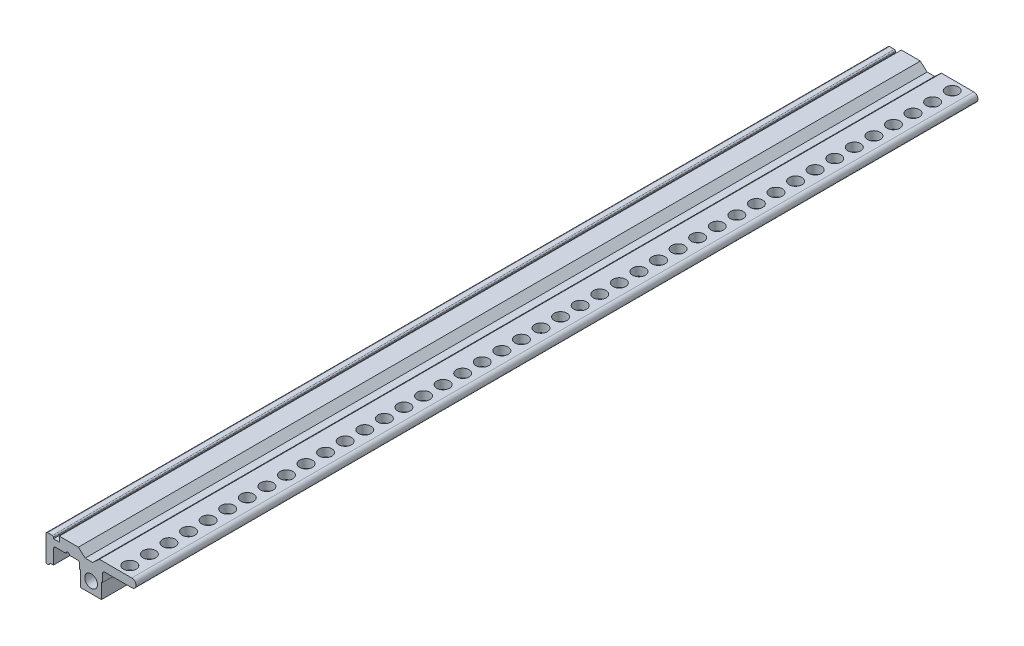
ISO-10303-21;
HEADER;
FILE_DESCRIPTION(('STEP AP214'),'2;1');
FILE_NAME('part.step','',(''),(''),'','','');
FILE_SCHEMA(('AUTOMOTIVE_DESIGN { 1 0 10303 214 1 1 1 1 }'));
ENDSEC;
DATA;
#1=APPLICATION_CONTEXT('core data for automotive mechanical design processes');
#2=APPLICATION_PROTOCOL_DEFINITION('international standard','automotive_design',2000,#1);
#3=PRODUCT_CONTEXT('',#1,'mechanical');
#4=PRODUCT('Part','Part','',(#3));
#5=PRODUCT_RELATED_PRODUCT_CATEGORY('part','',(#4));
#6=PRODUCT_DEFINITION_FORMATION('','',#4);
#7=PRODUCT_DEFINITION_CONTEXT('part definition',#1,'design');
#8=PRODUCT_DEFINITION('design','',#6,#7);
#9=PRODUCT_DEFINITION_SHAPE('','',#8);
#10=(LENGTH_UNIT() NAMED_UNIT(*) SI_UNIT(.MILLI.,.METRE.));
#11=(NAMED_UNIT(*) PLANE_ANGLE_UNIT() SI_UNIT($,.RADIAN.));
#12=(NAMED_UNIT(*) SI_UNIT($,.STERADIAN.) SOLID_ANGLE_UNIT());
#13=UNCERTAINTY_MEASURE_WITH_UNIT(LENGTH_MEASURE(1.E-05),#10,'distance_accuracy_value','');
#14=(GEOMETRIC_REPRESENTATION_CONTEXT(3) GLOBAL_UNCERTAINTY_ASSIGNED_CONTEXT((#13)) GLOBAL_UNIT_ASSIGNED_CONTEXT((#10,
#11,#12)) REPRESENTATION_CONTEXT('',''));
#15=CARTESIAN_POINT('',(0.,0.,0.));
#16=DIRECTION('',(0.,0.,1.));
#17=DIRECTION('',(1.,0.,0.));
#18=AXIS2_PLACEMENT_3D('',#15,#16,#17);
#19=CARTESIAN_POINT('',(2404.73191425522,-3176.7707893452,109.22));
#20=DIRECTION('',(1.,0.,0.));
#21=DIRECTION('',(0.,0.,-1.));
#22=AXIS2_PLACEMENT_3D('',#19,#20,#21);
#23=PLANE('',#22);
#24=DIRECTION('',(0.,-1.,0.));
#25=VECTOR('',#24,1.);
#26=CARTESIAN_POINT('',(2404.73191425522,-3176.7707893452,-109.22));
#27=LINE('',#26,#25);
#28=CARTESIAN_POINT('',(2404.73191425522,-3176.7707893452,-109.22));
#29=VERTEX_POINT('',#28);
#30=CARTESIAN_POINT('',(2404.73191425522,-3183.1707893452,-109.22));
#31=VERTEX_POINT('',#30);
#32=EDGE_CURVE('E312',#29,#31,#27,.T.);
#33=ORIENTED_EDGE('',*,*,#32,.T.);
#34=DIRECTION('',(0.,0.,-1.));
#35=VECTOR('',#34,1.);
#36=CARTESIAN_POINT('',(2404.73191425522,-3183.1707893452,109.22));
#37=LINE('',#36,#35);
#38=CARTESIAN_POINT('',(2404.73191425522,-3183.1707893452,109.22));
#39=VERTEX_POINT('',#38);
#40=EDGE_CURVE('E403',#39,#31,#37,.T.);
#41=ORIENTED_EDGE('',*,*,#40,.F.);
#42=DIRECTION('',(0.,-1.,0.));
#43=VECTOR('',#42,1.);
#44=CARTESIAN_POINT('',(2404.73191425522,-3176.7707893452,109.22));
#45=LINE('',#44,#43);
#46=CARTESIAN_POINT('',(2404.73191425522,-3176.7707893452,109.22));
#47=VERTEX_POINT('',#46);
#48=EDGE_CURVE('E987',#47,#39,#45,.T.);
#49=ORIENTED_EDGE('',*,*,#48,.F.);
#50=DIRECTION('',(0.,0.,-1.));
#51=VECTOR('',#50,1.);
#52=CARTESIAN_POINT('',(2404.73191425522,-3176.7707893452,109.22));
#53=LINE('',#52,#51);
#54=EDGE_CURVE('E406',#47,#29,#53,.T.);
#55=ORIENTED_EDGE('',*,*,#54,.T.);
#56=EDGE_LOOP('',(#33,#41,#49,#55));
#57=FACE_BOUND('',#56,.T.);
#58=CARTESIAN_POINT('',(2404.73191425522,-3180.8707893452,-99.06));
#59=DIRECTION('',(-1.,0.,0.));
#60=DIRECTION('',(0.,0.,1.));
#61=AXIS2_PLACEMENT_3D('',#58,#59,#60);
#62=CIRCLE('',#61,0.999999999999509);
#63=CARTESIAN_POINT('',(2404.73191425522,-3180.8707893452,-98.0600000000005));
#64=VERTEX_POINT('',#63);
#65=EDGE_CURVE('E622',#64,#64,#62,.T.);
#66=ORIENTED_EDGE('',*,*,#65,.F.);
#67=EDGE_LOOP('',(#66));
#68=FACE_BOUND('',#67,.T.);
#69=CARTESIAN_POINT('',(2404.73191425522,-3180.8707893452,-93.98));
#70=DIRECTION('',(-1.,0.,0.));
#71=DIRECTION('',(0.,0.,1.));
#72=AXIS2_PLACEMENT_3D('',#69,#70,#71);
#73=CIRCLE('',#72,0.999999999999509);
#74=CARTESIAN_POINT('',(2404.73191425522,-3180.8707893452,-92.9800000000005));
#75=VERTEX_POINT('',#74);
#76=EDGE_CURVE('E626',#75,#75,#73,.T.);
#77=ORIENTED_EDGE('',*,*,#76,.F.);
#78=EDGE_LOOP('',(#77));
#79=FACE_BOUND('',#78,.T.);
#80=CARTESIAN_POINT('',(2404.73191425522,-3180.8707893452,-88.9));
#81=DIRECTION('',(-1.,0.,0.));
#82=DIRECTION('',(0.,0.,1.));
#83=AXIS2_PLACEMENT_3D('',#80,#81,#82);
#84=CIRCLE('',#83,0.999999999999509);
#85=CARTESIAN_POINT('',(2404.73191425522,-3180.8707893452,-87.9000000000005));
#86=VERTEX_POINT('',#85);
#87=EDGE_CURVE('E630',#86,#86,#84,.T.);
#88=ORIENTED_EDGE('',*,*,#87,.F.);
#89=EDGE_LOOP('',(#88));
#90=FACE_BOUND('',#89,.T.);
#91=CARTESIAN_POINT('',(2404.73191425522,-3180.8707893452,-83.82));
#92=DIRECTION('',(-1.,0.,0.));
#93=DIRECTION('',(0.,0.,1.));
#94=AXIS2_PLACEMENT_3D('',#91,#92,#93);
#95=CIRCLE('',#94,0.999999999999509);
#96=CARTESIAN_POINT('',(2404.73191425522,-3180.8707893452,-82.8200000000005));
#97=VERTEX_POINT('',#96);
#98=EDGE_CURVE('E634',#97,#97,#95,.T.);
#99=ORIENTED_EDGE('',*,*,#98,.F.);
#100=EDGE_LOOP('',(#99));
#101=FACE_BOUND('',#100,.T.);
#102=CARTESIAN_POINT('',(2404.73191425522,-3180.8707893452,-78.74));
#103=DIRECTION('',(-1.,0.,0.));
#104=DIRECTION('',(0.,0.,1.));
#105=AXIS2_PLACEMENT_3D('',#102,#103,#104);
#106=CIRCLE('',#105,0.999999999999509);
#107=CARTESIAN_POINT('',(2404.73191425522,-3180.8707893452,-77.7400000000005));
#108=VERTEX_POINT('',#107);
#109=EDGE_CURVE('E638',#108,#108,#106,.T.);
#110=ORIENTED_EDGE('',*,*,#109,.F.);
#111=EDGE_LOOP('',(#110));
#112=FACE_BOUND('',#111,.T.);
#113=CARTESIAN_POINT('',(2404.73191425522,-3180.8707893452,-73.66));
#114=DIRECTION('',(-1.,0.,0.));
#115=DIRECTION('',(0.,0.,1.));
#116=AXIS2_PLACEMENT_3D('',#113,#114,#115);
#117=CIRCLE('',#116,0.999999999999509);
#118=CARTESIAN_POINT('',(2404.73191425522,-3180.8707893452,-72.6600000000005));
#119=VERTEX_POINT('',#118);
#120=EDGE_CURVE('E642',#119,#119,#117,.T.);
#121=ORIENTED_EDGE('',*,*,#120,.F.);
#122=EDGE_LOOP('',(#121));
#123=FACE_BOUND('',#122,.T.);
#124=CARTESIAN_POINT('',(2404.73191425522,-3180.8707893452,-68.58));
#125=DIRECTION('',(-1.,0.,0.));
#126=DIRECTION('',(0.,0.,1.));
#127=AXIS2_PLACEMENT_3D('',#124,#125,#126);
#128=CIRCLE('',#127,0.999999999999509);
#129=CARTESIAN_POINT('',(2404.73191425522,-3180.8707893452,-67.5800000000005));
#130=VERTEX_POINT('',#129);
#131=EDGE_CURVE('E646',#130,#130,#128,.T.);
#132=ORIENTED_EDGE('',*,*,#131,.F.);
#133=EDGE_LOOP('',(#132));
#134=FACE_BOUND('',#133,.T.);
#135=CARTESIAN_POINT('',(2404.73191425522,-3180.8707893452,-63.5));
#136=DIRECTION('',(-1.,0.,0.));
#137=DIRECTION('',(0.,0.,1.));
#138=AXIS2_PLACEMENT_3D('',#135,#136,#137);
#139=CIRCLE('',#138,0.999999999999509);
#140=CARTESIAN_POINT('',(2404.73191425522,-3180.8707893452,-62.5000000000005));
#141=VERTEX_POINT('',#140);
#142=EDGE_CURVE('E650',#141,#141,#139,.T.);
#143=ORIENTED_EDGE('',*,*,#142,.F.);
#144=EDGE_LOOP('',(#143));
#145=FACE_BOUND('',#144,.T.);
#146=CARTESIAN_POINT('',(2404.73191425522,-3180.8707893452,-58.42));
#147=DIRECTION('',(-1.,0.,0.));
#148=DIRECTION('',(0.,0.,1.));
#149=AXIS2_PLACEMENT_3D('',#146,#147,#148);
#150=CIRCLE('',#149,0.999999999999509);
#151=CARTESIAN_POINT('',(2404.73191425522,-3180.8707893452,-57.4200000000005));
#152=VERTEX_POINT('',#151);
#153=EDGE_CURVE('E654',#152,#152,#150,.T.);
#154=ORIENTED_EDGE('',*,*,#153,.F.);
#155=EDGE_LOOP('',(#154));
#156=FACE_BOUND('',#155,.T.);
#157=CARTESIAN_POINT('',(2404.73191425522,-3180.8707893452,-53.34));
#158=DIRECTION('',(-1.,0.,0.));
#159=DIRECTION('',(0.,0.,1.));
#160=AXIS2_PLACEMENT_3D('',#157,#158,#159);
#161=CIRCLE('',#160,0.999999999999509);
#162=CARTESIAN_POINT('',(2404.73191425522,-3180.8707893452,-52.3400000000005));
#163=VERTEX_POINT('',#162);
#164=EDGE_CURVE('E658',#163,#163,#161,.T.);
#165=ORIENTED_EDGE('',*,*,#164,.F.);
#166=EDGE_LOOP('',(#165));
#167=FACE_BOUND('',#166,.T.);
#168=CARTESIAN_POINT('',(2404.73191425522,-3180.8707893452,-48.26));
#169=DIRECTION('',(-1.,0.,0.));
#170=DIRECTION('',(0.,0.,1.));
#171=AXIS2_PLACEMENT_3D('',#168,#169,#170);
#172=CIRCLE('',#171,0.999999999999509);
#173=CARTESIAN_POINT('',(2404.73191425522,-3180.8707893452,-47.2600000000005));
#174=VERTEX_POINT('',#173);
#175=EDGE_CURVE('E662',#174,#174,#172,.T.);
#176=ORIENTED_EDGE('',*,*,#175,.F.);
#177=EDGE_LOOP('',(#176));
#178=FACE_BOUND('',#177,.T.);
#179=CARTESIAN_POINT('',(2404.73191425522,-3180.8707893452,-43.18));
#180=DIRECTION('',(-1.,0.,0.));
#181=DIRECTION('',(0.,0.,1.));
#182=AXIS2_PLACEMENT_3D('',#179,#180,#181);
#183=CIRCLE('',#182,0.999999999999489);
#184=CARTESIAN_POINT('',(2404.73191425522,-3180.8707893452,-42.1800000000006));
#185=VERTEX_POINT('',#184);
#186=EDGE_CURVE('E666',#185,#185,#183,.T.);
#187=ORIENTED_EDGE('',*,*,#186,.F.);
#188=EDGE_LOOP('',(#187));
#189=FACE_BOUND('',#188,.T.);
#190=CARTESIAN_POINT('',(2404.73191425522,-3180.8707893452,-38.1000000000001));
#191=DIRECTION('',(-1.,0.,0.));
#192=DIRECTION('',(0.,0.,1.));
#193=AXIS2_PLACEMENT_3D('',#190,#191,#192);
#194=CIRCLE('',#193,0.999999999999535);
#195=CARTESIAN_POINT('',(2404.73191425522,-3180.8707893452,-37.1000000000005));
#196=VERTEX_POINT('',#195);
#197=EDGE_CURVE('E670',#196,#196,#194,.T.);
#198=ORIENTED_EDGE('',*,*,#197,.F.);
#199=EDGE_LOOP('',(#198));
#200=FACE_BOUND('',#199,.T.);
#201=CARTESIAN_POINT('',(2404.73191425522,-3180.8707893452,-33.0200000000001));
#202=DIRECTION('',(-1.,0.,0.));
#203=DIRECTION('',(0.,0.,1.));
#204=AXIS2_PLACEMENT_3D('',#201,#202,#203);
#205=CIRCLE('',#204,0.999999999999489);
#206=CARTESIAN_POINT('',(2404.73191425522,-3180.8707893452,-32.0200000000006));
#207=VERTEX_POINT('',#206);
#208=EDGE_CURVE('E674',#207,#207,#205,.T.);
#209=ORIENTED_EDGE('',*,*,#208,.F.);
#210=EDGE_LOOP('',(#209));
#211=FACE_BOUND('',#210,.T.);
#212=CARTESIAN_POINT('',(2404.73191425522,-3180.8707893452,-27.9400000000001));
#213=DIRECTION('',(-1.,0.,0.));
#214=DIRECTION('',(0.,0.,1.));
#215=AXIS2_PLACEMENT_3D('',#212,#213,#214);
#216=CIRCLE('',#215,0.999999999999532);
#217=CARTESIAN_POINT('',(2404.73191425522,-3180.8707893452,-26.9400000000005));
#218=VERTEX_POINT('',#217);
#219=EDGE_CURVE('E678',#218,#218,#216,.T.);
#220=ORIENTED_EDGE('',*,*,#219,.F.);
#221=EDGE_LOOP('',(#220));
#222=FACE_BOUND('',#221,.T.);
#223=CARTESIAN_POINT('',(2404.73191425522,-3180.8707893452,-22.8600000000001));
#224=DIRECTION('',(-1.,0.,0.));
#225=DIRECTION('',(0.,0.,1.));
#226=AXIS2_PLACEMENT_3D('',#223,#224,#225);
#227=CIRCLE('',#226,0.999999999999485);
#228=CARTESIAN_POINT('',(2404.73191425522,-3180.8707893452,-21.8600000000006));
#229=VERTEX_POINT('',#228);
#230=EDGE_CURVE('E682',#229,#229,#227,.T.);
#231=ORIENTED_EDGE('',*,*,#230,.F.);
#232=EDGE_LOOP('',(#231));
#233=FACE_BOUND('',#232,.T.);
#234=CARTESIAN_POINT('',(2404.73191425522,-3180.8707893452,-17.7800000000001));
#235=DIRECTION('',(-1.,0.,0.));
#236=DIRECTION('',(0.,0.,1.));
#237=AXIS2_PLACEMENT_3D('',#234,#235,#236);
#238=CIRCLE('',#237,0.999999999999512);
#239=CARTESIAN_POINT('',(2404.73191425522,-3180.8707893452,-16.7800000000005));
#240=VERTEX_POINT('',#239);
#241=EDGE_CURVE('E686',#240,#240,#238,.T.);
#242=ORIENTED_EDGE('',*,*,#241,.F.);
#243=EDGE_LOOP('',(#242));
#244=FACE_BOUND('',#243,.T.);
#245=CARTESIAN_POINT('',(2404.73191425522,-3180.8707893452,-12.7000000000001));
#246=DIRECTION('',(-1.,0.,0.));
#247=DIRECTION('',(0.,0.,1.));
#248=AXIS2_PLACEMENT_3D('',#245,#246,#247);
#249=CIRCLE('',#248,0.99999999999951);
#250=CARTESIAN_POINT('',(2404.73191425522,-3180.8707893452,-11.7000000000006));
#251=VERTEX_POINT('',#250);
#252=EDGE_CURVE('E690',#251,#251,#249,.T.);
#253=ORIENTED_EDGE('',*,*,#252,.F.);
#254=EDGE_LOOP('',(#253));
#255=FACE_BOUND('',#254,.T.);
#256=CARTESIAN_POINT('',(2404.73191425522,-3180.8707893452,-7.62000000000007));
#257=DIRECTION('',(-1.,0.,0.));
#258=DIRECTION('',(0.,0.,1.));
#259=AXIS2_PLACEMENT_3D('',#256,#257,#258);
#260=CIRCLE('',#259,0.99999999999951);
#261=CARTESIAN_POINT('',(2404.73191425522,-3180.8707893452,-6.62000000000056));
#262=VERTEX_POINT('',#261);
#263=EDGE_CURVE('E694',#262,#262,#260,.T.);
#264=ORIENTED_EDGE('',*,*,#263,.F.);
#265=EDGE_LOOP('',(#264));
#266=FACE_BOUND('',#265,.T.);
#267=CARTESIAN_POINT('',(2404.73191425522,-3180.8707893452,-2.54000000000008));
#268=DIRECTION('',(-1.,0.,0.));
#269=DIRECTION('',(0.,0.,1.));
#270=AXIS2_PLACEMENT_3D('',#267,#268,#269);
#271=CIRCLE('',#270,0.99999999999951);
#272=CARTESIAN_POINT('',(2404.73191425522,-3180.8707893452,-1.54000000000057));
#273=VERTEX_POINT('',#272);
#274=EDGE_CURVE('E698',#273,#273,#271,.T.);
#275=ORIENTED_EDGE('',*,*,#274,.F.);
#276=EDGE_LOOP('',(#275));
#277=FACE_BOUND('',#276,.T.);
#278=CARTESIAN_POINT('',(2404.73191425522,-3180.8707893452,2.53999999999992));
#279=DIRECTION('',(-1.,0.,0.));
#280=DIRECTION('',(0.,0.,1.));
#281=AXIS2_PLACEMENT_3D('',#278,#279,#280);
#282=CIRCLE('',#281,0.99999999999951);
#283=CARTESIAN_POINT('',(2404.73191425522,-3180.8707893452,3.53999999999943));
#284=VERTEX_POINT('',#283);
#285=EDGE_CURVE('E702',#284,#284,#282,.T.);
#286=ORIENTED_EDGE('',*,*,#285,.F.);
#287=EDGE_LOOP('',(#286));
#288=FACE_BOUND('',#287,.T.);
#289=CARTESIAN_POINT('',(2404.73191425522,-3180.8707893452,7.61999999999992));
#290=DIRECTION('',(-1.,0.,0.));
#291=DIRECTION('',(0.,0.,1.));
#292=AXIS2_PLACEMENT_3D('',#289,#290,#291);
#293=CIRCLE('',#292,0.99999999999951);
#294=CARTESIAN_POINT('',(2404.73191425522,-3180.8707893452,8.61999999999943));
#295=VERTEX_POINT('',#294);
#296=EDGE_CURVE('E706',#295,#295,#293,.T.);
#297=ORIENTED_EDGE('',*,*,#296,.F.);
#298=EDGE_LOOP('',(#297));
#299=FACE_BOUND('',#298,.T.);
#300=CARTESIAN_POINT('',(2404.73191425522,-3180.8707893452,12.6999999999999));
#301=DIRECTION('',(-1.,0.,0.));
#302=DIRECTION('',(0.,0.,1.));
#303=AXIS2_PLACEMENT_3D('',#300,#301,#302);
#304=CIRCLE('',#303,0.99999999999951);
#305=CARTESIAN_POINT('',(2404.73191425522,-3180.8707893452,13.6999999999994));
#306=VERTEX_POINT('',#305);
#307=EDGE_CURVE('E710',#306,#306,#304,.T.);
#308=ORIENTED_EDGE('',*,*,#307,.F.);
#309=EDGE_LOOP('',(#308));
#310=FACE_BOUND('',#309,.T.);
#311=CARTESIAN_POINT('',(2404.73191425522,-3180.8707893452,17.7799999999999));
#312=DIRECTION('',(-1.,0.,0.));
#313=DIRECTION('',(0.,0.,1.));
#314=AXIS2_PLACEMENT_3D('',#311,#312,#313);
#315=CIRCLE('',#314,0.999999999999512);
#316=CARTESIAN_POINT('',(2404.73191425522,-3180.8707893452,18.7799999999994));
#317=VERTEX_POINT('',#316);
#318=EDGE_CURVE('E714',#317,#317,#315,.T.);
#319=ORIENTED_EDGE('',*,*,#318,.F.);
#320=EDGE_LOOP('',(#319));
#321=FACE_BOUND('',#320,.T.);
#322=CARTESIAN_POINT('',(2404.73191425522,-3180.8707893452,22.8599999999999));
#323=DIRECTION('',(-1.,0.,0.));
#324=DIRECTION('',(0.,0.,1.));
#325=AXIS2_PLACEMENT_3D('',#322,#323,#324);
#326=CIRCLE('',#325,0.999999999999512);
#327=CARTESIAN_POINT('',(2404.73191425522,-3180.8707893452,23.8599999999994));
#328=VERTEX_POINT('',#327);
#329=EDGE_CURVE('E718',#328,#328,#326,.T.);
#330=ORIENTED_EDGE('',*,*,#329,.F.);
#331=EDGE_LOOP('',(#330));
#332=FACE_BOUND('',#331,.T.);
#333=CARTESIAN_POINT('',(2404.73191425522,-3180.8707893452,27.9399999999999));
#334=DIRECTION('',(-1.,0.,0.));
#335=DIRECTION('',(0.,0.,1.));
#336=AXIS2_PLACEMENT_3D('',#333,#334,#335);
#337=CIRCLE('',#336,0.999999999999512);
#338=CARTESIAN_POINT('',(2404.73191425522,-3180.8707893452,28.9399999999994));
#339=VERTEX_POINT('',#338);
#340=EDGE_CURVE('E722',#339,#339,#337,.T.);
#341=ORIENTED_EDGE('',*,*,#340,.F.);
#342=EDGE_LOOP('',(#341));
#343=FACE_BOUND('',#342,.T.);
#344=CARTESIAN_POINT('',(2404.73191425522,-3180.8707893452,33.0199999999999));
#345=DIRECTION('',(-1.,0.,0.));
#346=DIRECTION('',(0.,0.,1.));
#347=AXIS2_PLACEMENT_3D('',#344,#345,#346);
#348=CIRCLE('',#347,0.999999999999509);
#349=CARTESIAN_POINT('',(2404.73191425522,-3180.8707893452,34.0199999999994));
#350=VERTEX_POINT('',#349);
#351=EDGE_CURVE('E726',#350,#350,#348,.T.);
#352=ORIENTED_EDGE('',*,*,#351,.F.);
#353=EDGE_LOOP('',(#352));
#354=FACE_BOUND('',#353,.T.);
#355=CARTESIAN_POINT('',(2404.73191425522,-3180.8707893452,38.0999999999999));
#356=DIRECTION('',(-1.,0.,0.));
#357=DIRECTION('',(0.,0.,1.));
#358=AXIS2_PLACEMENT_3D('',#355,#356,#357);
#359=CIRCLE('',#358,0.999999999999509);
#360=CARTESIAN_POINT('',(2404.73191425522,-3180.8707893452,39.0999999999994));
#361=VERTEX_POINT('',#360);
#362=EDGE_CURVE('E730',#361,#361,#359,.T.);
#363=ORIENTED_EDGE('',*,*,#362,.F.);
#364=EDGE_LOOP('',(#363));
#365=FACE_BOUND('',#364,.T.);
#366=CARTESIAN_POINT('',(2404.73191425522,-3180.8707893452,43.1799999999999));
#367=DIRECTION('',(-1.,0.,0.));
#368=DIRECTION('',(0.,0.,1.));
#369=AXIS2_PLACEMENT_3D('',#366,#367,#368);
#370=CIRCLE('',#369,0.999999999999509);
#371=CARTESIAN_POINT('',(2404.73191425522,-3180.8707893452,44.1799999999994));
#372=VERTEX_POINT('',#371);
#373=EDGE_CURVE('E734',#372,#372,#370,.T.);
#374=ORIENTED_EDGE('',*,*,#373,.F.);
#375=EDGE_LOOP('',(#374));
#376=FACE_BOUND('',#375,.T.);
#377=CARTESIAN_POINT('',(2404.73191425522,-3180.8707893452,48.2599999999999));
#378=DIRECTION('',(-1.,0.,0.));
#379=DIRECTION('',(0.,0.,1.));
#380=AXIS2_PLACEMENT_3D('',#377,#378,#379);
#381=CIRCLE('',#380,0.999999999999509);
#382=CARTESIAN_POINT('',(2404.73191425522,-3180.8707893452,49.2599999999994));
#383=VERTEX_POINT('',#382);
#384=EDGE_CURVE('E738',#383,#383,#381,.T.);
#385=ORIENTED_EDGE('',*,*,#384,.F.);
#386=EDGE_LOOP('',(#385));
#387=FACE_BOUND('',#386,.T.);
#388=CARTESIAN_POINT('',(2404.73191425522,-3180.8707893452,53.3399999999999));
#389=DIRECTION('',(-1.,0.,0.));
#390=DIRECTION('',(0.,0.,1.));
#391=AXIS2_PLACEMENT_3D('',#388,#389,#390);
#392=CIRCLE('',#391,0.999999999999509);
#393=CARTESIAN_POINT('',(2404.73191425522,-3180.8707893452,54.3399999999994));
#394=VERTEX_POINT('',#393);
#395=EDGE_CURVE('E742',#394,#394,#392,.T.);
#396=ORIENTED_EDGE('',*,*,#395,.F.);
#397=EDGE_LOOP('',(#396));
#398=FACE_BOUND('',#397,.T.);
#399=CARTESIAN_POINT('',(2404.73191425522,-3180.8707893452,58.4199999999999));
#400=DIRECTION('',(-1.,0.,0.));
#401=DIRECTION('',(0.,0.,1.));
#402=AXIS2_PLACEMENT_3D('',#399,#400,#401);
#403=CIRCLE('',#402,0.999999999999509);
#404=CARTESIAN_POINT('',(2404.73191425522,-3180.8707893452,59.4199999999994));
#405=VERTEX_POINT('',#404);
#406=EDGE_CURVE('E746',#405,#405,#403,.T.);
#407=ORIENTED_EDGE('',*,*,#406,.F.);
#408=EDGE_LOOP('',(#407));
#409=FACE_BOUND('',#408,.T.);
#410=CARTESIAN_POINT('',(2404.73191425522,-3180.8707893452,63.4999999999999));
#411=DIRECTION('',(-1.,0.,0.));
#412=DIRECTION('',(0.,0.,1.));
#413=AXIS2_PLACEMENT_3D('',#410,#411,#412);
#414=CIRCLE('',#413,0.999999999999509);
#415=CARTESIAN_POINT('',(2404.73191425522,-3180.8707893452,64.4999999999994));
#416=VERTEX_POINT('',#415);
#417=EDGE_CURVE('E750',#416,#416,#414,.T.);
#418=ORIENTED_EDGE('',*,*,#417,.F.);
#419=EDGE_LOOP('',(#418));
#420=FACE_BOUND('',#419,.T.);
#421=CARTESIAN_POINT('',(2404.73191425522,-3180.8707893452,68.5799999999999));
#422=DIRECTION('',(-1.,0.,0.));
#423=DIRECTION('',(0.,0.,1.));
#424=AXIS2_PLACEMENT_3D('',#421,#422,#423);
#425=CIRCLE('',#424,0.999999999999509);
#426=CARTESIAN_POINT('',(2404.73191425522,-3180.8707893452,69.5799999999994));
#427=VERTEX_POINT('',#426);
#428=EDGE_CURVE('E754',#427,#427,#425,.T.);
#429=ORIENTED_EDGE('',*,*,#428,.F.);
#430=EDGE_LOOP('',(#429));
#431=FACE_BOUND('',#430,.T.);
#432=CARTESIAN_POINT('',(2404.73191425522,-3180.8707893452,73.6599999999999));
#433=DIRECTION('',(-1.,0.,0.));
#434=DIRECTION('',(0.,0.,1.));
#435=AXIS2_PLACEMENT_3D('',#432,#433,#434);
#436=CIRCLE('',#435,0.999999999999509);
#437=CARTESIAN_POINT('',(2404.73191425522,-3180.8707893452,74.6599999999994));
#438=VERTEX_POINT('',#437);
#439=EDGE_CURVE('E758',#438,#438,#436,.T.);
#440=ORIENTED_EDGE('',*,*,#439,.F.);
#441=EDGE_LOOP('',(#440));
#442=FACE_BOUND('',#441,.T.);
#443=CARTESIAN_POINT('',(2404.73191425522,-3180.8707893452,78.7399999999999));
#444=DIRECTION('',(-1.,0.,0.));
#445=DIRECTION('',(0.,0.,1.));
#446=AXIS2_PLACEMENT_3D('',#443,#444,#445);
#447=CIRCLE('',#446,0.999999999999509);
#448=CARTESIAN_POINT('',(2404.73191425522,-3180.8707893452,79.7399999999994));
#449=VERTEX_POINT('',#448);
#450=EDGE_CURVE('E762',#449,#449,#447,.T.);
#451=ORIENTED_EDGE('',*,*,#450,.F.);
#452=EDGE_LOOP('',(#451));
#453=FACE_BOUND('',#452,.T.);
#454=CARTESIAN_POINT('',(2404.73191425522,-3180.8707893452,83.8199999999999));
#455=DIRECTION('',(-1.,0.,0.));
#456=DIRECTION('',(0.,0.,1.));
#457=AXIS2_PLACEMENT_3D('',#454,#455,#456);
#458=CIRCLE('',#457,0.999999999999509);
#459=CARTESIAN_POINT('',(2404.73191425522,-3180.8707893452,84.8199999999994));
#460=VERTEX_POINT('',#459);
#461=EDGE_CURVE('E766',#460,#460,#458,.T.);
#462=ORIENTED_EDGE('',*,*,#461,.F.);
#463=EDGE_LOOP('',(#462));
#464=FACE_BOUND('',#463,.T.);
#465=CARTESIAN_POINT('',(2404.73191425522,-3180.8707893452,88.8999999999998));
#466=DIRECTION('',(-1.,0.,0.));
#467=DIRECTION('',(0.,0.,1.));
#468=AXIS2_PLACEMENT_3D('',#465,#466,#467);
#469=CIRCLE('',#468,0.999999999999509);
#470=CARTESIAN_POINT('',(2404.73191425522,-3180.8707893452,89.8999999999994));
#471=VERTEX_POINT('',#470);
#472=EDGE_CURVE('E770',#471,#471,#469,.T.);
#473=ORIENTED_EDGE('',*,*,#472,.F.);
#474=EDGE_LOOP('',(#473));
#475=FACE_BOUND('',#474,.T.);
#476=CARTESIAN_POINT('',(2404.73191425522,-3180.8707893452,93.9799999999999));
#477=DIRECTION('',(-1.,0.,0.));
#478=DIRECTION('',(0.,0.,1.));
#479=AXIS2_PLACEMENT_3D('',#476,#477,#478);
#480=CIRCLE('',#479,0.999999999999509);
#481=CARTESIAN_POINT('',(2404.73191425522,-3180.8707893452,94.9799999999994));
#482=VERTEX_POINT('',#481);
#483=EDGE_CURVE('E774',#482,#482,#480,.T.);
#484=ORIENTED_EDGE('',*,*,#483,.F.);
#485=EDGE_LOOP('',(#484));
#486=FACE_BOUND('',#485,.T.);
#487=CARTESIAN_POINT('',(2404.73191425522,-3180.8707893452,99.0599999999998));
#488=DIRECTION('',(-1.,0.,0.));
#489=DIRECTION('',(0.,0.,1.));
#490=AXIS2_PLACEMENT_3D('',#487,#488,#489);
#491=CIRCLE('',#490,0.999999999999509);
#492=CARTESIAN_POINT('',(2404.73191425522,-3180.8707893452,100.059999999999));
#493=VERTEX_POINT('',#492);
#494=EDGE_CURVE('E777',#493,#493,#491,.T.);
#495=ORIENTED_EDGE('',*,*,#494,.F.);
#496=EDGE_LOOP('',(#495));
#497=FACE_BOUND('',#496,.T.);
#498=CARTESIAN_POINT('',(2404.73191425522,-3180.8707893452,104.14));
#499=DIRECTION('',(-1.,0.,0.));
#500=DIRECTION('',(0.,0.,1.));
#501=AXIS2_PLACEMENT_3D('',#498,#499,#500);
#502=CIRCLE('',#501,0.999999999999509);
#503=CARTESIAN_POINT('',(2404.73191425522,-3180.8707893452,105.139999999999));
#504=VERTEX_POINT('',#503);
#505=EDGE_CURVE('E780',#504,#504,#502,.T.);
#506=ORIENTED_EDGE('',*,*,#505,.F.);
#507=EDGE_LOOP('',(#506));
#508=FACE_BOUND('',#507,.T.);
#509=CARTESIAN_POINT('',(2404.73191425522,-3180.8707893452,-104.14));
#510=DIRECTION('',(-1.,0.,0.));
#511=DIRECTION('',(0.,0.,1.));
#512=AXIS2_PLACEMENT_3D('',#509,#510,#511);
#513=CIRCLE('',#512,1.02499999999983);
#514=CARTESIAN_POINT('',(2404.73191425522,-3180.8707893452,-103.115));
#515=VERTEX_POINT('',#514);
#516=EDGE_CURVE('E790',#515,#515,#513,.T.);
#517=ORIENTED_EDGE('',*,*,#516,.F.);
#518=EDGE_LOOP('',(#517));
#519=FACE_BOUND('',#518,.T.);
#520=ADVANCED_FACE('F37',(#57,#68,#79,#90,#101,#112,#123,#134,#145,#156,#167,#178,#189,#200,
#211,#222,#233,#244,#255,#266,#277,#288,#299,#310,#321,#332,#343,#354,#365,#376,#387,#398,#409,
#420,#431,#442,#453,#464,#475,#486,#497,#508,#519),#23,.F.);
#521=CARTESIAN_POINT('',(2426.98191425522,-3176.7207893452,-109.22));
#522=DIRECTION('',(0.,0.,1.));
#523=DIRECTION('',(1.,0.,0.));
#524=AXIS2_PLACEMENT_3D('',#521,#522,#523);
#525=PLANE('',#524);
#526=CARTESIAN_POINT('',(2426.98191425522,-3176.7207893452,-109.22));
#527=DIRECTION('',(0.,0.,1.));
#528=DIRECTION('',(1.,0.,0.));
#529=AXIS2_PLACEMENT_3D('',#526,#527,#528);
#530=CIRCLE('',#529,1.09999999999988);
#531=CARTESIAN_POINT('',(2426.98191425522,-3177.8207893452,-109.22));
#532=VERTEX_POINT('',#531);
#533=CARTESIAN_POINT('',(2426.98191425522,-3175.6207893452,-109.22));
#534=VERTEX_POINT('',#533);
#535=EDGE_CURVE('E286',#532,#534,#530,.T.);
#536=ORIENTED_EDGE('',*,*,#535,.F.);
#537=DIRECTION('',(1.,0.,0.));
#538=VECTOR('',#537,1.);
#539=CARTESIAN_POINT('',(2419.93191425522,-3177.8207893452,-109.22));
#540=LINE('',#539,#538);
#541=CARTESIAN_POINT('',(2419.93191425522,-3177.8207893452,-109.22));
#542=VERTEX_POINT('',#541);
#543=EDGE_CURVE('E166',#542,#532,#540,.T.);
#544=ORIENTED_EDGE('',*,*,#543,.F.);
#545=CARTESIAN_POINT('',(2419.93191425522,-3178.3207893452,-109.22));
#546=DIRECTION('',(0.,0.,-1.));
#547=DIRECTION('',(1.,0.,0.));
#548=AXIS2_PLACEMENT_3D('',#545,#546,#547);
#549=CIRCLE('',#548,0.500000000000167);
#550=CARTESIAN_POINT('',(2419.43191425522,-3178.3207893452,-109.22));
#551=VERTEX_POINT('',#550);
#552=EDGE_CURVE('E160',#551,#542,#549,.T.);
#553=ORIENTED_EDGE('',*,*,#552,.F.);
#554=DIRECTION('',(0.,1.,0.));
#555=VECTOR('',#554,1.);
#556=CARTESIAN_POINT('',(2419.43191425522,-3180.4207893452,-109.22));
#557=LINE('',#556,#555);
#558=CARTESIAN_POINT('',(2419.43191425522,-3180.4207893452,-109.22));
#559=VERTEX_POINT('',#558);
#560=EDGE_CURVE('E276',#559,#551,#557,.T.);
#561=ORIENTED_EDGE('',*,*,#560,.F.);
#562=DIRECTION('',(1.,0.,0.));
#563=VECTOR('',#562,1.);
#564=CARTESIAN_POINT('',(2419.13191425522,-3180.4207893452,-109.22));
#565=LINE('',#564,#563);
#566=CARTESIAN_POINT('',(2419.13191425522,-3180.4207893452,-109.22));
#567=VERTEX_POINT('',#566);
#568=EDGE_CURVE('E346',#567,#559,#565,.T.);
#569=ORIENTED_EDGE('',*,*,#568,.F.);
#570=DIRECTION('',(0.,1.,0.));
#571=VECTOR('',#570,1.);
#572=CARTESIAN_POINT('',(2419.13191425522,-3184.4207893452,-109.22));
#573=LINE('',#572,#571);
#574=CARTESIAN_POINT('',(2419.13191425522,-3184.4207893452,-109.22));
#575=VERTEX_POINT('',#574);
#576=EDGE_CURVE('E344',#575,#567,#573,.T.);
#577=ORIENTED_EDGE('',*,*,#576,.F.);
#578=DIRECTION('',(1.,0.,0.));
#579=VECTOR('',#578,1.);
#580=CARTESIAN_POINT('',(2413.73191425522,-3184.4207893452,-109.22));
#581=LINE('',#580,#579);
#582=CARTESIAN_POINT('',(2413.73191425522,-3184.4207893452,-109.22));
#583=VERTEX_POINT('',#582);
#584=EDGE_CURVE('E342',#583,#575,#581,.T.);
#585=ORIENTED_EDGE('',*,*,#584,.F.);
#586=DIRECTION('',(0.,-1.,0.));
#587=VECTOR('',#586,1.);
#588=CARTESIAN_POINT('',(2413.73191425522,-3180.4207893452,-109.22));
#589=LINE('',#588,#587);
#590=CARTESIAN_POINT('',(2413.73191425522,-3180.4207893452,-109.22));
#591=VERTEX_POINT('',#590);
#592=EDGE_CURVE('E340',#591,#583,#589,.T.);
#593=ORIENTED_EDGE('',*,*,#592,.F.);
#594=DIRECTION('',(1.,0.,0.));
#595=VECTOR('',#594,1.);
#596=CARTESIAN_POINT('',(2413.43191425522,-3180.4207893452,-109.22));
#597=LINE('',#596,#595);
#598=CARTESIAN_POINT('',(2413.43191425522,-3180.4207893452,-109.22));
#599=VERTEX_POINT('',#598);
#600=EDGE_CURVE('E338',#599,#591,#597,.T.);
#601=ORIENTED_EDGE('',*,*,#600,.F.);
#602=DIRECTION('',(0.,-1.,0.));
#603=VECTOR('',#602,1.);
#604=CARTESIAN_POINT('',(2413.43191425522,-3179.1207893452,-109.22));
#605=LINE('',#604,#603);
#606=CARTESIAN_POINT('',(2413.43191425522,-3179.1207893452,-109.22));
#607=VERTEX_POINT('',#606);
#608=EDGE_CURVE('E336',#607,#599,#605,.T.);
#609=ORIENTED_EDGE('',*,*,#608,.F.);
#610=CARTESIAN_POINT('',(2412.93191425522,-3179.1207893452,-109.22));
#611=DIRECTION('',(0.,0.,-1.));
#612=DIRECTION('',(1.,0.,0.));
#613=AXIS2_PLACEMENT_3D('',#610,#611,#612);
#614=CIRCLE('',#613,0.499999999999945);
#615=CARTESIAN_POINT('',(2412.93191425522,-3178.6207893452,-109.22));
#616=VERTEX_POINT('',#615);
#617=EDGE_CURVE('E334',#616,#607,#614,.T.);
#618=ORIENTED_EDGE('',*,*,#617,.F.);
#619=DIRECTION('',(1.,0.,0.));
#620=VECTOR('',#619,1.);
#621=CARTESIAN_POINT('',(2410.83191425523,-3178.6207893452,-109.22));
#622=LINE('',#621,#620);
#623=CARTESIAN_POINT('',(2410.83191425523,-3178.6207893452,-109.22));
#624=VERTEX_POINT('',#623);
#625=EDGE_CURVE('E332',#624,#616,#622,.T.);
#626=ORIENTED_EDGE('',*,*,#625,.F.);
#627=CARTESIAN_POINT('',(2410.33191425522,-3178.6207893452,-109.22));
#628=DIRECTION('',(0.,0.,-1.));
#629=DIRECTION('',(1.,0.,0.));
#630=AXIS2_PLACEMENT_3D('',#627,#628,#629);
#631=CIRCLE('',#630,0.500000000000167);
#632=CARTESIAN_POINT('',(2409.83191425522,-3178.6207893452,-109.22));
#633=VERTEX_POINT('',#632);
#634=EDGE_CURVE('E330',#633,#624,#631,.T.);
#635=ORIENTED_EDGE('',*,*,#634,.F.);
#636=DIRECTION('',(1.,0.,0.));
#637=VECTOR('',#636,1.);
#638=CARTESIAN_POINT('',(2407.18191425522,-3178.6207893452,-109.22));
#639=LINE('',#638,#637);
#640=CARTESIAN_POINT('',(2407.18191425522,-3178.6207893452,-109.22));
#641=VERTEX_POINT('',#640);
#642=EDGE_CURVE('E328',#641,#633,#639,.T.);
#643=ORIENTED_EDGE('',*,*,#642,.F.);
#644=CARTESIAN_POINT('',(2407.18191425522,-3179.1207893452,-109.22));
#645=DIRECTION('',(0.,0.,-1.));
#646=DIRECTION('',(1.,0.,0.));
#647=AXIS2_PLACEMENT_3D('',#644,#645,#646);
#648=CIRCLE('',#647,0.499999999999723);
#649=CARTESIAN_POINT('',(2406.68191425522,-3179.1207893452,-109.22));
#650=VERTEX_POINT('',#649);
#651=EDGE_CURVE('E326',#650,#641,#648,.T.);
#652=ORIENTED_EDGE('',*,*,#651,.F.);
#653=DIRECTION('',(0.,1.,0.));
#654=VECTOR('',#653,1.);
#655=CARTESIAN_POINT('',(2406.68191425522,-3182.8707893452,-109.22));
#656=LINE('',#655,#654);
#657=CARTESIAN_POINT('',(2406.68191425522,-3182.8707893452,-109.22));
#658=VERTEX_POINT('',#657);
#659=EDGE_CURVE('E324',#658,#650,#656,.T.);
#660=ORIENTED_EDGE('',*,*,#659,.F.);
#661=DIRECTION('',(1.,0.,0.));
#662=VECTOR('',#661,1.);
#663=CARTESIAN_POINT('',(2406.27114473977,-3182.8707893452,-109.22));
#664=LINE('',#663,#662);
#665=CARTESIAN_POINT('',(2406.27114473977,-3182.8707893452,-109.22));
#666=VERTEX_POINT('',#665);
#667=EDGE_CURVE('E322',#666,#658,#664,.T.);
#668=ORIENTED_EDGE('',*,*,#667,.F.);
#669=CARTESIAN_POINT('',(2406.27114473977,-3183.77078934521,-109.22));
#670=DIRECTION('',(0.,0.,-1.));
#671=DIRECTION('',(1.,0.,0.));
#672=AXIS2_PLACEMENT_3D('',#669,#670,#671);
#673=CIRCLE('',#672,0.900000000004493);
#674=CARTESIAN_POINT('',(2405.49172187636,-3183.3207893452,-109.22));
#675=VERTEX_POINT('',#674);
#676=EDGE_CURVE('E320',#675,#666,#673,.T.);
#677=ORIENTED_EDGE('',*,*,#676,.F.);
#678=CARTESIAN_POINT('',(2405.23191425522,-3183.1707893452,-109.22));
#679=DIRECTION('',(0.,0.,1.));
#680=DIRECTION('',(1.,0.,0.));
#681=AXIS2_PLACEMENT_3D('',#678,#679,#680);
#682=CIRCLE('',#681,0.300000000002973);
#683=CARTESIAN_POINT('',(2405.23191425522,-3183.4707893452,-109.22));
#684=VERTEX_POINT('',#683);
#685=EDGE_CURVE('E318',#684,#675,#682,.T.);
#686=ORIENTED_EDGE('',*,*,#685,.F.);
#687=DIRECTION('',(1.,0.,0.));
#688=VECTOR('',#687,1.);
#689=CARTESIAN_POINT('',(2405.03191425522,-3183.4707893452,-109.22));
#690=LINE('',#689,#688);
#691=CARTESIAN_POINT('',(2405.03191425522,-3183.4707893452,-109.22));
#692=VERTEX_POINT('',#691);
#693=EDGE_CURVE('E316',#692,#684,#690,.T.);
#694=ORIENTED_EDGE('',*,*,#693,.F.);
#695=CARTESIAN_POINT('',(2405.03191425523,-3183.1707893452,-109.22));
#696=DIRECTION('',(0.,0.,1.));
#697=DIRECTION('',(1.,0.,0.));
#698=AXIS2_PLACEMENT_3D('',#695,#696,#697);
#699=CIRCLE('',#698,0.300000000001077);
#700=EDGE_CURVE('E314',#31,#692,#699,.T.);
#701=ORIENTED_EDGE('',*,*,#700,.F.);
#702=ORIENTED_EDGE('',*,*,#32,.F.);
#703=CARTESIAN_POINT('',(2405.13191425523,-3176.7707893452,-109.22));
#704=DIRECTION('',(0.,0.,1.));
#705=DIRECTION('',(1.,0.,0.));
#706=AXIS2_PLACEMENT_3D('',#703,#704,#705);
#707=CIRCLE('',#706,0.400000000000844);
#708=CARTESIAN_POINT('',(2405.13191425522,-3176.3707893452,-109.22));
#709=VERTEX_POINT('',#708);
#710=EDGE_CURVE('E310',#709,#29,#707,.T.);
#711=ORIENTED_EDGE('',*,*,#710,.F.);
#712=DIRECTION('',(-1.,-3.55271367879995E-13,0.));
#713=VECTOR('',#712,1.);
#714=CARTESIAN_POINT('',(2406.38191425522,-3176.3707893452,-109.22));
#715=LINE('',#714,#713);
#716=CARTESIAN_POINT('',(2406.38191425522,-3176.3707893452,-109.22));
#717=VERTEX_POINT('',#716);
#718=EDGE_CURVE('E308',#717,#709,#715,.T.);
#719=ORIENTED_EDGE('',*,*,#718,.F.);
#720=CARTESIAN_POINT('',(2406.38191425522,-3176.6707893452,-109.22));
#721=DIRECTION('',(0.,0.,1.));
#722=DIRECTION('',(1.,0.,0.));
#723=AXIS2_PLACEMENT_3D('',#720,#721,#722);
#724=CIRCLE('',#723,0.300000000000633);
#725=CARTESIAN_POINT('',(2406.68191425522,-3176.6707893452,-109.22));
#726=VERTEX_POINT('',#725);
#727=EDGE_CURVE('E306',#726,#717,#724,.T.);
#728=ORIENTED_EDGE('',*,*,#727,.F.);
#729=DIRECTION('',(0.,1.,0.));
#730=VECTOR('',#729,1.);
#731=CARTESIAN_POINT('',(2406.68191425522,-3176.9707893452,-109.22));
#732=LINE('',#731,#730);
#733=CARTESIAN_POINT('',(2406.68191425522,-3176.9707893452,-109.22));
#734=VERTEX_POINT('',#733);
#735=EDGE_CURVE('E304',#734,#726,#732,.T.);
#736=ORIENTED_EDGE('',*,*,#735,.F.);
#737=DIRECTION('',(-1.,0.,0.));
#738=VECTOR('',#737,1.);
#739=CARTESIAN_POINT('',(2408.18191425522,-3176.9707893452,-109.22));
#740=LINE('',#739,#738);
#741=CARTESIAN_POINT('',(2408.18191425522,-3176.9707893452,-109.22));
#742=VERTEX_POINT('',#741);
#743=EDGE_CURVE('E302',#742,#734,#740,.T.);
#744=ORIENTED_EDGE('',*,*,#743,.F.);
#745=DIRECTION('',(0.,-1.,0.));
#746=VECTOR('',#745,1.);
#747=CARTESIAN_POINT('',(2408.18191425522,-3175.6207893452,-109.22));
#748=LINE('',#747,#746);
#749=CARTESIAN_POINT('',(2408.18191425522,-3175.6207893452,-109.22));
#750=VERTEX_POINT('',#749);
#751=EDGE_CURVE('E300',#750,#742,#748,.T.);
#752=ORIENTED_EDGE('',*,*,#751,.F.);
#753=DIRECTION('',(-1.,0.,0.));
#754=VECTOR('',#753,1.);
#755=CARTESIAN_POINT('',(2413.13191425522,-3175.6207893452,-109.22));
#756=LINE('',#755,#754);
#757=CARTESIAN_POINT('',(2413.13191425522,-3175.6207893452,-109.22));
#758=VERTEX_POINT('',#757);
#759=EDGE_CURVE('E298',#758,#750,#756,.T.);
#760=ORIENTED_EDGE('',*,*,#759,.F.);
#761=DIRECTION('',(-0.738028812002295,0.674769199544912,0.));
#762=VECTOR('',#761,1.);
#763=CARTESIAN_POINT('',(2414.88191425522,-3177.2207893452,-109.22));
#764=LINE('',#763,#762);
#765=CARTESIAN_POINT('',(2414.88191425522,-3177.2207893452,-109.22));
#766=VERTEX_POINT('',#765);
#767=EDGE_CURVE('E296',#766,#758,#764,.T.);
#768=ORIENTED_EDGE('',*,*,#767,.F.);
#769=DIRECTION('',(-1.,0.,0.));
#770=VECTOR('',#769,1.);
#771=CARTESIAN_POINT('',(2416.83191425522,-3177.2207893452,-109.22));
#772=LINE('',#771,#770);
#773=CARTESIAN_POINT('',(2416.83191425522,-3177.2207893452,-109.22));
#774=VERTEX_POINT('',#773);
#775=EDGE_CURVE('E294',#774,#766,#772,.T.);
#776=ORIENTED_EDGE('',*,*,#775,.F.);
#777=DIRECTION('',(-0.738028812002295,-0.674769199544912,0.));
#778=VECTOR('',#777,1.);
#779=CARTESIAN_POINT('',(2418.58191425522,-3175.6207893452,-109.22));
#780=LINE('',#779,#778);
#781=CARTESIAN_POINT('',(2418.58191425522,-3175.6207893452,-109.22));
#782=VERTEX_POINT('',#781);
#783=EDGE_CURVE('E292',#782,#774,#780,.T.);
#784=ORIENTED_EDGE('',*,*,#783,.F.);
#785=DIRECTION('',(-1.,0.,0.));
#786=VECTOR('',#785,1.);
#787=CARTESIAN_POINT('',(2426.98191425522,-3175.6207893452,-109.22));
#788=LINE('',#787,#786);
#789=EDGE_CURVE('E289',#534,#782,#788,.T.);
#790=ORIENTED_EDGE('',*,*,#789,.F.);
#791=EDGE_LOOP('',(#536,#544,#553,#561,#569,#577,#585,#593,#601,#609,#618,#626,#635,#643,#652,
#660,#668,#677,#686,#694,#701,#702,#711,#719,#728,#736,#744,#752,#760,#768,#776,#784,#790));
#792=FACE_BOUND('',#791,.T.);
#793=CARTESIAN_POINT('',(2416.43191425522,-3181.5807893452,-109.22));
#794=DIRECTION('',(0.,0.,-1.));
#795=DIRECTION('',(-1.,0.,0.));
#796=AXIS2_PLACEMENT_3D('',#793,#794,#795);
#797=CIRCLE('',#796,1.65000000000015);
#798=CARTESIAN_POINT('',(2414.78191425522,-3181.5807893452,-109.22));
#799=VERTEX_POINT('',#798);
#800=EDGE_CURVE('E444',#799,#799,#797,.T.);
#801=ORIENTED_EDGE('',*,*,#800,.F.);
#802=EDGE_LOOP('',(#801));
#803=FACE_BOUND('',#802,.T.);
#804=ADVANCED_FACE('F1032',(#792,#803),#525,.F.);
#805=CARTESIAN_POINT('',(2426.98191425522,-3176.7207893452,109.22));
#806=DIRECTION('',(0.,0.,1.));
#807=DIRECTION('',(1.,0.,0.));
#808=AXIS2_PLACEMENT_3D('',#805,#806,#807);
#809=PLANE('',#808);
#810=CARTESIAN_POINT('',(2416.43191425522,-3181.5807893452,109.22));
#811=DIRECTION('',(0.,0.,1.));
#812=DIRECTION('',(1.,0.,0.));
#813=AXIS2_PLACEMENT_3D('',#810,#811,#812);
#814=CIRCLE('',#813,1.65000000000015);
#815=CARTESIAN_POINT('',(2418.08191425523,-3181.5807893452,109.22));
#816=VERTEX_POINT('',#815);
#817=EDGE_CURVE('E449',#816,#816,#814,.T.);
#818=ORIENTED_EDGE('',*,*,#817,.F.);
#819=EDGE_LOOP('',(#818));
#820=FACE_BOUND('',#819,.T.);
#821=CARTESIAN_POINT('',(2426.98191425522,-3176.7207893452,109.22));
#822=DIRECTION('',(0.,0.,1.));
#823=DIRECTION('',(1.,0.,0.));
#824=AXIS2_PLACEMENT_3D('',#821,#822,#823);
#825=CIRCLE('',#824,1.09999999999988);
#826=CARTESIAN_POINT('',(2426.98191425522,-3177.8207893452,109.22));
#827=VERTEX_POINT('',#826);
#828=CARTESIAN_POINT('',(2426.98191425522,-3175.6207893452,109.22));
#829=VERTEX_POINT('',#828);
#830=EDGE_CURVE('E351',#827,#829,#825,.T.);
#831=ORIENTED_EDGE('',*,*,#830,.T.);
#832=DIRECTION('',(-1.,0.,0.));
#833=VECTOR('',#832,1.);
#834=CARTESIAN_POINT('',(2426.98191425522,-3175.6207893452,109.22));
#835=LINE('',#834,#833);
#836=CARTESIAN_POINT('',(2418.58191425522,-3175.6207893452,109.22));
#837=VERTEX_POINT('',#836);
#838=EDGE_CURVE('E174',#829,#837,#835,.T.);
#839=ORIENTED_EDGE('',*,*,#838,.T.);
#840=DIRECTION('',(-0.738028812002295,-0.674769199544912,0.));
#841=VECTOR('',#840,1.);
#842=CARTESIAN_POINT('',(2418.58191425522,-3175.6207893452,109.22));
#843=LINE('',#842,#841);
#844=CARTESIAN_POINT('',(2416.83191425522,-3177.2207893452,109.22));
#845=VERTEX_POINT('',#844);
#846=EDGE_CURVE('E967',#837,#845,#843,.T.);
#847=ORIENTED_EDGE('',*,*,#846,.T.);
#848=DIRECTION('',(-1.,0.,0.));
#849=VECTOR('',#848,1.);
#850=CARTESIAN_POINT('',(2416.83191425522,-3177.2207893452,109.22));
#851=LINE('',#850,#849);
#852=CARTESIAN_POINT('',(2414.88191425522,-3177.2207893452,109.22));
#853=VERTEX_POINT('',#852);
#854=EDGE_CURVE('E969',#845,#853,#851,.T.);
#855=ORIENTED_EDGE('',*,*,#854,.T.);
#856=DIRECTION('',(-0.738028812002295,0.674769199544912,0.));
#857=VECTOR('',#856,1.);
#858=CARTESIAN_POINT('',(2414.88191425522,-3177.2207893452,109.22));
#859=LINE('',#858,#857);
#860=CARTESIAN_POINT('',(2413.13191425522,-3175.6207893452,109.22));
#861=VERTEX_POINT('',#860);
#862=EDGE_CURVE('E971',#853,#861,#859,.T.);
#863=ORIENTED_EDGE('',*,*,#862,.T.);
#864=DIRECTION('',(-1.,0.,0.));
#865=VECTOR('',#864,1.);
#866=CARTESIAN_POINT('',(2413.13191425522,-3175.6207893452,109.22));
#867=LINE('',#866,#865);
#868=CARTESIAN_POINT('',(2408.18191425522,-3175.6207893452,109.22));
#869=VERTEX_POINT('',#868);
#870=EDGE_CURVE('E973',#861,#869,#867,.T.);
#871=ORIENTED_EDGE('',*,*,#870,.T.);
#872=DIRECTION('',(0.,-1.,0.));
#873=VECTOR('',#872,1.);
#874=CARTESIAN_POINT('',(2408.18191425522,-3175.6207893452,109.22));
#875=LINE('',#874,#873);
#876=CARTESIAN_POINT('',(2408.18191425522,-3176.9707893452,109.22));
#877=VERTEX_POINT('',#876);
#878=EDGE_CURVE('E975',#869,#877,#875,.T.);
#879=ORIENTED_EDGE('',*,*,#878,.T.);
#880=DIRECTION('',(-1.,0.,0.));
#881=VECTOR('',#880,1.);
#882=CARTESIAN_POINT('',(2408.18191425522,-3176.9707893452,109.22));
#883=LINE('',#882,#881);
#884=CARTESIAN_POINT('',(2406.68191425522,-3176.9707893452,109.22));
#885=VERTEX_POINT('',#884);
#886=EDGE_CURVE('E977',#877,#885,#883,.T.);
#887=ORIENTED_EDGE('',*,*,#886,.T.);
#888=DIRECTION('',(0.,1.,0.));
#889=VECTOR('',#888,1.);
#890=CARTESIAN_POINT('',(2406.68191425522,-3176.9707893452,109.22));
#891=LINE('',#890,#889);
#892=CARTESIAN_POINT('',(2406.68191425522,-3176.6707893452,109.22));
#893=VERTEX_POINT('',#892);
#894=EDGE_CURVE('E979',#885,#893,#891,.T.);
#895=ORIENTED_EDGE('',*,*,#894,.T.);
#896=CARTESIAN_POINT('',(2406.38191425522,-3176.6707893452,109.22));
#897=DIRECTION('',(0.,0.,1.));
#898=DIRECTION('',(1.,0.,0.));
#899=AXIS2_PLACEMENT_3D('',#896,#897,#898);
#900=CIRCLE('',#899,0.300000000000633);
#901=CARTESIAN_POINT('',(2406.38191425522,-3176.3707893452,109.22));
#902=VERTEX_POINT('',#901);
#903=EDGE_CURVE('E981',#893,#902,#900,.T.);
#904=ORIENTED_EDGE('',*,*,#903,.T.);
#905=DIRECTION('',(-1.,-3.55271367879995E-13,0.));
#906=VECTOR('',#905,1.);
#907=CARTESIAN_POINT('',(2406.38191425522,-3176.3707893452,109.22));
#908=LINE('',#907,#906);
#909=CARTESIAN_POINT('',(2405.13191425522,-3176.3707893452,109.22));
#910=VERTEX_POINT('',#909);
#911=EDGE_CURVE('E983',#902,#910,#908,.T.);
#912=ORIENTED_EDGE('',*,*,#911,.T.);
#913=CARTESIAN_POINT('',(2405.13191425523,-3176.7707893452,109.22));
#914=DIRECTION('',(0.,0.,1.));
#915=DIRECTION('',(1.,0.,0.));
#916=AXIS2_PLACEMENT_3D('',#913,#914,#915);
#917=CIRCLE('',#916,0.400000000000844);
#918=EDGE_CURVE('E985',#910,#47,#917,.T.);
#919=ORIENTED_EDGE('',*,*,#918,.T.);
#920=ORIENTED_EDGE('',*,*,#48,.T.);
#921=CARTESIAN_POINT('',(2405.03191425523,-3183.1707893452,109.22));
#922=DIRECTION('',(0.,0.,1.));
#923=DIRECTION('',(1.,0.,0.));
#924=AXIS2_PLACEMENT_3D('',#921,#922,#923);
#925=CIRCLE('',#924,0.300000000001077);
#926=CARTESIAN_POINT('',(2405.03191425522,-3183.4707893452,109.22));
#927=VERTEX_POINT('',#926);
#928=EDGE_CURVE('E989',#39,#927,#925,.T.);
#929=ORIENTED_EDGE('',*,*,#928,.T.);
#930=DIRECTION('',(1.,0.,0.));
#931=VECTOR('',#930,1.);
#932=CARTESIAN_POINT('',(2405.03191425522,-3183.4707893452,109.22));
#933=LINE('',#932,#931);
#934=CARTESIAN_POINT('',(2405.23191425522,-3183.4707893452,109.22));
#935=VERTEX_POINT('',#934);
#936=EDGE_CURVE('E991',#927,#935,#933,.T.);
#937=ORIENTED_EDGE('',*,*,#936,.T.);
#938=CARTESIAN_POINT('',(2405.23191425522,-3183.1707893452,109.22));
#939=DIRECTION('',(0.,0.,1.));
#940=DIRECTION('',(1.,0.,0.));
#941=AXIS2_PLACEMENT_3D('',#938,#939,#940);
#942=CIRCLE('',#941,0.300000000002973);
#943=CARTESIAN_POINT('',(2405.49172187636,-3183.3207893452,109.22));
#944=VERTEX_POINT('',#943);
#945=EDGE_CURVE('E993',#935,#944,#942,.T.);
#946=ORIENTED_EDGE('',*,*,#945,.T.);
#947=CARTESIAN_POINT('',(2406.27114473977,-3183.77078934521,109.22));
#948=DIRECTION('',(0.,0.,-1.));
#949=DIRECTION('',(1.,0.,0.));
#950=AXIS2_PLACEMENT_3D('',#947,#948,#949);
#951=CIRCLE('',#950,0.900000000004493);
#952=CARTESIAN_POINT('',(2406.27114473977,-3182.8707893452,109.22));
#953=VERTEX_POINT('',#952);
#954=EDGE_CURVE('E995',#944,#953,#951,.T.);
#955=ORIENTED_EDGE('',*,*,#954,.T.);
#956=DIRECTION('',(1.,0.,0.));
#957=VECTOR('',#956,1.);
#958=CARTESIAN_POINT('',(2406.27114473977,-3182.8707893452,109.22));
#959=LINE('',#958,#957);
#960=CARTESIAN_POINT('',(2406.68191425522,-3182.8707893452,109.22));
#961=VERTEX_POINT('',#960);
#962=EDGE_CURVE('E997',#953,#961,#959,.T.);
#963=ORIENTED_EDGE('',*,*,#962,.T.);
#964=DIRECTION('',(0.,1.,0.));
#965=VECTOR('',#964,1.);
#966=CARTESIAN_POINT('',(2406.68191425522,-3182.8707893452,109.22));
#967=LINE('',#966,#965);
#968=CARTESIAN_POINT('',(2406.68191425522,-3179.1207893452,109.22));
#969=VERTEX_POINT('',#968);
#970=EDGE_CURVE('E999',#961,#969,#967,.T.);
#971=ORIENTED_EDGE('',*,*,#970,.T.);
#972=CARTESIAN_POINT('',(2407.18191425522,-3179.1207893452,109.22));
#973=DIRECTION('',(0.,0.,-1.));
#974=DIRECTION('',(1.,0.,0.));
#975=AXIS2_PLACEMENT_3D('',#972,#973,#974);
#976=CIRCLE('',#975,0.499999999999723);
#977=CARTESIAN_POINT('',(2407.18191425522,-3178.6207893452,109.22));
#978=VERTEX_POINT('',#977);
#979=EDGE_CURVE('E1001',#969,#978,#976,.T.);
#980=ORIENTED_EDGE('',*,*,#979,.T.);
#981=DIRECTION('',(1.,0.,0.));
#982=VECTOR('',#981,1.);
#983=CARTESIAN_POINT('',(2407.18191425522,-3178.6207893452,109.22));
#984=LINE('',#983,#982);
#985=CARTESIAN_POINT('',(2409.83191425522,-3178.6207893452,109.22));
#986=VERTEX_POINT('',#985);
#987=EDGE_CURVE('E1003',#978,#986,#984,.T.);
#988=ORIENTED_EDGE('',*,*,#987,.T.);
#989=CARTESIAN_POINT('',(2410.33191425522,-3178.6207893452,109.22));
#990=DIRECTION('',(0.,0.,-1.));
#991=DIRECTION('',(1.,0.,0.));
#992=AXIS2_PLACEMENT_3D('',#989,#990,#991);
#993=CIRCLE('',#992,0.500000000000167);
#994=CARTESIAN_POINT('',(2410.83191425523,-3178.6207893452,109.22));
#995=VERTEX_POINT('',#994);
#996=EDGE_CURVE('E1005',#986,#995,#993,.T.);
#997=ORIENTED_EDGE('',*,*,#996,.T.);
#998=DIRECTION('',(1.,0.,0.));
#999=VECTOR('',#998,1.);
#1000=CARTESIAN_POINT('',(2410.83191425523,-3178.6207893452,109.22));
#1001=LINE('',#1000,#999);
#1002=CARTESIAN_POINT('',(2412.93191425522,-3178.6207893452,109.22));
#1003=VERTEX_POINT('',#1002);
#1004=EDGE_CURVE('E1007',#995,#1003,#1001,.T.);
#1005=ORIENTED_EDGE('',*,*,#1004,.T.);
#1006=CARTESIAN_POINT('',(2412.93191425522,-3179.1207893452,109.22));
#1007=DIRECTION('',(0.,0.,-1.));
#1008=DIRECTION('',(1.,0.,0.));
#1009=AXIS2_PLACEMENT_3D('',#1006,#1007,#1008);
#1010=CIRCLE('',#1009,0.499999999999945);
#1011=CARTESIAN_POINT('',(2413.43191425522,-3179.1207893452,109.22));
#1012=VERTEX_POINT('',#1011);
#1013=EDGE_CURVE('E1009',#1003,#1012,#1010,.T.);
#1014=ORIENTED_EDGE('',*,*,#1013,.T.);
#1015=DIRECTION('',(0.,-1.,0.));
#1016=VECTOR('',#1015,1.);
#1017=CARTESIAN_POINT('',(2413.43191425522,-3179.1207893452,109.22));
#1018=LINE('',#1017,#1016);
#1019=CARTESIAN_POINT('',(2413.43191425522,-3180.4207893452,109.22));
#1020=VERTEX_POINT('',#1019);
#1021=EDGE_CURVE('E1011',#1012,#1020,#1018,.T.);
#1022=ORIENTED_EDGE('',*,*,#1021,.T.);
#1023=DIRECTION('',(1.,0.,0.));
#1024=VECTOR('',#1023,1.);
#1025=CARTESIAN_POINT('',(2413.43191425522,-3180.4207893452,109.22));
#1026=LINE('',#1025,#1024);
#1027=CARTESIAN_POINT('',(2413.73191425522,-3180.4207893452,109.22));
#1028=VERTEX_POINT('',#1027);
#1029=EDGE_CURVE('E1013',#1020,#1028,#1026,.T.);
#1030=ORIENTED_EDGE('',*,*,#1029,.T.);
#1031=DIRECTION('',(0.,-1.,0.));
#1032=VECTOR('',#1031,1.);
#1033=CARTESIAN_POINT('',(2413.73191425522,-3180.4207893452,109.22));
#1034=LINE('',#1033,#1032);
#1035=CARTESIAN_POINT('',(2413.73191425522,-3184.4207893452,109.22));
#1036=VERTEX_POINT('',#1035);
#1037=EDGE_CURVE('E1015',#1028,#1036,#1034,.T.);
#1038=ORIENTED_EDGE('',*,*,#1037,.T.);
#1039=DIRECTION('',(1.,0.,0.));
#1040=VECTOR('',#1039,1.);
#1041=CARTESIAN_POINT('',(2413.73191425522,-3184.4207893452,109.22));
#1042=LINE('',#1041,#1040);
#1043=CARTESIAN_POINT('',(2419.13191425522,-3184.4207893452,109.22));
#1044=VERTEX_POINT('',#1043);
#1045=EDGE_CURVE('E1017',#1036,#1044,#1042,.T.);
#1046=ORIENTED_EDGE('',*,*,#1045,.T.);
#1047=DIRECTION('',(0.,1.,0.));
#1048=VECTOR('',#1047,1.);
#1049=CARTESIAN_POINT('',(2419.13191425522,-3184.4207893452,109.22));
#1050=LINE('',#1049,#1048);
#1051=CARTESIAN_POINT('',(2419.13191425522,-3180.4207893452,109.22));
#1052=VERTEX_POINT('',#1051);
#1053=EDGE_CURVE('E1019',#1044,#1052,#1050,.T.);
#1054=ORIENTED_EDGE('',*,*,#1053,.T.);
#1055=DIRECTION('',(1.,0.,0.));
#1056=VECTOR('',#1055,1.);
#1057=CARTESIAN_POINT('',(2419.13191425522,-3180.4207893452,109.22));
#1058=LINE('',#1057,#1056);
#1059=CARTESIAN_POINT('',(2419.43191425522,-3180.4207893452,109.22));
#1060=VERTEX_POINT('',#1059);
#1061=EDGE_CURVE('E268',#1052,#1060,#1058,.T.);
#1062=ORIENTED_EDGE('',*,*,#1061,.T.);
#1063=DIRECTION('',(0.,1.,0.));
#1064=VECTOR('',#1063,1.);
#1065=CARTESIAN_POINT('',(2419.43191425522,-3180.4207893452,109.22));
#1066=LINE('',#1065,#1064);
#1067=CARTESIAN_POINT('',(2419.43191425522,-3178.3207893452,109.22));
#1068=VERTEX_POINT('',#1067);
#1069=EDGE_CURVE('E262',#1060,#1068,#1066,.T.);
#1070=ORIENTED_EDGE('',*,*,#1069,.T.);
#1071=CARTESIAN_POINT('',(2419.93191425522,-3178.3207893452,109.22));
#1072=DIRECTION('',(0.,0.,-1.));
#1073=DIRECTION('',(1.,0.,0.));
#1074=AXIS2_PLACEMENT_3D('',#1071,#1072,#1073);
#1075=CIRCLE('',#1074,0.500000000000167);
#1076=CARTESIAN_POINT('',(2419.93191425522,-3177.8207893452,109.22));
#1077=VERTEX_POINT('',#1076);
#1078=EDGE_CURVE('E266',#1068,#1077,#1075,.T.);
#1079=ORIENTED_EDGE('',*,*,#1078,.T.);
#1080=DIRECTION('',(1.,0.,0.));
#1081=VECTOR('',#1080,1.);
#1082=CARTESIAN_POINT('',(2419.93191425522,-3177.8207893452,109.22));
#1083=LINE('',#1082,#1081);
#1084=EDGE_CURVE('E56',#1077,#827,#1083,.T.);
#1085=ORIENTED_EDGE('',*,*,#1084,.T.);
#1086=EDGE_LOOP('',(#831,#839,#847,#855,#863,#871,#879,#887,#895,#904,#912,#919,#920,#929,#937,
#946,#955,#963,#971,#980,#988,#997,#1005,#1014,#1022,#1030,#1038,#1046,#1054,#1062,#1070,#1079,#1085));
#1087=FACE_BOUND('',#1086,.T.);
#1088=ADVANCED_FACE('F264',(#820,#1087),#809,.T.);
#1089=CARTESIAN_POINT('',(2426.98191425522,-3176.7207893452,109.22));
#1090=DIRECTION('',(0.,0.,-1.));
#1091=DIRECTION('',(-1.,0.,0.));
#1092=AXIS2_PLACEMENT_3D('',#1089,#1090,#1091);
#1093=CYLINDRICAL_SURFACE('',#1092,1.09999999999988);
#1094=ORIENTED_EDGE('',*,*,#535,.T.);
#1095=DIRECTION('',(0.,0.,-1.));
#1096=VECTOR('',#1095,1.);
#1097=CARTESIAN_POINT('',(2426.98191425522,-3175.6207893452,109.22));
#1098=LINE('',#1097,#1096);
#1099=EDGE_CURVE('E11',#829,#534,#1098,.T.);
#1100=ORIENTED_EDGE('',*,*,#1099,.F.);
#1101=ORIENTED_EDGE('',*,*,#830,.F.);
#1102=DIRECTION('',(0.,0.,-1.));
#1103=VECTOR('',#1102,1.);
#1104=CARTESIAN_POINT('',(2426.98191425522,-3177.8207893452,109.22));
#1105=LINE('',#1104,#1103);
#1106=EDGE_CURVE('E282',#827,#532,#1105,.T.);
#1107=ORIENTED_EDGE('',*,*,#1106,.T.);
#1108=EDGE_LOOP('',(#1094,#1100,#1101,#1107));
#1109=FACE_BOUND('',#1108,.T.);
#1110=ADVANCED_FACE('F39',(#1109),#1093,.T.);
#1111=CARTESIAN_POINT('',(2426.98191425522,-3175.6207893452,109.22));
#1112=DIRECTION('',(0.,-1.,0.));
#1113=DIRECTION('',(0.,0.,-1.));
#1114=AXIS2_PLACEMENT_3D('',#1111,#1112,#1113);
#1115=PLANE('',#1114);
#1116=CARTESIAN_POINT('',(2423.93191425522,-3175.6207893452,-106.68));
#1117=DIRECTION('',(0.,1.,0.));
#1118=DIRECTION('',(0.,0.,1.));
#1119=AXIS2_PLACEMENT_3D('',#1116,#1117,#1118);
#1120=CIRCLE('',#1119,1.65000000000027);
#1121=CARTESIAN_POINT('',(2423.93191425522,-3175.6207893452,-105.03));
#1122=VERTEX_POINT('',#1121);
#1123=EDGE_CURVE('E618',#1122,#1122,#1120,.T.);
#1124=ORIENTED_EDGE('',*,*,#1123,.F.);
#1125=EDGE_LOOP('',(#1124));
#1126=FACE_BOUND('',#1125,.T.);
#1127=CARTESIAN_POINT('',(2423.93191425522,-3175.6207893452,-101.6));
#1128=DIRECTION('',(0.,1.,0.));
#1129=DIRECTION('',(0.,0.,1.));
#1130=AXIS2_PLACEMENT_3D('',#1127,#1128,#1129);
#1131=CIRCLE('',#1130,1.65000000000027);
#1132=CARTESIAN_POINT('',(2423.93191425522,-3175.6207893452,-99.9499999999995));
#1133=VERTEX_POINT('',#1132);
#1134=EDGE_CURVE('E614',#1133,#1133,#1131,.T.);
#1135=ORIENTED_EDGE('',*,*,#1134,.F.);
#1136=EDGE_LOOP('',(#1135));
#1137=FACE_BOUND('',#1136,.T.);
#1138=CARTESIAN_POINT('',(2423.93191425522,-3175.6207893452,-96.5199999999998));
#1139=DIRECTION('',(0.,1.,0.));
#1140=DIRECTION('',(0.,0.,1.));
#1141=AXIS2_PLACEMENT_3D('',#1138,#1139,#1140);
#1142=CIRCLE('',#1141,1.65000000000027);
#1143=CARTESIAN_POINT('',(2423.93191425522,-3175.6207893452,-94.8699999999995));
#1144=VERTEX_POINT('',#1143);
#1145=EDGE_CURVE('E610',#1144,#1144,#1142,.T.);
#1146=ORIENTED_EDGE('',*,*,#1145,.F.);
#1147=EDGE_LOOP('',(#1146));
#1148=FACE_BOUND('',#1147,.T.);
#1149=CARTESIAN_POINT('',(2423.93191425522,-3175.6207893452,-91.4399999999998));
#1150=DIRECTION('',(0.,1.,0.));
#1151=DIRECTION('',(0.,0.,1.));
#1152=AXIS2_PLACEMENT_3D('',#1149,#1150,#1151);
#1153=CIRCLE('',#1152,1.65000000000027);
#1154=CARTESIAN_POINT('',(2423.93191425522,-3175.6207893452,-89.7899999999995));
#1155=VERTEX_POINT('',#1154);
#1156=EDGE_CURVE('E606',#1155,#1155,#1153,.T.);
#1157=ORIENTED_EDGE('',*,*,#1156,.F.);
#1158=EDGE_LOOP('',(#1157));
#1159=FACE_BOUND('',#1158,.T.);
#1160=CARTESIAN_POINT('',(2423.93191425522,-3175.6207893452,-86.3599999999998));
#1161=DIRECTION('',(0.,1.,0.));
#1162=DIRECTION('',(0.,0.,1.));
#1163=AXIS2_PLACEMENT_3D('',#1160,#1161,#1162);
#1164=CIRCLE('',#1163,1.65000000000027);
#1165=CARTESIAN_POINT('',(2423.93191425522,-3175.6207893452,-84.7099999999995));
#1166=VERTEX_POINT('',#1165);
#1167=EDGE_CURVE('E602',#1166,#1166,#1164,.T.);
#1168=ORIENTED_EDGE('',*,*,#1167,.F.);
#1169=EDGE_LOOP('',(#1168));
#1170=FACE_BOUND('',#1169,.T.);
#1171=CARTESIAN_POINT('',(2423.93191425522,-3175.6207893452,-81.2799999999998));
#1172=DIRECTION('',(0.,1.,0.));
#1173=DIRECTION('',(0.,0.,1.));
#1174=AXIS2_PLACEMENT_3D('',#1171,#1172,#1173);
#1175=CIRCLE('',#1174,1.65000000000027);
#1176=CARTESIAN_POINT('',(2423.93191425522,-3175.6207893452,-79.6299999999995));
#1177=VERTEX_POINT('',#1176);
#1178=EDGE_CURVE('E598',#1177,#1177,#1175,.T.);
#1179=ORIENTED_EDGE('',*,*,#1178,.F.);
#1180=EDGE_LOOP('',(#1179));
#1181=FACE_BOUND('',#1180,.T.);
#1182=CARTESIAN_POINT('',(2423.93191425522,-3175.6207893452,-76.1999999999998));
#1183=DIRECTION('',(0.,1.,0.));
#1184=DIRECTION('',(0.,0.,1.));
#1185=AXIS2_PLACEMENT_3D('',#1182,#1183,#1184);
#1186=CIRCLE('',#1185,1.65000000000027);
#1187=CARTESIAN_POINT('',(2423.93191425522,-3175.6207893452,-74.5499999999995));
#1188=VERTEX_POINT('',#1187);
#1189=EDGE_CURVE('E594',#1188,#1188,#1186,.T.);
#1190=ORIENTED_EDGE('',*,*,#1189,.F.);
#1191=EDGE_LOOP('',(#1190));
#1192=FACE_BOUND('',#1191,.T.);
#1193=CARTESIAN_POINT('',(2423.93191425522,-3175.6207893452,-71.1199999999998));
#1194=DIRECTION('',(0.,1.,0.));
#1195=DIRECTION('',(0.,0.,1.));
#1196=AXIS2_PLACEMENT_3D('',#1193,#1194,#1195);
#1197=CIRCLE('',#1196,1.65000000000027);
#1198=CARTESIAN_POINT('',(2423.93191425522,-3175.6207893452,-69.4699999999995));
#1199=VERTEX_POINT('',#1198);
#1200=EDGE_CURVE('E590',#1199,#1199,#1197,.T.);
#1201=ORIENTED_EDGE('',*,*,#1200,.F.);
#1202=EDGE_LOOP('',(#1201));
#1203=FACE_BOUND('',#1202,.T.);
#1204=CARTESIAN_POINT('',(2423.93191425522,-3175.6207893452,-66.0399999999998));
#1205=DIRECTION('',(0.,1.,0.));
#1206=DIRECTION('',(0.,0.,1.));
#1207=AXIS2_PLACEMENT_3D('',#1204,#1205,#1206);
#1208=CIRCLE('',#1207,1.65000000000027);
#1209=CARTESIAN_POINT('',(2423.93191425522,-3175.6207893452,-64.3899999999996));
#1210=VERTEX_POINT('',#1209);
#1211=EDGE_CURVE('E586',#1210,#1210,#1208,.T.);
#1212=ORIENTED_EDGE('',*,*,#1211,.F.);
#1213=EDGE_LOOP('',(#1212));
#1214=FACE_BOUND('',#1213,.T.);
#1215=CARTESIAN_POINT('',(2423.93191425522,-3175.6207893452,-60.9599999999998));
#1216=DIRECTION('',(0.,1.,0.));
#1217=DIRECTION('',(0.,0.,1.));
#1218=AXIS2_PLACEMENT_3D('',#1215,#1216,#1217);
#1219=CIRCLE('',#1218,1.65000000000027);
#1220=CARTESIAN_POINT('',(2423.93191425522,-3175.6207893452,-59.3099999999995));
#1221=VERTEX_POINT('',#1220);
#1222=EDGE_CURVE('E582',#1221,#1221,#1219,.T.);
#1223=ORIENTED_EDGE('',*,*,#1222,.F.);
#1224=EDGE_LOOP('',(#1223));
#1225=FACE_BOUND('',#1224,.T.);
#1226=CARTESIAN_POINT('',(2423.93191425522,-3175.6207893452,-55.8799999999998));
#1227=DIRECTION('',(0.,1.,0.));
#1228=DIRECTION('',(0.,0.,1.));
#1229=AXIS2_PLACEMENT_3D('',#1226,#1227,#1228);
#1230=CIRCLE('',#1229,1.65000000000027);
#1231=CARTESIAN_POINT('',(2423.93191425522,-3175.6207893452,-54.2299999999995));
#1232=VERTEX_POINT('',#1231);
#1233=EDGE_CURVE('E578',#1232,#1232,#1230,.T.);
#1234=ORIENTED_EDGE('',*,*,#1233,.F.);
#1235=EDGE_LOOP('',(#1234));
#1236=FACE_BOUND('',#1235,.T.);
#1237=CARTESIAN_POINT('',(2423.93191425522,-3175.6207893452,-50.7999999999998));
#1238=DIRECTION('',(0.,1.,0.));
#1239=DIRECTION('',(0.,0.,1.));
#1240=AXIS2_PLACEMENT_3D('',#1237,#1238,#1239);
#1241=CIRCLE('',#1240,1.65000000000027);
#1242=CARTESIAN_POINT('',(2423.93191425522,-3175.6207893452,-49.1499999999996));
#1243=VERTEX_POINT('',#1242);
#1244=EDGE_CURVE('E574',#1243,#1243,#1241,.T.);
#1245=ORIENTED_EDGE('',*,*,#1244,.F.);
#1246=EDGE_LOOP('',(#1245));
#1247=FACE_BOUND('',#1246,.T.);
#1248=CARTESIAN_POINT('',(2423.93191425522,-3175.6207893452,-45.7199999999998));
#1249=DIRECTION('',(0.,1.,0.));
#1250=DIRECTION('',(0.,0.,1.));
#1251=AXIS2_PLACEMENT_3D('',#1248,#1249,#1250);
#1252=CIRCLE('',#1251,1.65000000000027);
#1253=CARTESIAN_POINT('',(2423.93191425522,-3175.6207893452,-44.0699999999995));
#1254=VERTEX_POINT('',#1253);
#1255=EDGE_CURVE('E570',#1254,#1254,#1252,.T.);
#1256=ORIENTED_EDGE('',*,*,#1255,.F.);
#1257=EDGE_LOOP('',(#1256));
#1258=FACE_BOUND('',#1257,.T.);
#1259=CARTESIAN_POINT('',(2423.93191425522,-3175.6207893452,-40.6399999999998));
#1260=DIRECTION('',(0.,1.,0.));
#1261=DIRECTION('',(0.,0.,1.));
#1262=AXIS2_PLACEMENT_3D('',#1259,#1260,#1261);
#1263=CIRCLE('',#1262,1.65000000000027);
#1264=CARTESIAN_POINT('',(2423.93191425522,-3175.6207893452,-38.9899999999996));
#1265=VERTEX_POINT('',#1264);
#1266=EDGE_CURVE('E566',#1265,#1265,#1263,.T.);
#1267=ORIENTED_EDGE('',*,*,#1266,.F.);
#1268=EDGE_LOOP('',(#1267));
#1269=FACE_BOUND('',#1268,.T.);
#1270=CARTESIAN_POINT('',(2423.93191425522,-3175.6207893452,-35.5599999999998));
#1271=DIRECTION('',(0.,1.,0.));
#1272=DIRECTION('',(0.,0.,1.));
#1273=AXIS2_PLACEMENT_3D('',#1270,#1271,#1272);
#1274=CIRCLE('',#1273,1.65000000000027);
#1275=CARTESIAN_POINT('',(2423.93191425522,-3175.6207893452,-33.9099999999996));
#1276=VERTEX_POINT('',#1275);
#1277=EDGE_CURVE('E562',#1276,#1276,#1274,.T.);
#1278=ORIENTED_EDGE('',*,*,#1277,.F.);
#1279=EDGE_LOOP('',(#1278));
#1280=FACE_BOUND('',#1279,.T.);
#1281=CARTESIAN_POINT('',(2423.93191425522,-3175.6207893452,-30.4799999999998));
#1282=DIRECTION('',(0.,1.,0.));
#1283=DIRECTION('',(0.,0.,1.));
#1284=AXIS2_PLACEMENT_3D('',#1281,#1282,#1283);
#1285=CIRCLE('',#1284,1.65000000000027);
#1286=CARTESIAN_POINT('',(2423.93191425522,-3175.6207893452,-28.8299999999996));
#1287=VERTEX_POINT('',#1286);
#1288=EDGE_CURVE('E558',#1287,#1287,#1285,.T.);
#1289=ORIENTED_EDGE('',*,*,#1288,.F.);
#1290=EDGE_LOOP('',(#1289));
#1291=FACE_BOUND('',#1290,.T.);
#1292=CARTESIAN_POINT('',(2423.93191425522,-3175.6207893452,-25.3999999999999));
#1293=DIRECTION('',(0.,1.,0.));
#1294=DIRECTION('',(0.,0.,1.));
#1295=AXIS2_PLACEMENT_3D('',#1292,#1293,#1294);
#1296=CIRCLE('',#1295,1.65000000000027);
#1297=CARTESIAN_POINT('',(2423.93191425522,-3175.6207893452,-23.7499999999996));
#1298=VERTEX_POINT('',#1297);
#1299=EDGE_CURVE('E554',#1298,#1298,#1296,.T.);
#1300=ORIENTED_EDGE('',*,*,#1299,.F.);
#1301=EDGE_LOOP('',(#1300));
#1302=FACE_BOUND('',#1301,.T.);
#1303=CARTESIAN_POINT('',(2423.93191425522,-3175.6207893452,-20.3199999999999));
#1304=DIRECTION('',(0.,1.,0.));
#1305=DIRECTION('',(0.,0.,1.));
#1306=AXIS2_PLACEMENT_3D('',#1303,#1304,#1305);
#1307=CIRCLE('',#1306,1.65000000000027);
#1308=CARTESIAN_POINT('',(2423.93191425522,-3175.6207893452,-18.6699999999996));
#1309=VERTEX_POINT('',#1308);
#1310=EDGE_CURVE('E550',#1309,#1309,#1307,.T.);
#1311=ORIENTED_EDGE('',*,*,#1310,.F.);
#1312=EDGE_LOOP('',(#1311));
#1313=FACE_BOUND('',#1312,.T.);
#1314=CARTESIAN_POINT('',(2423.93191425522,-3175.6207893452,-15.2399999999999));
#1315=DIRECTION('',(0.,1.,0.));
#1316=DIRECTION('',(0.,0.,1.));
#1317=AXIS2_PLACEMENT_3D('',#1314,#1315,#1316);
#1318=CIRCLE('',#1317,1.65000000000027);
#1319=CARTESIAN_POINT('',(2423.93191425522,-3175.6207893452,-13.5899999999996));
#1320=VERTEX_POINT('',#1319);
#1321=EDGE_CURVE('E546',#1320,#1320,#1318,.T.);
#1322=ORIENTED_EDGE('',*,*,#1321,.F.);
#1323=EDGE_LOOP('',(#1322));
#1324=FACE_BOUND('',#1323,.T.);
#1325=CARTESIAN_POINT('',(2423.93191425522,-3175.6207893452,-10.1599999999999));
#1326=DIRECTION('',(0.,1.,0.));
#1327=DIRECTION('',(0.,0.,1.));
#1328=AXIS2_PLACEMENT_3D('',#1325,#1326,#1327);
#1329=CIRCLE('',#1328,1.65000000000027);
#1330=CARTESIAN_POINT('',(2423.93191425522,-3175.6207893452,-8.5099999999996));
#1331=VERTEX_POINT('',#1330);
#1332=EDGE_CURVE('E542',#1331,#1331,#1329,.T.);
#1333=ORIENTED_EDGE('',*,*,#1332,.F.);
#1334=EDGE_LOOP('',(#1333));
#1335=FACE_BOUND('',#1334,.T.);
#1336=CARTESIAN_POINT('',(2423.93191425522,-3175.6207893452,-5.07999999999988));
#1337=DIRECTION('',(0.,1.,0.));
#1338=DIRECTION('',(0.,0.,1.));
#1339=AXIS2_PLACEMENT_3D('',#1336,#1337,#1338);
#1340=CIRCLE('',#1339,1.65000000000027);
#1341=CARTESIAN_POINT('',(2423.93191425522,-3175.6207893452,-3.42999999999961));
#1342=VERTEX_POINT('',#1341);
#1343=EDGE_CURVE('E538',#1342,#1342,#1340,.T.);
#1344=ORIENTED_EDGE('',*,*,#1343,.F.);
#1345=EDGE_LOOP('',(#1344));
#1346=FACE_BOUND('',#1345,.T.);
#1347=CARTESIAN_POINT('',(2423.93191425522,-3175.6207893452,1.11022302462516E-13));
#1348=DIRECTION('',(0.,1.,0.));
#1349=DIRECTION('',(0.,0.,1.));
#1350=AXIS2_PLACEMENT_3D('',#1347,#1348,#1349);
#1351=CIRCLE('',#1350,1.65000000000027);
#1352=CARTESIAN_POINT('',(2423.93191425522,-3175.6207893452,1.65000000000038));
#1353=VERTEX_POINT('',#1352);
#1354=EDGE_CURVE('E534',#1353,#1353,#1351,.T.);
#1355=ORIENTED_EDGE('',*,*,#1354,.F.);
#1356=EDGE_LOOP('',(#1355));
#1357=FACE_BOUND('',#1356,.T.);
#1358=CARTESIAN_POINT('',(2423.93191425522,-3175.6207893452,5.08000000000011));
#1359=DIRECTION('',(0.,1.,0.));
#1360=DIRECTION('',(0.,0.,1.));
#1361=AXIS2_PLACEMENT_3D('',#1358,#1359,#1360);
#1362=CIRCLE('',#1361,1.65000000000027);
#1363=CARTESIAN_POINT('',(2423.93191425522,-3175.6207893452,6.73000000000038));
#1364=VERTEX_POINT('',#1363);
#1365=EDGE_CURVE('E530',#1364,#1364,#1362,.T.);
#1366=ORIENTED_EDGE('',*,*,#1365,.F.);
#1367=EDGE_LOOP('',(#1366));
#1368=FACE_BOUND('',#1367,.T.);
#1369=CARTESIAN_POINT('',(2423.93191425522,-3175.6207893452,10.1600000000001));
#1370=DIRECTION('',(0.,1.,0.));
#1371=DIRECTION('',(0.,0.,1.));
#1372=AXIS2_PLACEMENT_3D('',#1369,#1370,#1371);
#1373=CIRCLE('',#1372,1.65000000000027);
#1374=CARTESIAN_POINT('',(2423.93191425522,-3175.6207893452,11.8100000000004));
#1375=VERTEX_POINT('',#1374);
#1376=EDGE_CURVE('E526',#1375,#1375,#1373,.T.);
#1377=ORIENTED_EDGE('',*,*,#1376,.F.);
#1378=EDGE_LOOP('',(#1377));
#1379=FACE_BOUND('',#1378,.T.);
#1380=CARTESIAN_POINT('',(2423.93191425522,-3175.6207893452,15.2400000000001));
#1381=DIRECTION('',(0.,1.,0.));
#1382=DIRECTION('',(0.,0.,1.));
#1383=AXIS2_PLACEMENT_3D('',#1380,#1381,#1382);
#1384=CIRCLE('',#1383,1.65000000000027);
#1385=CARTESIAN_POINT('',(2423.93191425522,-3175.6207893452,16.8900000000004));
#1386=VERTEX_POINT('',#1385);
#1387=EDGE_CURVE('E522',#1386,#1386,#1384,.T.);
#1388=ORIENTED_EDGE('',*,*,#1387,.F.);
#1389=EDGE_LOOP('',(#1388));
#1390=FACE_BOUND('',#1389,.T.);
#1391=CARTESIAN_POINT('',(2423.93191425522,-3175.6207893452,20.3200000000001));
#1392=DIRECTION('',(0.,1.,0.));
#1393=DIRECTION('',(0.,0.,1.));
#1394=AXIS2_PLACEMENT_3D('',#1391,#1392,#1393);
#1395=CIRCLE('',#1394,1.65000000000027);
#1396=CARTESIAN_POINT('',(2423.93191425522,-3175.6207893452,21.9700000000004));
#1397=VERTEX_POINT('',#1396);
#1398=EDGE_CURVE('E518',#1397,#1397,#1395,.T.);
#1399=ORIENTED_EDGE('',*,*,#1398,.F.);
#1400=EDGE_LOOP('',(#1399));
#1401=FACE_BOUND('',#1400,.T.);
#1402=CARTESIAN_POINT('',(2423.93191425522,-3175.6207893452,25.4000000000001));
#1403=DIRECTION('',(0.,1.,0.));
#1404=DIRECTION('',(0.,0.,1.));
#1405=AXIS2_PLACEMENT_3D('',#1402,#1403,#1404);
#1406=CIRCLE('',#1405,1.65000000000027);
#1407=CARTESIAN_POINT('',(2423.93191425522,-3175.6207893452,27.0500000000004));
#1408=VERTEX_POINT('',#1407);
#1409=EDGE_CURVE('E514',#1408,#1408,#1406,.T.);
#1410=ORIENTED_EDGE('',*,*,#1409,.F.);
#1411=EDGE_LOOP('',(#1410));
#1412=FACE_BOUND('',#1411,.T.);
#1413=CARTESIAN_POINT('',(2423.93191425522,-3175.6207893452,30.4800000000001));
#1414=DIRECTION('',(0.,1.,0.));
#1415=DIRECTION('',(0.,0.,1.));
#1416=AXIS2_PLACEMENT_3D('',#1413,#1414,#1415);
#1417=CIRCLE('',#1416,1.65000000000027);
#1418=CARTESIAN_POINT('',(2423.93191425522,-3175.6207893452,32.1300000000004));
#1419=VERTEX_POINT('',#1418);
#1420=EDGE_CURVE('E510',#1419,#1419,#1417,.T.);
#1421=ORIENTED_EDGE('',*,*,#1420,.F.);
#1422=EDGE_LOOP('',(#1421));
#1423=FACE_BOUND('',#1422,.T.);
#1424=CARTESIAN_POINT('',(2423.93191425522,-3175.6207893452,35.5600000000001));
#1425=DIRECTION('',(0.,1.,0.));
#1426=DIRECTION('',(0.,0.,1.));
#1427=AXIS2_PLACEMENT_3D('',#1424,#1425,#1426);
#1428=CIRCLE('',#1427,1.65000000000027);
#1429=CARTESIAN_POINT('',(2423.93191425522,-3175.6207893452,37.2100000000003));
#1430=VERTEX_POINT('',#1429);
#1431=EDGE_CURVE('E506',#1430,#1430,#1428,.T.);
#1432=ORIENTED_EDGE('',*,*,#1431,.F.);
#1433=EDGE_LOOP('',(#1432));
#1434=FACE_BOUND('',#1433,.T.);
#1435=CARTESIAN_POINT('',(2423.93191425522,-3175.6207893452,40.6400000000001));
#1436=DIRECTION('',(0.,1.,0.));
#1437=DIRECTION('',(0.,0.,1.));
#1438=AXIS2_PLACEMENT_3D('',#1435,#1436,#1437);
#1439=CIRCLE('',#1438,1.65000000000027);
#1440=CARTESIAN_POINT('',(2423.93191425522,-3175.6207893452,42.2900000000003));
#1441=VERTEX_POINT('',#1440);
#1442=EDGE_CURVE('E502',#1441,#1441,#1439,.T.);
#1443=ORIENTED_EDGE('',*,*,#1442,.F.);
#1444=EDGE_LOOP('',(#1443));
#1445=FACE_BOUND('',#1444,.T.);
#1446=CARTESIAN_POINT('',(2423.93191425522,-3175.6207893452,45.7200000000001));
#1447=DIRECTION('',(0.,1.,0.));
#1448=DIRECTION('',(0.,0.,1.));
#1449=AXIS2_PLACEMENT_3D('',#1446,#1447,#1448);
#1450=CIRCLE('',#1449,1.65000000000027);
#1451=CARTESIAN_POINT('',(2423.93191425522,-3175.6207893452,47.3700000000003));
#1452=VERTEX_POINT('',#1451);
#1453=EDGE_CURVE('E498',#1452,#1452,#1450,.T.);
#1454=ORIENTED_EDGE('',*,*,#1453,.F.);
#1455=EDGE_LOOP('',(#1454));
#1456=FACE_BOUND('',#1455,.T.);
#1457=CARTESIAN_POINT('',(2423.93191425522,-3175.6207893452,50.8000000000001));
#1458=DIRECTION('',(0.,1.,0.));
#1459=DIRECTION('',(0.,0.,1.));
#1460=AXIS2_PLACEMENT_3D('',#1457,#1458,#1459);
#1461=CIRCLE('',#1460,1.65000000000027);
#1462=CARTESIAN_POINT('',(2423.93191425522,-3175.6207893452,52.4500000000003));
#1463=VERTEX_POINT('',#1462);
#1464=EDGE_CURVE('E494',#1463,#1463,#1461,.T.);
#1465=ORIENTED_EDGE('',*,*,#1464,.F.);
#1466=EDGE_LOOP('',(#1465));
#1467=FACE_BOUND('',#1466,.T.);
#1468=CARTESIAN_POINT('',(2423.93191425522,-3175.6207893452,55.8800000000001));
#1469=DIRECTION('',(0.,1.,0.));
#1470=DIRECTION('',(0.,0.,1.));
#1471=AXIS2_PLACEMENT_3D('',#1468,#1469,#1470);
#1472=CIRCLE('',#1471,1.65000000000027);
#1473=CARTESIAN_POINT('',(2423.93191425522,-3175.6207893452,57.5300000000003));
#1474=VERTEX_POINT('',#1473);
#1475=EDGE_CURVE('E490',#1474,#1474,#1472,.T.);
#1476=ORIENTED_EDGE('',*,*,#1475,.F.);
#1477=EDGE_LOOP('',(#1476));
#1478=FACE_BOUND('',#1477,.T.);
#1479=CARTESIAN_POINT('',(2423.93191425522,-3175.6207893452,60.96));
#1480=DIRECTION('',(0.,1.,0.));
#1481=DIRECTION('',(0.,0.,1.));
#1482=AXIS2_PLACEMENT_3D('',#1479,#1480,#1481);
#1483=CIRCLE('',#1482,1.65000000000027);
#1484=CARTESIAN_POINT('',(2423.93191425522,-3175.6207893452,62.6100000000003));
#1485=VERTEX_POINT('',#1484);
#1486=EDGE_CURVE('E486',#1485,#1485,#1483,.T.);
#1487=ORIENTED_EDGE('',*,*,#1486,.F.);
#1488=EDGE_LOOP('',(#1487));
#1489=FACE_BOUND('',#1488,.T.);
#1490=CARTESIAN_POINT('',(2423.93191425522,-3175.6207893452,66.04));
#1491=DIRECTION('',(0.,1.,0.));
#1492=DIRECTION('',(0.,0.,1.));
#1493=AXIS2_PLACEMENT_3D('',#1490,#1491,#1492);
#1494=CIRCLE('',#1493,1.65000000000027);
#1495=CARTESIAN_POINT('',(2423.93191425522,-3175.6207893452,67.6900000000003));
#1496=VERTEX_POINT('',#1495);
#1497=EDGE_CURVE('E482',#1496,#1496,#1494,.T.);
#1498=ORIENTED_EDGE('',*,*,#1497,.F.);
#1499=EDGE_LOOP('',(#1498));
#1500=FACE_BOUND('',#1499,.T.);
#1501=CARTESIAN_POINT('',(2423.93191425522,-3175.6207893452,71.12));
#1502=DIRECTION('',(0.,1.,0.));
#1503=DIRECTION('',(0.,0.,1.));
#1504=AXIS2_PLACEMENT_3D('',#1501,#1502,#1503);
#1505=CIRCLE('',#1504,1.65000000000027);
#1506=CARTESIAN_POINT('',(2423.93191425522,-3175.6207893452,72.7700000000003));
#1507=VERTEX_POINT('',#1506);
#1508=EDGE_CURVE('E478',#1507,#1507,#1505,.T.);
#1509=ORIENTED_EDGE('',*,*,#1508,.F.);
#1510=EDGE_LOOP('',(#1509));
#1511=FACE_BOUND('',#1510,.T.);
#1512=CARTESIAN_POINT('',(2423.93191425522,-3175.6207893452,76.2));
#1513=DIRECTION('',(0.,1.,0.));
#1514=DIRECTION('',(0.,0.,1.));
#1515=AXIS2_PLACEMENT_3D('',#1512,#1513,#1514);
#1516=CIRCLE('',#1515,1.65000000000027);
#1517=CARTESIAN_POINT('',(2423.93191425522,-3175.6207893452,77.8500000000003));
#1518=VERTEX_POINT('',#1517);
#1519=EDGE_CURVE('E474',#1518,#1518,#1516,.T.);
#1520=ORIENTED_EDGE('',*,*,#1519,.F.);
#1521=EDGE_LOOP('',(#1520));
#1522=FACE_BOUND('',#1521,.T.);
#1523=CARTESIAN_POINT('',(2423.93191425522,-3175.6207893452,81.28));
#1524=DIRECTION('',(0.,1.,0.));
#1525=DIRECTION('',(0.,0.,1.));
#1526=AXIS2_PLACEMENT_3D('',#1523,#1524,#1525);
#1527=CIRCLE('',#1526,1.65000000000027);
#1528=CARTESIAN_POINT('',(2423.93191425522,-3175.6207893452,82.9300000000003));
#1529=VERTEX_POINT('',#1528);
#1530=EDGE_CURVE('E470',#1529,#1529,#1527,.T.);
#1531=ORIENTED_EDGE('',*,*,#1530,.F.);
#1532=EDGE_LOOP('',(#1531));
#1533=FACE_BOUND('',#1532,.T.);
#1534=CARTESIAN_POINT('',(2423.93191425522,-3175.6207893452,86.36));
#1535=DIRECTION('',(0.,1.,0.));
#1536=DIRECTION('',(0.,0.,1.));
#1537=AXIS2_PLACEMENT_3D('',#1534,#1535,#1536);
#1538=CIRCLE('',#1537,1.65000000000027);
#1539=CARTESIAN_POINT('',(2423.93191425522,-3175.6207893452,88.0100000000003));
#1540=VERTEX_POINT('',#1539);
#1541=EDGE_CURVE('E466',#1540,#1540,#1538,.T.);
#1542=ORIENTED_EDGE('',*,*,#1541,.F.);
#1543=EDGE_LOOP('',(#1542));
#1544=FACE_BOUND('',#1543,.T.);
#1545=CARTESIAN_POINT('',(2423.93191425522,-3175.6207893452,91.44));
#1546=DIRECTION('',(0.,1.,0.));
#1547=DIRECTION('',(0.,0.,1.));
#1548=AXIS2_PLACEMENT_3D('',#1545,#1546,#1547);
#1549=CIRCLE('',#1548,1.65000000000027);
#1550=CARTESIAN_POINT('',(2423.93191425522,-3175.6207893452,93.0900000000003));
#1551=VERTEX_POINT('',#1550);
#1552=EDGE_CURVE('E462',#1551,#1551,#1549,.T.);
#1553=ORIENTED_EDGE('',*,*,#1552,.F.);
#1554=EDGE_LOOP('',(#1553));
#1555=FACE_BOUND('',#1554,.T.);
#1556=CARTESIAN_POINT('',(2423.93191425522,-3175.6207893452,96.52));
#1557=DIRECTION('',(0.,1.,0.));
#1558=DIRECTION('',(0.,0.,1.));
#1559=AXIS2_PLACEMENT_3D('',#1556,#1557,#1558);
#1560=CIRCLE('',#1559,1.65000000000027);
#1561=CARTESIAN_POINT('',(2423.93191425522,-3175.6207893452,98.1700000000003));
#1562=VERTEX_POINT('',#1561);
#1563=EDGE_CURVE('E458',#1562,#1562,#1560,.T.);
#1564=ORIENTED_EDGE('',*,*,#1563,.F.);
#1565=EDGE_LOOP('',(#1564));
#1566=FACE_BOUND('',#1565,.T.);
#1567=CARTESIAN_POINT('',(2423.93191425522,-3175.6207893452,101.6));
#1568=DIRECTION('',(0.,1.,0.));
#1569=DIRECTION('',(0.,0.,1.));
#1570=AXIS2_PLACEMENT_3D('',#1567,#1568,#1569);
#1571=CIRCLE('',#1570,1.65000000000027);
#1572=CARTESIAN_POINT('',(2423.93191425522,-3175.6207893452,103.25));
#1573=VERTEX_POINT('',#1572);
#1574=EDGE_CURVE('E454',#1573,#1573,#1571,.T.);
#1575=ORIENTED_EDGE('',*,*,#1574,.F.);
#1576=EDGE_LOOP('',(#1575));
#1577=FACE_BOUND('',#1576,.T.);
#1578=CARTESIAN_POINT('',(2423.93191425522,-3175.6207893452,106.68));
#1579=DIRECTION('',(0.,1.,0.));
#1580=DIRECTION('',(0.,0.,1.));
#1581=AXIS2_PLACEMENT_3D('',#1578,#1579,#1580);
#1582=CIRCLE('',#1581,1.65000000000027);
#1583=CARTESIAN_POINT('',(2423.93191425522,-3175.6207893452,108.33));
#1584=VERTEX_POINT('',#1583);
#1585=EDGE_CURVE('E450',#1584,#1584,#1582,.T.);
#1586=ORIENTED_EDGE('',*,*,#1585,.F.);
#1587=EDGE_LOOP('',(#1586));
#1588=FACE_BOUND('',#1587,.T.);
#1589=ORIENTED_EDGE('',*,*,#789,.T.);
#1590=DIRECTION('',(0.,0.,-1.));
#1591=VECTOR('',#1590,1.);
#1592=CARTESIAN_POINT('',(2418.58191425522,-3175.6207893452,109.22));
#1593=LINE('',#1592,#1591);
#1594=EDGE_CURVE('E47',#837,#782,#1593,.T.);
#1595=ORIENTED_EDGE('',*,*,#1594,.F.);
#1596=ORIENTED_EDGE('',*,*,#838,.F.);
#1597=ORIENTED_EDGE('',*,*,#1099,.T.);
#1598=EDGE_LOOP('',(#1589,#1595,#1596,#1597));
#1599=FACE_BOUND('',#1598,.T.);
#1600=ADVANCED_FACE('F1102',(#1126,#1137,#1148,#1159,#1170,#1181,#1192,#1203,#1214,#1225,#1236,
#1247,#1258,#1269,#1280,#1291,#1302,#1313,#1324,#1335,#1346,#1357,#1368,#1379,#1390,#1401,#1412,
#1423,#1434,#1445,#1456,#1467,#1478,#1489,#1500,#1511,#1522,#1533,#1544,#1555,#1566,#1577,#1588,
#1599),#1115,.F.);
#1601=CARTESIAN_POINT('',(2418.58191425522,-3175.6207893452,109.22));
#1602=DIRECTION('',(0.674769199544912,-0.738028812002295,0.));
#1603=DIRECTION('',(0.738028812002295,0.674769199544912,0.));
#1604=AXIS2_PLACEMENT_3D('',#1601,#1602,#1603);
#1605=PLANE('',#1604);
#1606=ORIENTED_EDGE('',*,*,#783,.T.);
#1607=DIRECTION('',(0.,0.,-1.));
#1608=VECTOR('',#1607,1.);
#1609=CARTESIAN_POINT('',(2416.83191425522,-3177.2207893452,109.22));
#1610=LINE('',#1609,#1608);
#1611=EDGE_CURVE('E433',#845,#774,#1610,.T.);
#1612=ORIENTED_EDGE('',*,*,#1611,.F.);
#1613=ORIENTED_EDGE('',*,*,#846,.F.);
#1614=ORIENTED_EDGE('',*,*,#1594,.T.);
#1615=EDGE_LOOP('',(#1606,#1612,#1613,#1614));
#1616=FACE_BOUND('',#1615,.T.);
#1617=ADVANCED_FACE('F1099',(#1616),#1605,.F.);
#1618=CARTESIAN_POINT('',(2416.83191425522,-3177.2207893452,109.22));
#1619=DIRECTION('',(0.,-1.,0.));
#1620=DIRECTION('',(0.,0.,-1.));
#1621=AXIS2_PLACEMENT_3D('',#1618,#1619,#1620);
#1622=PLANE('',#1621);
#1623=ORIENTED_EDGE('',*,*,#775,.T.);
#1624=DIRECTION('',(0.,0.,-1.));
#1625=VECTOR('',#1624,1.);
#1626=CARTESIAN_POINT('',(2414.88191425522,-3177.2207893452,109.22));
#1627=LINE('',#1626,#1625);
#1628=EDGE_CURVE('E430',#853,#766,#1627,.T.);
#1629=ORIENTED_EDGE('',*,*,#1628,.F.);
#1630=ORIENTED_EDGE('',*,*,#854,.F.);
#1631=ORIENTED_EDGE('',*,*,#1611,.T.);
#1632=EDGE_LOOP('',(#1623,#1629,#1630,#1631));
#1633=FACE_BOUND('',#1632,.T.);
#1634=ADVANCED_FACE('F1095',(#1633),#1622,.F.);
#1635=CARTESIAN_POINT('',(2414.88191425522,-3177.2207893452,109.22));
#1636=DIRECTION('',(-0.674769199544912,-0.738028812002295,0.));
#1637=DIRECTION('',(0.738028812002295,-0.674769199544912,0.));
#1638=AXIS2_PLACEMENT_3D('',#1635,#1636,#1637);
#1639=PLANE('',#1638);
#1640=ORIENTED_EDGE('',*,*,#767,.T.);
#1641=DIRECTION('',(0.,0.,-1.));
#1642=VECTOR('',#1641,1.);
#1643=CARTESIAN_POINT('',(2413.13191425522,-3175.6207893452,109.22));
#1644=LINE('',#1643,#1642);
#1645=EDGE_CURVE('E427',#861,#758,#1644,.T.);
#1646=ORIENTED_EDGE('',*,*,#1645,.F.);
#1647=ORIENTED_EDGE('',*,*,#862,.F.);
#1648=ORIENTED_EDGE('',*,*,#1628,.T.);
#1649=EDGE_LOOP('',(#1640,#1646,#1647,#1648));
#1650=FACE_BOUND('',#1649,.T.);
#1651=ADVANCED_FACE('F1091',(#1650),#1639,.F.);
#1652=CARTESIAN_POINT('',(2413.13191425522,-3175.6207893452,109.22));
#1653=DIRECTION('',(0.,-1.,0.));
#1654=DIRECTION('',(0.,0.,-1.));
#1655=AXIS2_PLACEMENT_3D('',#1652,#1653,#1654);
#1656=PLANE('',#1655);
#1657=ORIENTED_EDGE('',*,*,#759,.T.);
#1658=DIRECTION('',(0.,0.,-1.));
#1659=VECTOR('',#1658,1.);
#1660=CARTESIAN_POINT('',(2408.18191425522,-3175.6207893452,109.22));
#1661=LINE('',#1660,#1659);
#1662=EDGE_CURVE('E424',#869,#750,#1661,.T.);
#1663=ORIENTED_EDGE('',*,*,#1662,.F.);
#1664=ORIENTED_EDGE('',*,*,#870,.F.);
#1665=ORIENTED_EDGE('',*,*,#1645,.T.);
#1666=EDGE_LOOP('',(#1657,#1663,#1664,#1665));
#1667=FACE_BOUND('',#1666,.T.);
#1668=ADVANCED_FACE('F1087',(#1667),#1656,.F.);
#1669=CARTESIAN_POINT('',(2408.18191425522,-3175.6207893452,109.22));
#1670=DIRECTION('',(1.,0.,0.));
#1671=DIRECTION('',(0.,0.,-1.));
#1672=AXIS2_PLACEMENT_3D('',#1669,#1670,#1671);
#1673=PLANE('',#1672);
#1674=ORIENTED_EDGE('',*,*,#751,.T.);
#1675=DIRECTION('',(0.,0.,-1.));
#1676=VECTOR('',#1675,1.);
#1677=CARTESIAN_POINT('',(2408.18191425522,-3176.9707893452,109.22));
#1678=LINE('',#1677,#1676);
#1679=EDGE_CURVE('E421',#877,#742,#1678,.T.);
#1680=ORIENTED_EDGE('',*,*,#1679,.F.);
#1681=ORIENTED_EDGE('',*,*,#878,.F.);
#1682=ORIENTED_EDGE('',*,*,#1662,.T.);
#1683=EDGE_LOOP('',(#1674,#1680,#1681,#1682));
#1684=FACE_BOUND('',#1683,.T.);
#1685=ADVANCED_FACE('F1083',(#1684),#1673,.F.);
#1686=CARTESIAN_POINT('',(2408.18191425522,-3176.9707893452,109.22));
#1687=DIRECTION('',(0.,-1.,0.));
#1688=DIRECTION('',(0.,0.,-1.));
#1689=AXIS2_PLACEMENT_3D('',#1686,#1687,#1688);
#1690=PLANE('',#1689);
#1691=ORIENTED_EDGE('',*,*,#743,.T.);
#1692=DIRECTION('',(0.,0.,-1.));
#1693=VECTOR('',#1692,1.);
#1694=CARTESIAN_POINT('',(2406.68191425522,-3176.9707893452,109.22));
#1695=LINE('',#1694,#1693);
#1696=EDGE_CURVE('E418',#885,#734,#1695,.T.);
#1697=ORIENTED_EDGE('',*,*,#1696,.F.);
#1698=ORIENTED_EDGE('',*,*,#886,.F.);
#1699=ORIENTED_EDGE('',*,*,#1679,.T.);
#1700=EDGE_LOOP('',(#1691,#1697,#1698,#1699));
#1701=FACE_BOUND('',#1700,.T.);
#1702=ADVANCED_FACE('F1079',(#1701),#1690,.F.);
#1703=CARTESIAN_POINT('',(2406.68191425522,-3176.9707893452,109.22));
#1704=DIRECTION('',(-1.,0.,0.));
#1705=DIRECTION('',(0.,0.,1.));
#1706=AXIS2_PLACEMENT_3D('',#1703,#1704,#1705);
#1707=PLANE('',#1706);
#1708=ORIENTED_EDGE('',*,*,#735,.T.);
#1709=DIRECTION('',(0.,0.,-1.));
#1710=VECTOR('',#1709,1.);
#1711=CARTESIAN_POINT('',(2406.68191425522,-3176.6707893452,109.22));
#1712=LINE('',#1711,#1710);
#1713=EDGE_CURVE('E415',#893,#726,#1712,.T.);
#1714=ORIENTED_EDGE('',*,*,#1713,.F.);
#1715=ORIENTED_EDGE('',*,*,#894,.F.);
#1716=ORIENTED_EDGE('',*,*,#1696,.T.);
#1717=EDGE_LOOP('',(#1708,#1714,#1715,#1716));
#1718=FACE_BOUND('',#1717,.T.);
#1719=ADVANCED_FACE('F1075',(#1718),#1707,.F.);
#1720=CARTESIAN_POINT('',(2406.38191425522,-3176.6707893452,109.22));
#1721=DIRECTION('',(0.,0.,-1.));
#1722=DIRECTION('',(-1.,0.,0.));
#1723=AXIS2_PLACEMENT_3D('',#1720,#1721,#1722);
#1724=CYLINDRICAL_SURFACE('',#1723,0.300000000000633);
#1725=ORIENTED_EDGE('',*,*,#727,.T.);
#1726=DIRECTION('',(0.,0.,-1.));
#1727=VECTOR('',#1726,1.);
#1728=CARTESIAN_POINT('',(2406.38191425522,-3176.3707893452,109.22));
#1729=LINE('',#1728,#1727);
#1730=EDGE_CURVE('E412',#902,#717,#1729,.T.);
#1731=ORIENTED_EDGE('',*,*,#1730,.F.);
#1732=ORIENTED_EDGE('',*,*,#903,.F.);
#1733=ORIENTED_EDGE('',*,*,#1713,.T.);
#1734=EDGE_LOOP('',(#1725,#1731,#1732,#1733));
#1735=FACE_BOUND('',#1734,.T.);
#1736=ADVANCED_FACE('F1071',(#1735),#1724,.T.);
#1737=CARTESIAN_POINT('',(2406.38191425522,-3176.3707893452,109.22));
#1738=DIRECTION('',(3.55271367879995E-13,-1.,0.));
#1739=DIRECTION('',(1.,3.55271367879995E-13,0.));
#1740=AXIS2_PLACEMENT_3D('',#1737,#1738,#1739);
#1741=PLANE('',#1740);
#1742=ORIENTED_EDGE('',*,*,#718,.T.);
#1743=DIRECTION('',(0.,0.,-1.));
#1744=VECTOR('',#1743,1.);
#1745=CARTESIAN_POINT('',(2405.13191425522,-3176.3707893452,109.22));
#1746=LINE('',#1745,#1744);
#1747=EDGE_CURVE('E409',#910,#709,#1746,.T.);
#1748=ORIENTED_EDGE('',*,*,#1747,.F.);
#1749=ORIENTED_EDGE('',*,*,#911,.F.);
#1750=ORIENTED_EDGE('',*,*,#1730,.T.);
#1751=EDGE_LOOP('',(#1742,#1748,#1749,#1750));
#1752=FACE_BOUND('',#1751,.T.);
#1753=ADVANCED_FACE('F1067',(#1752),#1741,.F.);
#1754=CARTESIAN_POINT('',(2405.13191425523,-3176.7707893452,109.22));
#1755=DIRECTION('',(0.,0.,-1.));
#1756=DIRECTION('',(-1.,0.,0.));
#1757=AXIS2_PLACEMENT_3D('',#1754,#1755,#1756);
#1758=CYLINDRICAL_SURFACE('',#1757,0.400000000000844);
#1759=ORIENTED_EDGE('',*,*,#710,.T.);
#1760=ORIENTED_EDGE('',*,*,#54,.F.);
#1761=ORIENTED_EDGE('',*,*,#918,.F.);
#1762=ORIENTED_EDGE('',*,*,#1747,.T.);
#1763=EDGE_LOOP('',(#1759,#1760,#1761,#1762));
#1764=FACE_BOUND('',#1763,.T.);
#1765=ADVANCED_FACE('F1064',(#1764),#1758,.T.);
#1766=CARTESIAN_POINT('',(2405.03191425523,-3183.1707893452,109.22));
#1767=DIRECTION('',(0.,0.,-1.));
#1768=DIRECTION('',(-1.,0.,0.));
#1769=AXIS2_PLACEMENT_3D('',#1766,#1767,#1768);
#1770=CYLINDRICAL_SURFACE('',#1769,0.300000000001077);
#1771=ORIENTED_EDGE('',*,*,#700,.T.);
#1772=DIRECTION('',(0.,0.,-1.));
#1773=VECTOR('',#1772,1.);
#1774=CARTESIAN_POINT('',(2405.03191425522,-3183.4707893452,109.22));
#1775=LINE('',#1774,#1773);
#1776=EDGE_CURVE('E400',#927,#692,#1775,.T.);
#1777=ORIENTED_EDGE('',*,*,#1776,.F.);
#1778=ORIENTED_EDGE('',*,*,#928,.F.);
#1779=ORIENTED_EDGE('',*,*,#40,.T.);
#1780=EDGE_LOOP('',(#1771,#1777,#1778,#1779));
#1781=FACE_BOUND('',#1780,.T.);
#1782=ADVANCED_FACE('F1062',(#1781),#1770,.T.);
#1783=CARTESIAN_POINT('',(2405.03191425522,-3183.4707893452,109.22));
#1784=DIRECTION('',(0.,1.,0.));
#1785=DIRECTION('',(0.,0.,1.));
#1786=AXIS2_PLACEMENT_3D('',#1783,#1784,#1785);
#1787=PLANE('',#1786);
#1788=ORIENTED_EDGE('',*,*,#693,.T.);
#1789=DIRECTION('',(0.,0.,-1.));
#1790=VECTOR('',#1789,1.);
#1791=CARTESIAN_POINT('',(2405.23191425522,-3183.4707893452,109.22));
#1792=LINE('',#1791,#1790);
#1793=EDGE_CURVE('E397',#935,#684,#1792,.T.);
#1794=ORIENTED_EDGE('',*,*,#1793,.F.);
#1795=ORIENTED_EDGE('',*,*,#936,.F.);
#1796=ORIENTED_EDGE('',*,*,#1776,.T.);
#1797=EDGE_LOOP('',(#1788,#1794,#1795,#1796));
#1798=FACE_BOUND('',#1797,.T.);
#1799=ADVANCED_FACE('F1235',(#1798),#1787,.F.);
#1800=CARTESIAN_POINT('',(2405.23191425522,-3183.1707893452,109.22));
#1801=DIRECTION('',(0.,0.,-1.));
#1802=DIRECTION('',(-1.,0.,0.));
#1803=AXIS2_PLACEMENT_3D('',#1800,#1801,#1802);
#1804=CYLINDRICAL_SURFACE('',#1803,0.300000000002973);
#1805=ORIENTED_EDGE('',*,*,#685,.T.);
#1806=DIRECTION('',(0.,0.,-1.));
#1807=VECTOR('',#1806,1.);
#1808=CARTESIAN_POINT('',(2405.49172187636,-3183.3207893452,109.22));
#1809=LINE('',#1808,#1807);
#1810=EDGE_CURVE('E394',#944,#675,#1809,.T.);
#1811=ORIENTED_EDGE('',*,*,#1810,.F.);
#1812=ORIENTED_EDGE('',*,*,#945,.F.);
#1813=ORIENTED_EDGE('',*,*,#1793,.T.);
#1814=EDGE_LOOP('',(#1805,#1811,#1812,#1813));
#1815=FACE_BOUND('',#1814,.T.);
#1816=ADVANCED_FACE('F1239',(#1815),#1804,.T.);
#1817=CARTESIAN_POINT('',(2406.27114473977,-3183.77078934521,109.22));
#1818=DIRECTION('',(0.,0.,-1.));
#1819=DIRECTION('',(-1.,0.,0.));
#1820=AXIS2_PLACEMENT_3D('',#1817,#1818,#1819);
#1821=CYLINDRICAL_SURFACE('',#1820,0.900000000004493);
#1822=ORIENTED_EDGE('',*,*,#676,.T.);
#1823=DIRECTION('',(0.,0.,-1.));
#1824=VECTOR('',#1823,1.);
#1825=CARTESIAN_POINT('',(2406.27114473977,-3182.8707893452,109.22));
#1826=LINE('',#1825,#1824);
#1827=EDGE_CURVE('E391',#953,#666,#1826,.T.);
#1828=ORIENTED_EDGE('',*,*,#1827,.F.);
#1829=ORIENTED_EDGE('',*,*,#954,.F.);
#1830=ORIENTED_EDGE('',*,*,#1810,.T.);
#1831=EDGE_LOOP('',(#1822,#1828,#1829,#1830));
#1832=FACE_BOUND('',#1831,.T.);
#1833=ADVANCED_FACE('F1244',(#1832),#1821,.F.);
#1834=CARTESIAN_POINT('',(2406.27114473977,-3182.8707893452,109.22));
#1835=DIRECTION('',(0.,1.,0.));
#1836=DIRECTION('',(0.,0.,1.));
#1837=AXIS2_PLACEMENT_3D('',#1834,#1835,#1836);
#1838=PLANE('',#1837);
#1839=ORIENTED_EDGE('',*,*,#667,.T.);
#1840=DIRECTION('',(0.,0.,-1.));
#1841=VECTOR('',#1840,1.);
#1842=CARTESIAN_POINT('',(2406.68191425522,-3182.8707893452,109.22));
#1843=LINE('',#1842,#1841);
#1844=EDGE_CURVE('E388',#961,#658,#1843,.T.);
#1845=ORIENTED_EDGE('',*,*,#1844,.F.);
#1846=ORIENTED_EDGE('',*,*,#962,.F.);
#1847=ORIENTED_EDGE('',*,*,#1827,.T.);
#1848=EDGE_LOOP('',(#1839,#1845,#1846,#1847));
#1849=FACE_BOUND('',#1848,.T.);
#1850=ADVANCED_FACE('F1250',(#1849),#1838,.F.);
#1851=CARTESIAN_POINT('',(2406.68191425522,-3182.8707893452,109.22));
#1852=DIRECTION('',(-1.,0.,0.));
#1853=DIRECTION('',(0.,0.,1.));
#1854=AXIS2_PLACEMENT_3D('',#1851,#1852,#1853);
#1855=PLANE('',#1854);
#1856=CARTESIAN_POINT('',(2406.68191425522,-3180.8707893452,-104.14));
#1857=DIRECTION('',(-1.,0.,0.));
#1858=DIRECTION('',(0.,0.,1.));
#1859=AXIS2_PLACEMENT_3D('',#1856,#1857,#1858);
#1860=CIRCLE('',#1859,1.02499999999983);
#1861=CARTESIAN_POINT('',(2406.68191425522,-3180.8707893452,-103.115));
#1862=VERTEX_POINT('',#1861);
#1863=EDGE_CURVE('E41',#1862,#1862,#1860,.T.);
#1864=ORIENTED_EDGE('',*,*,#1863,.T.);
#1865=EDGE_LOOP('',(#1864));
#1866=FACE_BOUND('',#1865,.T.);
#1867=CARTESIAN_POINT('',(2406.68191425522,-3180.8707893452,104.14));
#1868=DIRECTION('',(-1.,0.,0.));
#1869=DIRECTION('',(0.,0.,1.));
#1870=AXIS2_PLACEMENT_3D('',#1867,#1868,#1869);
#1871=CIRCLE('',#1870,0.999999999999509);
#1872=CARTESIAN_POINT('',(2406.68191425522,-3180.8707893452,105.139999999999));
#1873=VERTEX_POINT('',#1872);
#1874=EDGE_CURVE('E778',#1873,#1873,#1871,.T.);
#1875=ORIENTED_EDGE('',*,*,#1874,.T.);
#1876=EDGE_LOOP('',(#1875));
#1877=FACE_BOUND('',#1876,.T.);
#1878=CARTESIAN_POINT('',(2406.68191425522,-3180.8707893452,99.0599999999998));
#1879=DIRECTION('',(-1.,0.,0.));
#1880=DIRECTION('',(0.,0.,1.));
#1881=AXIS2_PLACEMENT_3D('',#1878,#1879,#1880);
#1882=CIRCLE('',#1881,0.999999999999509);
#1883=CARTESIAN_POINT('',(2406.68191425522,-3180.8707893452,100.059999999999));
#1884=VERTEX_POINT('',#1883);
#1885=EDGE_CURVE('E775',#1884,#1884,#1882,.T.);
#1886=ORIENTED_EDGE('',*,*,#1885,.T.);
#1887=EDGE_LOOP('',(#1886));
#1888=FACE_BOUND('',#1887,.T.);
#1889=CARTESIAN_POINT('',(2406.68191425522,-3180.8707893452,93.9799999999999));
#1890=DIRECTION('',(-1.,0.,0.));
#1891=DIRECTION('',(0.,0.,1.));
#1892=AXIS2_PLACEMENT_3D('',#1889,#1890,#1891);
#1893=CIRCLE('',#1892,0.999999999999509);
#1894=CARTESIAN_POINT('',(2406.68191425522,-3180.8707893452,94.9799999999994));
#1895=VERTEX_POINT('',#1894);
#1896=EDGE_CURVE('E771',#1895,#1895,#1893,.T.);
#1897=ORIENTED_EDGE('',*,*,#1896,.T.);
#1898=EDGE_LOOP('',(#1897));
#1899=FACE_BOUND('',#1898,.T.);
#1900=CARTESIAN_POINT('',(2406.68191425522,-3180.8707893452,88.8999999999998));
#1901=DIRECTION('',(-1.,0.,0.));
#1902=DIRECTION('',(0.,0.,1.));
#1903=AXIS2_PLACEMENT_3D('',#1900,#1901,#1902);
#1904=CIRCLE('',#1903,0.999999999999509);
#1905=CARTESIAN_POINT('',(2406.68191425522,-3180.8707893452,89.8999999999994));
#1906=VERTEX_POINT('',#1905);
#1907=EDGE_CURVE('E767',#1906,#1906,#1904,.T.);
#1908=ORIENTED_EDGE('',*,*,#1907,.T.);
#1909=EDGE_LOOP('',(#1908));
#1910=FACE_BOUND('',#1909,.T.);
#1911=CARTESIAN_POINT('',(2406.68191425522,-3180.8707893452,83.8199999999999));
#1912=DIRECTION('',(-1.,0.,0.));
#1913=DIRECTION('',(0.,0.,1.));
#1914=AXIS2_PLACEMENT_3D('',#1911,#1912,#1913);
#1915=CIRCLE('',#1914,0.999999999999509);
#1916=CARTESIAN_POINT('',(2406.68191425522,-3180.8707893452,84.8199999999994));
#1917=VERTEX_POINT('',#1916);
#1918=EDGE_CURVE('E763',#1917,#1917,#1915,.T.);
#1919=ORIENTED_EDGE('',*,*,#1918,.T.);
#1920=EDGE_LOOP('',(#1919));
#1921=FACE_BOUND('',#1920,.T.);
#1922=CARTESIAN_POINT('',(2406.68191425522,-3180.8707893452,78.7399999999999));
#1923=DIRECTION('',(-1.,0.,0.));
#1924=DIRECTION('',(0.,0.,1.));
#1925=AXIS2_PLACEMENT_3D('',#1922,#1923,#1924);
#1926=CIRCLE('',#1925,0.999999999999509);
#1927=CARTESIAN_POINT('',(2406.68191425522,-3180.8707893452,79.7399999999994));
#1928=VERTEX_POINT('',#1927);
#1929=EDGE_CURVE('E759',#1928,#1928,#1926,.T.);
#1930=ORIENTED_EDGE('',*,*,#1929,.T.);
#1931=EDGE_LOOP('',(#1930));
#1932=FACE_BOUND('',#1931,.T.);
#1933=CARTESIAN_POINT('',(2406.68191425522,-3180.8707893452,73.6599999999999));
#1934=DIRECTION('',(-1.,0.,0.));
#1935=DIRECTION('',(0.,0.,1.));
#1936=AXIS2_PLACEMENT_3D('',#1933,#1934,#1935);
#1937=CIRCLE('',#1936,0.999999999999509);
#1938=CARTESIAN_POINT('',(2406.68191425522,-3180.8707893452,74.6599999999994));
#1939=VERTEX_POINT('',#1938);
#1940=EDGE_CURVE('E755',#1939,#1939,#1937,.T.);
#1941=ORIENTED_EDGE('',*,*,#1940,.T.);
#1942=EDGE_LOOP('',(#1941));
#1943=FACE_BOUND('',#1942,.T.);
#1944=CARTESIAN_POINT('',(2406.68191425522,-3180.8707893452,68.5799999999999));
#1945=DIRECTION('',(-1.,0.,0.));
#1946=DIRECTION('',(0.,0.,1.));
#1947=AXIS2_PLACEMENT_3D('',#1944,#1945,#1946);
#1948=CIRCLE('',#1947,0.999999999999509);
#1949=CARTESIAN_POINT('',(2406.68191425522,-3180.8707893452,69.5799999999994));
#1950=VERTEX_POINT('',#1949);
#1951=EDGE_CURVE('E751',#1950,#1950,#1948,.T.);
#1952=ORIENTED_EDGE('',*,*,#1951,.T.);
#1953=EDGE_LOOP('',(#1952));
#1954=FACE_BOUND('',#1953,.T.);
#1955=CARTESIAN_POINT('',(2406.68191425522,-3180.8707893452,63.4999999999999));
#1956=DIRECTION('',(-1.,0.,0.));
#1957=DIRECTION('',(0.,0.,1.));
#1958=AXIS2_PLACEMENT_3D('',#1955,#1956,#1957);
#1959=CIRCLE('',#1958,0.999999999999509);
#1960=CARTESIAN_POINT('',(2406.68191425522,-3180.8707893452,64.4999999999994));
#1961=VERTEX_POINT('',#1960);
#1962=EDGE_CURVE('E747',#1961,#1961,#1959,.T.);
#1963=ORIENTED_EDGE('',*,*,#1962,.T.);
#1964=EDGE_LOOP('',(#1963));
#1965=FACE_BOUND('',#1964,.T.);
#1966=CARTESIAN_POINT('',(2406.68191425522,-3180.8707893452,58.4199999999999));
#1967=DIRECTION('',(-1.,0.,0.));
#1968=DIRECTION('',(0.,0.,1.));
#1969=AXIS2_PLACEMENT_3D('',#1966,#1967,#1968);
#1970=CIRCLE('',#1969,0.999999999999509);
#1971=CARTESIAN_POINT('',(2406.68191425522,-3180.8707893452,59.4199999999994));
#1972=VERTEX_POINT('',#1971);
#1973=EDGE_CURVE('E743',#1972,#1972,#1970,.T.);
#1974=ORIENTED_EDGE('',*,*,#1973,.T.);
#1975=EDGE_LOOP('',(#1974));
#1976=FACE_BOUND('',#1975,.T.);
#1977=CARTESIAN_POINT('',(2406.68191425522,-3180.8707893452,53.3399999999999));
#1978=DIRECTION('',(-1.,0.,0.));
#1979=DIRECTION('',(0.,0.,1.));
#1980=AXIS2_PLACEMENT_3D('',#1977,#1978,#1979);
#1981=CIRCLE('',#1980,0.999999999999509);
#1982=CARTESIAN_POINT('',(2406.68191425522,-3180.8707893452,54.3399999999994));
#1983=VERTEX_POINT('',#1982);
#1984=EDGE_CURVE('E739',#1983,#1983,#1981,.T.);
#1985=ORIENTED_EDGE('',*,*,#1984,.T.);
#1986=EDGE_LOOP('',(#1985));
#1987=FACE_BOUND('',#1986,.T.);
#1988=CARTESIAN_POINT('',(2406.68191425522,-3180.8707893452,48.2599999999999));
#1989=DIRECTION('',(-1.,0.,0.));
#1990=DIRECTION('',(0.,0.,1.));
#1991=AXIS2_PLACEMENT_3D('',#1988,#1989,#1990);
#1992=CIRCLE('',#1991,0.999999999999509);
#1993=CARTESIAN_POINT('',(2406.68191425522,-3180.8707893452,49.2599999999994));
#1994=VERTEX_POINT('',#1993);
#1995=EDGE_CURVE('E735',#1994,#1994,#1992,.T.);
#1996=ORIENTED_EDGE('',*,*,#1995,.T.);
#1997=EDGE_LOOP('',(#1996));
#1998=FACE_BOUND('',#1997,.T.);
#1999=CARTESIAN_POINT('',(2406.68191425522,-3180.8707893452,43.1799999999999));
#2000=DIRECTION('',(-1.,0.,0.));
#2001=DIRECTION('',(0.,0.,1.));
#2002=AXIS2_PLACEMENT_3D('',#1999,#2000,#2001);
#2003=CIRCLE('',#2002,0.999999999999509);
#2004=CARTESIAN_POINT('',(2406.68191425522,-3180.8707893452,44.1799999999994));
#2005=VERTEX_POINT('',#2004);
#2006=EDGE_CURVE('E731',#2005,#2005,#2003,.T.);
#2007=ORIENTED_EDGE('',*,*,#2006,.T.);
#2008=EDGE_LOOP('',(#2007));
#2009=FACE_BOUND('',#2008,.T.);
#2010=CARTESIAN_POINT('',(2406.68191425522,-3180.8707893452,38.0999999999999));
#2011=DIRECTION('',(-1.,0.,0.));
#2012=DIRECTION('',(0.,0.,1.));
#2013=AXIS2_PLACEMENT_3D('',#2010,#2011,#2012);
#2014=CIRCLE('',#2013,0.999999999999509);
#2015=CARTESIAN_POINT('',(2406.68191425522,-3180.8707893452,39.0999999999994));
#2016=VERTEX_POINT('',#2015);
#2017=EDGE_CURVE('E727',#2016,#2016,#2014,.T.);
#2018=ORIENTED_EDGE('',*,*,#2017,.T.);
#2019=EDGE_LOOP('',(#2018));
#2020=FACE_BOUND('',#2019,.T.);
#2021=CARTESIAN_POINT('',(2406.68191425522,-3180.8707893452,33.0199999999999));
#2022=DIRECTION('',(-1.,0.,0.));
#2023=DIRECTION('',(0.,0.,1.));
#2024=AXIS2_PLACEMENT_3D('',#2021,#2022,#2023);
#2025=CIRCLE('',#2024,0.999999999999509);
#2026=CARTESIAN_POINT('',(2406.68191425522,-3180.8707893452,34.0199999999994));
#2027=VERTEX_POINT('',#2026);
#2028=EDGE_CURVE('E723',#2027,#2027,#2025,.T.);
#2029=ORIENTED_EDGE('',*,*,#2028,.T.);
#2030=EDGE_LOOP('',(#2029));
#2031=FACE_BOUND('',#2030,.T.);
#2032=CARTESIAN_POINT('',(2406.68191425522,-3180.8707893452,27.9399999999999));
#2033=DIRECTION('',(-1.,0.,0.));
#2034=DIRECTION('',(0.,0.,1.));
#2035=AXIS2_PLACEMENT_3D('',#2032,#2033,#2034);
#2036=CIRCLE('',#2035,0.999999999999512);
#2037=CARTESIAN_POINT('',(2406.68191425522,-3180.8707893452,28.9399999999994));
#2038=VERTEX_POINT('',#2037);
#2039=EDGE_CURVE('E719',#2038,#2038,#2036,.T.);
#2040=ORIENTED_EDGE('',*,*,#2039,.T.);
#2041=EDGE_LOOP('',(#2040));
#2042=FACE_BOUND('',#2041,.T.);
#2043=CARTESIAN_POINT('',(2406.68191425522,-3180.8707893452,22.8599999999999));
#2044=DIRECTION('',(-1.,0.,0.));
#2045=DIRECTION('',(0.,0.,1.));
#2046=AXIS2_PLACEMENT_3D('',#2043,#2044,#2045);
#2047=CIRCLE('',#2046,0.999999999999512);
#2048=CARTESIAN_POINT('',(2406.68191425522,-3180.8707893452,23.8599999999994));
#2049=VERTEX_POINT('',#2048);
#2050=EDGE_CURVE('E715',#2049,#2049,#2047,.T.);
#2051=ORIENTED_EDGE('',*,*,#2050,.T.);
#2052=EDGE_LOOP('',(#2051));
#2053=FACE_BOUND('',#2052,.T.);
#2054=CARTESIAN_POINT('',(2406.68191425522,-3180.8707893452,17.7799999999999));
#2055=DIRECTION('',(-1.,0.,0.));
#2056=DIRECTION('',(0.,0.,1.));
#2057=AXIS2_PLACEMENT_3D('',#2054,#2055,#2056);
#2058=CIRCLE('',#2057,0.999999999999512);
#2059=CARTESIAN_POINT('',(2406.68191425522,-3180.8707893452,18.7799999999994));
#2060=VERTEX_POINT('',#2059);
#2061=EDGE_CURVE('E711',#2060,#2060,#2058,.T.);
#2062=ORIENTED_EDGE('',*,*,#2061,.T.);
#2063=EDGE_LOOP('',(#2062));
#2064=FACE_BOUND('',#2063,.T.);
#2065=CARTESIAN_POINT('',(2406.68191425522,-3180.8707893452,12.6999999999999));
#2066=DIRECTION('',(-1.,0.,0.));
#2067=DIRECTION('',(0.,0.,1.));
#2068=AXIS2_PLACEMENT_3D('',#2065,#2066,#2067);
#2069=CIRCLE('',#2068,0.99999999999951);
#2070=CARTESIAN_POINT('',(2406.68191425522,-3180.8707893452,13.6999999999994));
#2071=VERTEX_POINT('',#2070);
#2072=EDGE_CURVE('E707',#2071,#2071,#2069,.T.);
#2073=ORIENTED_EDGE('',*,*,#2072,.T.);
#2074=EDGE_LOOP('',(#2073));
#2075=FACE_BOUND('',#2074,.T.);
#2076=CARTESIAN_POINT('',(2406.68191425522,-3180.8707893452,7.61999999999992));
#2077=DIRECTION('',(-1.,0.,0.));
#2078=DIRECTION('',(0.,0.,1.));
#2079=AXIS2_PLACEMENT_3D('',#2076,#2077,#2078);
#2080=CIRCLE('',#2079,0.99999999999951);
#2081=CARTESIAN_POINT('',(2406.68191425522,-3180.8707893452,8.61999999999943));
#2082=VERTEX_POINT('',#2081);
#2083=EDGE_CURVE('E703',#2082,#2082,#2080,.T.);
#2084=ORIENTED_EDGE('',*,*,#2083,.T.);
#2085=EDGE_LOOP('',(#2084));
#2086=FACE_BOUND('',#2085,.T.);
#2087=CARTESIAN_POINT('',(2406.68191425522,-3180.8707893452,2.53999999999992));
#2088=DIRECTION('',(-1.,0.,0.));
#2089=DIRECTION('',(0.,0.,1.));
#2090=AXIS2_PLACEMENT_3D('',#2087,#2088,#2089);
#2091=CIRCLE('',#2090,0.99999999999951);
#2092=CARTESIAN_POINT('',(2406.68191425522,-3180.8707893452,3.53999999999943));
#2093=VERTEX_POINT('',#2092);
#2094=EDGE_CURVE('E699',#2093,#2093,#2091,.T.);
#2095=ORIENTED_EDGE('',*,*,#2094,.T.);
#2096=EDGE_LOOP('',(#2095));
#2097=FACE_BOUND('',#2096,.T.);
#2098=CARTESIAN_POINT('',(2406.68191425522,-3180.8707893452,-2.54000000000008));
#2099=DIRECTION('',(-1.,0.,0.));
#2100=DIRECTION('',(0.,0.,1.));
#2101=AXIS2_PLACEMENT_3D('',#2098,#2099,#2100);
#2102=CIRCLE('',#2101,0.99999999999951);
#2103=CARTESIAN_POINT('',(2406.68191425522,-3180.8707893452,-1.54000000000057));
#2104=VERTEX_POINT('',#2103);
#2105=EDGE_CURVE('E695',#2104,#2104,#2102,.T.);
#2106=ORIENTED_EDGE('',*,*,#2105,.T.);
#2107=EDGE_LOOP('',(#2106));
#2108=FACE_BOUND('',#2107,.T.);
#2109=CARTESIAN_POINT('',(2406.68191425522,-3180.8707893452,-7.62000000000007));
#2110=DIRECTION('',(-1.,0.,0.));
#2111=DIRECTION('',(0.,0.,1.));
#2112=AXIS2_PLACEMENT_3D('',#2109,#2110,#2111);
#2113=CIRCLE('',#2112,0.99999999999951);
#2114=CARTESIAN_POINT('',(2406.68191425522,-3180.8707893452,-6.62000000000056));
#2115=VERTEX_POINT('',#2114);
#2116=EDGE_CURVE('E691',#2115,#2115,#2113,.T.);
#2117=ORIENTED_EDGE('',*,*,#2116,.T.);
#2118=EDGE_LOOP('',(#2117));
#2119=FACE_BOUND('',#2118,.T.);
#2120=CARTESIAN_POINT('',(2406.68191425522,-3180.8707893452,-12.7000000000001));
#2121=DIRECTION('',(-1.,0.,0.));
#2122=DIRECTION('',(0.,0.,1.));
#2123=AXIS2_PLACEMENT_3D('',#2120,#2121,#2122);
#2124=CIRCLE('',#2123,0.99999999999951);
#2125=CARTESIAN_POINT('',(2406.68191425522,-3180.8707893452,-11.7000000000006));
#2126=VERTEX_POINT('',#2125);
#2127=EDGE_CURVE('E687',#2126,#2126,#2124,.T.);
#2128=ORIENTED_EDGE('',*,*,#2127,.T.);
#2129=EDGE_LOOP('',(#2128));
#2130=FACE_BOUND('',#2129,.T.);
#2131=CARTESIAN_POINT('',(2406.68191425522,-3180.8707893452,-17.7800000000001));
#2132=DIRECTION('',(-1.,0.,0.));
#2133=DIRECTION('',(0.,0.,1.));
#2134=AXIS2_PLACEMENT_3D('',#2131,#2132,#2133);
#2135=CIRCLE('',#2134,0.999999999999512);
#2136=CARTESIAN_POINT('',(2406.68191425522,-3180.8707893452,-16.7800000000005));
#2137=VERTEX_POINT('',#2136);
#2138=EDGE_CURVE('E683',#2137,#2137,#2135,.T.);
#2139=ORIENTED_EDGE('',*,*,#2138,.T.);
#2140=EDGE_LOOP('',(#2139));
#2141=FACE_BOUND('',#2140,.T.);
#2142=CARTESIAN_POINT('',(2406.68191425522,-3180.8707893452,-22.8600000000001));
#2143=DIRECTION('',(-1.,0.,0.));
#2144=DIRECTION('',(0.,0.,1.));
#2145=AXIS2_PLACEMENT_3D('',#2142,#2143,#2144);
#2146=CIRCLE('',#2145,0.999999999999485);
#2147=CARTESIAN_POINT('',(2406.68191425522,-3180.8707893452,-21.8600000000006));
#2148=VERTEX_POINT('',#2147);
#2149=EDGE_CURVE('E679',#2148,#2148,#2146,.T.);
#2150=ORIENTED_EDGE('',*,*,#2149,.T.);
#2151=EDGE_LOOP('',(#2150));
#2152=FACE_BOUND('',#2151,.T.);
#2153=CARTESIAN_POINT('',(2406.68191425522,-3180.8707893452,-27.9400000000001));
#2154=DIRECTION('',(-1.,0.,0.));
#2155=DIRECTION('',(0.,0.,1.));
#2156=AXIS2_PLACEMENT_3D('',#2153,#2154,#2155);
#2157=CIRCLE('',#2156,0.999999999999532);
#2158=CARTESIAN_POINT('',(2406.68191425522,-3180.8707893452,-26.9400000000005));
#2159=VERTEX_POINT('',#2158);
#2160=EDGE_CURVE('E675',#2159,#2159,#2157,.T.);
#2161=ORIENTED_EDGE('',*,*,#2160,.T.);
#2162=EDGE_LOOP('',(#2161));
#2163=FACE_BOUND('',#2162,.T.);
#2164=CARTESIAN_POINT('',(2406.68191425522,-3180.8707893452,-33.0200000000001));
#2165=DIRECTION('',(-1.,0.,0.));
#2166=DIRECTION('',(0.,0.,1.));
#2167=AXIS2_PLACEMENT_3D('',#2164,#2165,#2166);
#2168=CIRCLE('',#2167,0.999999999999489);
#2169=CARTESIAN_POINT('',(2406.68191425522,-3180.8707893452,-32.0200000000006));
#2170=VERTEX_POINT('',#2169);
#2171=EDGE_CURVE('E671',#2170,#2170,#2168,.T.);
#2172=ORIENTED_EDGE('',*,*,#2171,.T.);
#2173=EDGE_LOOP('',(#2172));
#2174=FACE_BOUND('',#2173,.T.);
#2175=CARTESIAN_POINT('',(2406.68191425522,-3180.8707893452,-38.1000000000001));
#2176=DIRECTION('',(-1.,0.,0.));
#2177=DIRECTION('',(0.,0.,1.));
#2178=AXIS2_PLACEMENT_3D('',#2175,#2176,#2177);
#2179=CIRCLE('',#2178,0.999999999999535);
#2180=CARTESIAN_POINT('',(2406.68191425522,-3180.8707893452,-37.1000000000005));
#2181=VERTEX_POINT('',#2180);
#2182=EDGE_CURVE('E667',#2181,#2181,#2179,.T.);
#2183=ORIENTED_EDGE('',*,*,#2182,.T.);
#2184=EDGE_LOOP('',(#2183));
#2185=FACE_BOUND('',#2184,.T.);
#2186=CARTESIAN_POINT('',(2406.68191425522,-3180.8707893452,-43.18));
#2187=DIRECTION('',(-1.,0.,0.));
#2188=DIRECTION('',(0.,0.,1.));
#2189=AXIS2_PLACEMENT_3D('',#2186,#2187,#2188);
#2190=CIRCLE('',#2189,0.999999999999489);
#2191=CARTESIAN_POINT('',(2406.68191425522,-3180.8707893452,-42.1800000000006));
#2192=VERTEX_POINT('',#2191);
#2193=EDGE_CURVE('E663',#2192,#2192,#2190,.T.);
#2194=ORIENTED_EDGE('',*,*,#2193,.T.);
#2195=EDGE_LOOP('',(#2194));
#2196=FACE_BOUND('',#2195,.T.);
#2197=CARTESIAN_POINT('',(2406.68191425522,-3180.8707893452,-48.26));
#2198=DIRECTION('',(-1.,0.,0.));
#2199=DIRECTION('',(0.,0.,1.));
#2200=AXIS2_PLACEMENT_3D('',#2197,#2198,#2199);
#2201=CIRCLE('',#2200,0.999999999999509);
#2202=CARTESIAN_POINT('',(2406.68191425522,-3180.8707893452,-47.2600000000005));
#2203=VERTEX_POINT('',#2202);
#2204=EDGE_CURVE('E659',#2203,#2203,#2201,.T.);
#2205=ORIENTED_EDGE('',*,*,#2204,.T.);
#2206=EDGE_LOOP('',(#2205));
#2207=FACE_BOUND('',#2206,.T.);
#2208=CARTESIAN_POINT('',(2406.68191425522,-3180.8707893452,-53.34));
#2209=DIRECTION('',(-1.,0.,0.));
#2210=DIRECTION('',(0.,0.,1.));
#2211=AXIS2_PLACEMENT_3D('',#2208,#2209,#2210);
#2212=CIRCLE('',#2211,0.999999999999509);
#2213=CARTESIAN_POINT('',(2406.68191425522,-3180.8707893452,-52.3400000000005));
#2214=VERTEX_POINT('',#2213);
#2215=EDGE_CURVE('E655',#2214,#2214,#2212,.T.);
#2216=ORIENTED_EDGE('',*,*,#2215,.T.);
#2217=EDGE_LOOP('',(#2216));
#2218=FACE_BOUND('',#2217,.T.);
#2219=CARTESIAN_POINT('',(2406.68191425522,-3180.8707893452,-58.42));
#2220=DIRECTION('',(-1.,0.,0.));
#2221=DIRECTION('',(0.,0.,1.));
#2222=AXIS2_PLACEMENT_3D('',#2219,#2220,#2221);
#2223=CIRCLE('',#2222,0.999999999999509);
#2224=CARTESIAN_POINT('',(2406.68191425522,-3180.8707893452,-57.4200000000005));
#2225=VERTEX_POINT('',#2224);
#2226=EDGE_CURVE('E651',#2225,#2225,#2223,.T.);
#2227=ORIENTED_EDGE('',*,*,#2226,.T.);
#2228=EDGE_LOOP('',(#2227));
#2229=FACE_BOUND('',#2228,.T.);
#2230=CARTESIAN_POINT('',(2406.68191425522,-3180.8707893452,-63.5));
#2231=DIRECTION('',(-1.,0.,0.));
#2232=DIRECTION('',(0.,0.,1.));
#2233=AXIS2_PLACEMENT_3D('',#2230,#2231,#2232);
#2234=CIRCLE('',#2233,0.999999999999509);
#2235=CARTESIAN_POINT('',(2406.68191425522,-3180.8707893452,-62.5000000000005));
#2236=VERTEX_POINT('',#2235);
#2237=EDGE_CURVE('E647',#2236,#2236,#2234,.T.);
#2238=ORIENTED_EDGE('',*,*,#2237,.T.);
#2239=EDGE_LOOP('',(#2238));
#2240=FACE_BOUND('',#2239,.T.);
#2241=CARTESIAN_POINT('',(2406.68191425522,-3180.8707893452,-68.58));
#2242=DIRECTION('',(-1.,0.,0.));
#2243=DIRECTION('',(0.,0.,1.));
#2244=AXIS2_PLACEMENT_3D('',#2241,#2242,#2243);
#2245=CIRCLE('',#2244,0.999999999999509);
#2246=CARTESIAN_POINT('',(2406.68191425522,-3180.8707893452,-67.5800000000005));
#2247=VERTEX_POINT('',#2246);
#2248=EDGE_CURVE('E643',#2247,#2247,#2245,.T.);
#2249=ORIENTED_EDGE('',*,*,#2248,.T.);
#2250=EDGE_LOOP('',(#2249));
#2251=FACE_BOUND('',#2250,.T.);
#2252=CARTESIAN_POINT('',(2406.68191425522,-3180.8707893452,-73.66));
#2253=DIRECTION('',(-1.,0.,0.));
#2254=DIRECTION('',(0.,0.,1.));
#2255=AXIS2_PLACEMENT_3D('',#2252,#2253,#2254);
#2256=CIRCLE('',#2255,0.999999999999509);
#2257=CARTESIAN_POINT('',(2406.68191425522,-3180.8707893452,-72.6600000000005));
#2258=VERTEX_POINT('',#2257);
#2259=EDGE_CURVE('E639',#2258,#2258,#2256,.T.);
#2260=ORIENTED_EDGE('',*,*,#2259,.T.);
#2261=EDGE_LOOP('',(#2260));
#2262=FACE_BOUND('',#2261,.T.);
#2263=CARTESIAN_POINT('',(2406.68191425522,-3180.8707893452,-78.74));
#2264=DIRECTION('',(-1.,0.,0.));
#2265=DIRECTION('',(0.,0.,1.));
#2266=AXIS2_PLACEMENT_3D('',#2263,#2264,#2265);
#2267=CIRCLE('',#2266,0.999999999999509);
#2268=CARTESIAN_POINT('',(2406.68191425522,-3180.8707893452,-77.7400000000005));
#2269=VERTEX_POINT('',#2268);
#2270=EDGE_CURVE('E635',#2269,#2269,#2267,.T.);
#2271=ORIENTED_EDGE('',*,*,#2270,.T.);
#2272=EDGE_LOOP('',(#2271));
#2273=FACE_BOUND('',#2272,.T.);
#2274=CARTESIAN_POINT('',(2406.68191425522,-3180.8707893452,-83.82));
#2275=DIRECTION('',(-1.,0.,0.));
#2276=DIRECTION('',(0.,0.,1.));
#2277=AXIS2_PLACEMENT_3D('',#2274,#2275,#2276);
#2278=CIRCLE('',#2277,0.999999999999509);
#2279=CARTESIAN_POINT('',(2406.68191425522,-3180.8707893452,-82.8200000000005));
#2280=VERTEX_POINT('',#2279);
#2281=EDGE_CURVE('E631',#2280,#2280,#2278,.T.);
#2282=ORIENTED_EDGE('',*,*,#2281,.T.);
#2283=EDGE_LOOP('',(#2282));
#2284=FACE_BOUND('',#2283,.T.);
#2285=CARTESIAN_POINT('',(2406.68191425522,-3180.8707893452,-88.9));
#2286=DIRECTION('',(-1.,0.,0.));
#2287=DIRECTION('',(0.,0.,1.));
#2288=AXIS2_PLACEMENT_3D('',#2285,#2286,#2287);
#2289=CIRCLE('',#2288,0.999999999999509);
#2290=CARTESIAN_POINT('',(2406.68191425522,-3180.8707893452,-87.9000000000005));
#2291=VERTEX_POINT('',#2290);
#2292=EDGE_CURVE('E627',#2291,#2291,#2289,.T.);
#2293=ORIENTED_EDGE('',*,*,#2292,.T.);
#2294=EDGE_LOOP('',(#2293));
#2295=FACE_BOUND('',#2294,.T.);
#2296=CARTESIAN_POINT('',(2406.68191425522,-3180.8707893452,-93.98));
#2297=DIRECTION('',(-1.,0.,0.));
#2298=DIRECTION('',(0.,0.,1.));
#2299=AXIS2_PLACEMENT_3D('',#2296,#2297,#2298);
#2300=CIRCLE('',#2299,0.999999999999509);
#2301=CARTESIAN_POINT('',(2406.68191425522,-3180.8707893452,-92.9800000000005));
#2302=VERTEX_POINT('',#2301);
#2303=EDGE_CURVE('E623',#2302,#2302,#2300,.T.);
#2304=ORIENTED_EDGE('',*,*,#2303,.T.);
#2305=EDGE_LOOP('',(#2304));
#2306=FACE_BOUND('',#2305,.T.);
#2307=CARTESIAN_POINT('',(2406.68191425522,-3180.8707893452,-99.06));
#2308=DIRECTION('',(-1.,0.,0.));
#2309=DIRECTION('',(0.,0.,1.));
#2310=AXIS2_PLACEMENT_3D('',#2307,#2308,#2309);
#2311=CIRCLE('',#2310,0.999999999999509);
#2312=CARTESIAN_POINT('',(2406.68191425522,-3180.8707893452,-98.0600000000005));
#2313=VERTEX_POINT('',#2312);
#2314=EDGE_CURVE('E619',#2313,#2313,#2311,.T.);
#2315=ORIENTED_EDGE('',*,*,#2314,.T.);
#2316=EDGE_LOOP('',(#2315));
#2317=FACE_BOUND('',#2316,.T.);
#2318=ORIENTED_EDGE('',*,*,#659,.T.);
#2319=DIRECTION('',(0.,0.,-1.));
#2320=VECTOR('',#2319,1.);
#2321=CARTESIAN_POINT('',(2406.68191425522,-3179.1207893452,109.22));
#2322=LINE('',#2321,#2320);
#2323=EDGE_CURVE('E385',#969,#650,#2322,.T.);
#2324=ORIENTED_EDGE('',*,*,#2323,.F.);
#2325=ORIENTED_EDGE('',*,*,#970,.F.);
#2326=ORIENTED_EDGE('',*,*,#1844,.T.);
#2327=EDGE_LOOP('',(#2318,#2324,#2325,#2326));
#2328=FACE_BOUND('',#2327,.T.);
#2329=ADVANCED_FACE('F1254',(#1866,#1877,#1888,#1899,#1910,#1921,#1932,#1943,#1954,#1965,#1976,
#1987,#1998,#2009,#2020,#2031,#2042,#2053,#2064,#2075,#2086,#2097,#2108,#2119,#2130,#2141,#2152,
#2163,#2174,#2185,#2196,#2207,#2218,#2229,#2240,#2251,#2262,#2273,#2284,#2295,#2306,#2317,
#2328),#1855,.F.);
#2330=CARTESIAN_POINT('',(2407.18191425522,-3179.1207893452,109.22));
#2331=DIRECTION('',(0.,0.,-1.));
#2332=DIRECTION('',(-1.,0.,0.));
#2333=AXIS2_PLACEMENT_3D('',#2330,#2331,#2332);
#2334=CYLINDRICAL_SURFACE('',#2333,0.499999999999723);
#2335=ORIENTED_EDGE('',*,*,#651,.T.);
#2336=DIRECTION('',(0.,0.,-1.));
#2337=VECTOR('',#2336,1.);
#2338=CARTESIAN_POINT('',(2407.18191425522,-3178.6207893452,109.22));
#2339=LINE('',#2338,#2337);
#2340=EDGE_CURVE('E382',#978,#641,#2339,.T.);
#2341=ORIENTED_EDGE('',*,*,#2340,.F.);
#2342=ORIENTED_EDGE('',*,*,#979,.F.);
#2343=ORIENTED_EDGE('',*,*,#2323,.T.);
#2344=EDGE_LOOP('',(#2335,#2341,#2342,#2343));
#2345=FACE_BOUND('',#2344,.T.);
#2346=ADVANCED_FACE('F1259',(#2345),#2334,.F.);
#2347=CARTESIAN_POINT('',(2407.18191425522,-3178.6207893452,109.22));
#2348=DIRECTION('',(0.,1.,0.));
#2349=DIRECTION('',(0.,0.,1.));
#2350=AXIS2_PLACEMENT_3D('',#2347,#2348,#2349);
#2351=PLANE('',#2350);
#2352=ORIENTED_EDGE('',*,*,#642,.T.);
#2353=DIRECTION('',(0.,0.,-1.));
#2354=VECTOR('',#2353,1.);
#2355=CARTESIAN_POINT('',(2409.83191425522,-3178.6207893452,109.22));
#2356=LINE('',#2355,#2354);
#2357=EDGE_CURVE('E379',#986,#633,#2356,.T.);
#2358=ORIENTED_EDGE('',*,*,#2357,.F.);
#2359=ORIENTED_EDGE('',*,*,#987,.F.);
#2360=ORIENTED_EDGE('',*,*,#2340,.T.);
#2361=EDGE_LOOP('',(#2352,#2358,#2359,#2360));
#2362=FACE_BOUND('',#2361,.T.);
#2363=ADVANCED_FACE('F1265',(#2362),#2351,.F.);
#2364=CARTESIAN_POINT('',(2410.33191425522,-3178.6207893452,109.22));
#2365=DIRECTION('',(0.,0.,-1.));
#2366=DIRECTION('',(-1.,0.,0.));
#2367=AXIS2_PLACEMENT_3D('',#2364,#2365,#2366);
#2368=CYLINDRICAL_SURFACE('',#2367,0.500000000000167);
#2369=ORIENTED_EDGE('',*,*,#634,.T.);
#2370=DIRECTION('',(0.,0.,-1.));
#2371=VECTOR('',#2370,1.);
#2372=CARTESIAN_POINT('',(2410.83191425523,-3178.6207893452,109.22));
#2373=LINE('',#2372,#2371);
#2374=EDGE_CURVE('E376',#995,#624,#2373,.T.);
#2375=ORIENTED_EDGE('',*,*,#2374,.F.);
#2376=ORIENTED_EDGE('',*,*,#996,.F.);
#2377=ORIENTED_EDGE('',*,*,#2357,.T.);
#2378=EDGE_LOOP('',(#2369,#2375,#2376,#2377));
#2379=FACE_BOUND('',#2378,.T.);
#2380=ADVANCED_FACE('F1269',(#2379),#2368,.F.);
#2381=CARTESIAN_POINT('',(2410.83191425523,-3178.6207893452,109.22));
#2382=DIRECTION('',(0.,1.,0.));
#2383=DIRECTION('',(0.,0.,1.));
#2384=AXIS2_PLACEMENT_3D('',#2381,#2382,#2383);
#2385=PLANE('',#2384);
#2386=ORIENTED_EDGE('',*,*,#625,.T.);
#2387=DIRECTION('',(0.,0.,-1.));
#2388=VECTOR('',#2387,1.);
#2389=CARTESIAN_POINT('',(2412.93191425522,-3178.6207893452,109.22));
#2390=LINE('',#2389,#2388);
#2391=EDGE_CURVE('E373',#1003,#616,#2390,.T.);
#2392=ORIENTED_EDGE('',*,*,#2391,.F.);
#2393=ORIENTED_EDGE('',*,*,#1004,.F.);
#2394=ORIENTED_EDGE('',*,*,#2374,.T.);
#2395=EDGE_LOOP('',(#2386,#2392,#2393,#2394));
#2396=FACE_BOUND('',#2395,.T.);
#2397=ADVANCED_FACE('F1274',(#2396),#2385,.F.);
#2398=CARTESIAN_POINT('',(2412.93191425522,-3179.1207893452,109.22));
#2399=DIRECTION('',(0.,0.,-1.));
#2400=DIRECTION('',(-1.,0.,0.));
#2401=AXIS2_PLACEMENT_3D('',#2398,#2399,#2400);
#2402=CYLINDRICAL_SURFACE('',#2401,0.499999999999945);
#2403=ORIENTED_EDGE('',*,*,#617,.T.);
#2404=DIRECTION('',(0.,0.,-1.));
#2405=VECTOR('',#2404,1.);
#2406=CARTESIAN_POINT('',(2413.43191425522,-3179.1207893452,109.22));
#2407=LINE('',#2406,#2405);
#2408=EDGE_CURVE('E370',#1012,#607,#2407,.T.);
#2409=ORIENTED_EDGE('',*,*,#2408,.F.);
#2410=ORIENTED_EDGE('',*,*,#1013,.F.);
#2411=ORIENTED_EDGE('',*,*,#2391,.T.);
#2412=EDGE_LOOP('',(#2403,#2409,#2410,#2411));
#2413=FACE_BOUND('',#2412,.T.);
#2414=ADVANCED_FACE('F1280',(#2413),#2402,.F.);
#2415=CARTESIAN_POINT('',(2413.43191425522,-3179.1207893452,109.22));
#2416=DIRECTION('',(1.,0.,0.));
#2417=DIRECTION('',(0.,0.,-1.));
#2418=AXIS2_PLACEMENT_3D('',#2415,#2416,#2417);
#2419=PLANE('',#2418);
#2420=ORIENTED_EDGE('',*,*,#608,.T.);
#2421=DIRECTION('',(0.,0.,-1.));
#2422=VECTOR('',#2421,1.);
#2423=CARTESIAN_POINT('',(2413.43191425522,-3180.4207893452,109.22));
#2424=LINE('',#2423,#2422);
#2425=EDGE_CURVE('E367',#1020,#599,#2424,.T.);
#2426=ORIENTED_EDGE('',*,*,#2425,.F.);
#2427=ORIENTED_EDGE('',*,*,#1021,.F.);
#2428=ORIENTED_EDGE('',*,*,#2408,.T.);
#2429=EDGE_LOOP('',(#2420,#2426,#2427,#2428));
#2430=FACE_BOUND('',#2429,.T.);
#2431=ADVANCED_FACE('F1284',(#2430),#2419,.F.);
#2432=CARTESIAN_POINT('',(2413.43191425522,-3180.4207893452,109.22));
#2433=DIRECTION('',(0.,1.,0.));
#2434=DIRECTION('',(0.,0.,1.));
#2435=AXIS2_PLACEMENT_3D('',#2432,#2433,#2434);
#2436=PLANE('',#2435);
#2437=ORIENTED_EDGE('',*,*,#600,.T.);
#2438=DIRECTION('',(0.,0.,-1.));
#2439=VECTOR('',#2438,1.);
#2440=CARTESIAN_POINT('',(2413.73191425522,-3180.4207893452,109.22));
#2441=LINE('',#2440,#2439);
#2442=EDGE_CURVE('E364',#1028,#591,#2441,.T.);
#2443=ORIENTED_EDGE('',*,*,#2442,.F.);
#2444=ORIENTED_EDGE('',*,*,#1029,.F.);
#2445=ORIENTED_EDGE('',*,*,#2425,.T.);
#2446=EDGE_LOOP('',(#2437,#2443,#2444,#2445));
#2447=FACE_BOUND('',#2446,.T.);
#2448=ADVANCED_FACE('F1289',(#2447),#2436,.F.);
#2449=CARTESIAN_POINT('',(2413.73191425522,-3180.4207893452,109.22));
#2450=DIRECTION('',(1.,0.,0.));
#2451=DIRECTION('',(0.,0.,-1.));
#2452=AXIS2_PLACEMENT_3D('',#2449,#2450,#2451);
#2453=PLANE('',#2452);
#2454=ORIENTED_EDGE('',*,*,#592,.T.);
#2455=DIRECTION('',(0.,0.,-1.));
#2456=VECTOR('',#2455,1.);
#2457=CARTESIAN_POINT('',(2413.73191425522,-3184.4207893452,109.22));
#2458=LINE('',#2457,#2456);
#2459=EDGE_CURVE('E361',#1036,#583,#2458,.T.);
#2460=ORIENTED_EDGE('',*,*,#2459,.F.);
#2461=ORIENTED_EDGE('',*,*,#1037,.F.);
#2462=ORIENTED_EDGE('',*,*,#2442,.T.);
#2463=EDGE_LOOP('',(#2454,#2460,#2461,#2462));
#2464=FACE_BOUND('',#2463,.T.);
#2465=ADVANCED_FACE('F1293',(#2464),#2453,.F.);
#2466=CARTESIAN_POINT('',(2413.73191425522,-3184.4207893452,109.22));
#2467=DIRECTION('',(0.,1.,0.));
#2468=DIRECTION('',(0.,0.,1.));
#2469=AXIS2_PLACEMENT_3D('',#2466,#2467,#2468);
#2470=PLANE('',#2469);
#2471=ORIENTED_EDGE('',*,*,#584,.T.);
#2472=DIRECTION('',(0.,0.,-1.));
#2473=VECTOR('',#2472,1.);
#2474=CARTESIAN_POINT('',(2419.13191425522,-3184.4207893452,109.22));
#2475=LINE('',#2474,#2473);
#2476=EDGE_CURVE('E358',#1044,#575,#2475,.T.);
#2477=ORIENTED_EDGE('',*,*,#2476,.F.);
#2478=ORIENTED_EDGE('',*,*,#1045,.F.);
#2479=ORIENTED_EDGE('',*,*,#2459,.T.);
#2480=EDGE_LOOP('',(#2471,#2477,#2478,#2479));
#2481=FACE_BOUND('',#2480,.T.);
#2482=ADVANCED_FACE('F1297',(#2481),#2470,.F.);
#2483=CARTESIAN_POINT('',(2419.13191425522,-3184.4207893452,109.22));
#2484=DIRECTION('',(-1.,0.,0.));
#2485=DIRECTION('',(0.,0.,1.));
#2486=AXIS2_PLACEMENT_3D('',#2483,#2484,#2485);
#2487=PLANE('',#2486);
#2488=ORIENTED_EDGE('',*,*,#576,.T.);
#2489=DIRECTION('',(0.,0.,-1.));
#2490=VECTOR('',#2489,1.);
#2491=CARTESIAN_POINT('',(2419.13191425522,-3180.4207893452,109.22));
#2492=LINE('',#2491,#2490);
#2493=EDGE_CURVE('E355',#1052,#567,#2492,.T.);
#2494=ORIENTED_EDGE('',*,*,#2493,.F.);
#2495=ORIENTED_EDGE('',*,*,#1053,.F.);
#2496=ORIENTED_EDGE('',*,*,#2476,.T.);
#2497=EDGE_LOOP('',(#2488,#2494,#2495,#2496));
#2498=FACE_BOUND('',#2497,.T.);
#2499=ADVANCED_FACE('F1025',(#2498),#2487,.F.);
#2500=CARTESIAN_POINT('',(2419.13191425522,-3180.4207893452,109.22));
#2501=DIRECTION('',(0.,1.,0.));
#2502=DIRECTION('',(0.,0.,1.));
#2503=AXIS2_PLACEMENT_3D('',#2500,#2501,#2502);
#2504=PLANE('',#2503);
#2505=ORIENTED_EDGE('',*,*,#568,.T.);
#2506=DIRECTION('',(0.,0.,-1.));
#2507=VECTOR('',#2506,1.);
#2508=CARTESIAN_POINT('',(2419.43191425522,-3180.4207893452,109.22));
#2509=LINE('',#2508,#2507);
#2510=EDGE_CURVE('E277',#1060,#559,#2509,.T.);
#2511=ORIENTED_EDGE('',*,*,#2510,.F.);
#2512=ORIENTED_EDGE('',*,*,#1061,.F.);
#2513=ORIENTED_EDGE('',*,*,#2493,.T.);
#2514=EDGE_LOOP('',(#2505,#2511,#2512,#2513));
#2515=FACE_BOUND('',#2514,.T.);
#2516=ADVANCED_FACE('F1029',(#2515),#2504,.F.);
#2517=CARTESIAN_POINT('',(2419.43191425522,-3180.4207893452,109.22));
#2518=DIRECTION('',(-1.,0.,0.));
#2519=DIRECTION('',(0.,0.,1.));
#2520=AXIS2_PLACEMENT_3D('',#2517,#2518,#2519);
#2521=PLANE('',#2520);
#2522=ORIENTED_EDGE('',*,*,#560,.T.);
#2523=DIRECTION('',(0.,0.,-1.));
#2524=VECTOR('',#2523,1.);
#2525=CARTESIAN_POINT('',(2419.43191425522,-3178.3207893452,109.22));
#2526=LINE('',#2525,#2524);
#2527=EDGE_CURVE('E273',#1068,#551,#2526,.T.);
#2528=ORIENTED_EDGE('',*,*,#2527,.F.);
#2529=ORIENTED_EDGE('',*,*,#1069,.F.);
#2530=ORIENTED_EDGE('',*,*,#2510,.T.);
#2531=EDGE_LOOP('',(#2522,#2528,#2529,#2530));
#2532=FACE_BOUND('',#2531,.T.);
#2533=ADVANCED_FACE('F274',(#2532),#2521,.F.);
#2534=CARTESIAN_POINT('',(2419.93191425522,-3178.3207893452,109.22));
#2535=DIRECTION('',(0.,0.,-1.));
#2536=DIRECTION('',(-1.,0.,0.));
#2537=AXIS2_PLACEMENT_3D('',#2534,#2535,#2536);
#2538=CYLINDRICAL_SURFACE('',#2537,0.500000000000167);
#2539=ORIENTED_EDGE('',*,*,#552,.T.);
#2540=DIRECTION('',(0.,0.,-1.));
#2541=VECTOR('',#2540,1.);
#2542=CARTESIAN_POINT('',(2419.93191425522,-3177.8207893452,109.22));
#2543=LINE('',#2542,#2541);
#2544=EDGE_CURVE('E278',#1077,#542,#2543,.T.);
#2545=ORIENTED_EDGE('',*,*,#2544,.F.);
#2546=ORIENTED_EDGE('',*,*,#1078,.F.);
#2547=ORIENTED_EDGE('',*,*,#2527,.T.);
#2548=EDGE_LOOP('',(#2539,#2545,#2546,#2547));
#2549=FACE_BOUND('',#2548,.T.);
#2550=ADVANCED_FACE('F280',(#2549),#2538,.F.);
#2551=CARTESIAN_POINT('',(2419.93191425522,-3177.8207893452,109.22));
#2552=DIRECTION('',(0.,1.,0.));
#2553=DIRECTION('',(0.,0.,1.));
#2554=AXIS2_PLACEMENT_3D('',#2551,#2552,#2553);
#2555=PLANE('',#2554);
#2556=CARTESIAN_POINT('',(2423.93191425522,-3177.8207893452,-106.68));
#2557=DIRECTION('',(0.,1.,0.));
#2558=DIRECTION('',(0.,0.,1.));
#2559=AXIS2_PLACEMENT_3D('',#2556,#2557,#2558);
#2560=CIRCLE('',#2559,1.65000000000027);
#2561=CARTESIAN_POINT('',(2423.93191425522,-3177.8207893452,-105.03));
#2562=VERTEX_POINT('',#2561);
#2563=EDGE_CURVE('E615',#2562,#2562,#2560,.T.);
#2564=ORIENTED_EDGE('',*,*,#2563,.T.);
#2565=EDGE_LOOP('',(#2564));
#2566=FACE_BOUND('',#2565,.T.);
#2567=CARTESIAN_POINT('',(2423.93191425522,-3177.8207893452,-101.6));
#2568=DIRECTION('',(0.,1.,0.));
#2569=DIRECTION('',(0.,0.,1.));
#2570=AXIS2_PLACEMENT_3D('',#2567,#2568,#2569);
#2571=CIRCLE('',#2570,1.65000000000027);
#2572=CARTESIAN_POINT('',(2423.93191425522,-3177.8207893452,-99.9499999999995));
#2573=VERTEX_POINT('',#2572);
#2574=EDGE_CURVE('E611',#2573,#2573,#2571,.T.);
#2575=ORIENTED_EDGE('',*,*,#2574,.T.);
#2576=EDGE_LOOP('',(#2575));
#2577=FACE_BOUND('',#2576,.T.);
#2578=CARTESIAN_POINT('',(2423.93191425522,-3177.8207893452,-96.5199999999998));
#2579=DIRECTION('',(0.,1.,0.));
#2580=DIRECTION('',(0.,0.,1.));
#2581=AXIS2_PLACEMENT_3D('',#2578,#2579,#2580);
#2582=CIRCLE('',#2581,1.65000000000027);
#2583=CARTESIAN_POINT('',(2423.93191425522,-3177.8207893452,-94.8699999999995));
#2584=VERTEX_POINT('',#2583);
#2585=EDGE_CURVE('E607',#2584,#2584,#2582,.T.);
#2586=ORIENTED_EDGE('',*,*,#2585,.T.);
#2587=EDGE_LOOP('',(#2586));
#2588=FACE_BOUND('',#2587,.T.);
#2589=CARTESIAN_POINT('',(2423.93191425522,-3177.8207893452,-91.4399999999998));
#2590=DIRECTION('',(0.,1.,0.));
#2591=DIRECTION('',(0.,0.,1.));
#2592=AXIS2_PLACEMENT_3D('',#2589,#2590,#2591);
#2593=CIRCLE('',#2592,1.65000000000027);
#2594=CARTESIAN_POINT('',(2423.93191425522,-3177.8207893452,-89.7899999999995));
#2595=VERTEX_POINT('',#2594);
#2596=EDGE_CURVE('E603',#2595,#2595,#2593,.T.);
#2597=ORIENTED_EDGE('',*,*,#2596,.T.);
#2598=EDGE_LOOP('',(#2597));
#2599=FACE_BOUND('',#2598,.T.);
#2600=CARTESIAN_POINT('',(2423.93191425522,-3177.8207893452,-86.3599999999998));
#2601=DIRECTION('',(0.,1.,0.));
#2602=DIRECTION('',(0.,0.,1.));
#2603=AXIS2_PLACEMENT_3D('',#2600,#2601,#2602);
#2604=CIRCLE('',#2603,1.65000000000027);
#2605=CARTESIAN_POINT('',(2423.93191425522,-3177.8207893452,-84.7099999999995));
#2606=VERTEX_POINT('',#2605);
#2607=EDGE_CURVE('E599',#2606,#2606,#2604,.T.);
#2608=ORIENTED_EDGE('',*,*,#2607,.T.);
#2609=EDGE_LOOP('',(#2608));
#2610=FACE_BOUND('',#2609,.T.);
#2611=CARTESIAN_POINT('',(2423.93191425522,-3177.8207893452,-81.2799999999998));
#2612=DIRECTION('',(0.,1.,0.));
#2613=DIRECTION('',(0.,0.,1.));
#2614=AXIS2_PLACEMENT_3D('',#2611,#2612,#2613);
#2615=CIRCLE('',#2614,1.65000000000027);
#2616=CARTESIAN_POINT('',(2423.93191425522,-3177.8207893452,-79.6299999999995));
#2617=VERTEX_POINT('',#2616);
#2618=EDGE_CURVE('E595',#2617,#2617,#2615,.T.);
#2619=ORIENTED_EDGE('',*,*,#2618,.T.);
#2620=EDGE_LOOP('',(#2619));
#2621=FACE_BOUND('',#2620,.T.);
#2622=CARTESIAN_POINT('',(2423.93191425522,-3177.8207893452,-76.1999999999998));
#2623=DIRECTION('',(0.,1.,0.));
#2624=DIRECTION('',(0.,0.,1.));
#2625=AXIS2_PLACEMENT_3D('',#2622,#2623,#2624);
#2626=CIRCLE('',#2625,1.65000000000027);
#2627=CARTESIAN_POINT('',(2423.93191425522,-3177.8207893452,-74.5499999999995));
#2628=VERTEX_POINT('',#2627);
#2629=EDGE_CURVE('E591',#2628,#2628,#2626,.T.);
#2630=ORIENTED_EDGE('',*,*,#2629,.T.);
#2631=EDGE_LOOP('',(#2630));
#2632=FACE_BOUND('',#2631,.T.);
#2633=CARTESIAN_POINT('',(2423.93191425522,-3177.8207893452,-71.1199999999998));
#2634=DIRECTION('',(0.,1.,0.));
#2635=DIRECTION('',(0.,0.,1.));
#2636=AXIS2_PLACEMENT_3D('',#2633,#2634,#2635);
#2637=CIRCLE('',#2636,1.65000000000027);
#2638=CARTESIAN_POINT('',(2423.93191425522,-3177.8207893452,-69.4699999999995));
#2639=VERTEX_POINT('',#2638);
#2640=EDGE_CURVE('E587',#2639,#2639,#2637,.T.);
#2641=ORIENTED_EDGE('',*,*,#2640,.T.);
#2642=EDGE_LOOP('',(#2641));
#2643=FACE_BOUND('',#2642,.T.);
#2644=CARTESIAN_POINT('',(2423.93191425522,-3177.8207893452,-66.0399999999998));
#2645=DIRECTION('',(0.,1.,0.));
#2646=DIRECTION('',(0.,0.,1.));
#2647=AXIS2_PLACEMENT_3D('',#2644,#2645,#2646);
#2648=CIRCLE('',#2647,1.65000000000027);
#2649=CARTESIAN_POINT('',(2423.93191425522,-3177.8207893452,-64.3899999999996));
#2650=VERTEX_POINT('',#2649);
#2651=EDGE_CURVE('E583',#2650,#2650,#2648,.T.);
#2652=ORIENTED_EDGE('',*,*,#2651,.T.);
#2653=EDGE_LOOP('',(#2652));
#2654=FACE_BOUND('',#2653,.T.);
#2655=CARTESIAN_POINT('',(2423.93191425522,-3177.8207893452,-60.9599999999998));
#2656=DIRECTION('',(0.,1.,0.));
#2657=DIRECTION('',(0.,0.,1.));
#2658=AXIS2_PLACEMENT_3D('',#2655,#2656,#2657);
#2659=CIRCLE('',#2658,1.65000000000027);
#2660=CARTESIAN_POINT('',(2423.93191425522,-3177.8207893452,-59.3099999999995));
#2661=VERTEX_POINT('',#2660);
#2662=EDGE_CURVE('E579',#2661,#2661,#2659,.T.);
#2663=ORIENTED_EDGE('',*,*,#2662,.T.);
#2664=EDGE_LOOP('',(#2663));
#2665=FACE_BOUND('',#2664,.T.);
#2666=CARTESIAN_POINT('',(2423.93191425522,-3177.8207893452,-55.8799999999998));
#2667=DIRECTION('',(0.,1.,0.));
#2668=DIRECTION('',(0.,0.,1.));
#2669=AXIS2_PLACEMENT_3D('',#2666,#2667,#2668);
#2670=CIRCLE('',#2669,1.65000000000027);
#2671=CARTESIAN_POINT('',(2423.93191425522,-3177.8207893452,-54.2299999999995));
#2672=VERTEX_POINT('',#2671);
#2673=EDGE_CURVE('E575',#2672,#2672,#2670,.T.);
#2674=ORIENTED_EDGE('',*,*,#2673,.T.);
#2675=EDGE_LOOP('',(#2674));
#2676=FACE_BOUND('',#2675,.T.);
#2677=CARTESIAN_POINT('',(2423.93191425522,-3177.8207893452,-50.7999999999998));
#2678=DIRECTION('',(0.,1.,0.));
#2679=DIRECTION('',(0.,0.,1.));
#2680=AXIS2_PLACEMENT_3D('',#2677,#2678,#2679);
#2681=CIRCLE('',#2680,1.65000000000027);
#2682=CARTESIAN_POINT('',(2423.93191425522,-3177.8207893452,-49.1499999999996));
#2683=VERTEX_POINT('',#2682);
#2684=EDGE_CURVE('E571',#2683,#2683,#2681,.T.);
#2685=ORIENTED_EDGE('',*,*,#2684,.T.);
#2686=EDGE_LOOP('',(#2685));
#2687=FACE_BOUND('',#2686,.T.);
#2688=CARTESIAN_POINT('',(2423.93191425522,-3177.8207893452,-45.7199999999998));
#2689=DIRECTION('',(0.,1.,0.));
#2690=DIRECTION('',(0.,0.,1.));
#2691=AXIS2_PLACEMENT_3D('',#2688,#2689,#2690);
#2692=CIRCLE('',#2691,1.65000000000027);
#2693=CARTESIAN_POINT('',(2423.93191425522,-3177.8207893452,-44.0699999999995));
#2694=VERTEX_POINT('',#2693);
#2695=EDGE_CURVE('E567',#2694,#2694,#2692,.T.);
#2696=ORIENTED_EDGE('',*,*,#2695,.T.);
#2697=EDGE_LOOP('',(#2696));
#2698=FACE_BOUND('',#2697,.T.);
#2699=CARTESIAN_POINT('',(2423.93191425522,-3177.8207893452,-40.6399999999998));
#2700=DIRECTION('',(0.,1.,0.));
#2701=DIRECTION('',(0.,0.,1.));
#2702=AXIS2_PLACEMENT_3D('',#2699,#2700,#2701);
#2703=CIRCLE('',#2702,1.65000000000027);
#2704=CARTESIAN_POINT('',(2423.93191425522,-3177.8207893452,-38.9899999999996));
#2705=VERTEX_POINT('',#2704);
#2706=EDGE_CURVE('E563',#2705,#2705,#2703,.T.);
#2707=ORIENTED_EDGE('',*,*,#2706,.T.);
#2708=EDGE_LOOP('',(#2707));
#2709=FACE_BOUND('',#2708,.T.);
#2710=CARTESIAN_POINT('',(2423.93191425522,-3177.8207893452,-35.5599999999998));
#2711=DIRECTION('',(0.,1.,0.));
#2712=DIRECTION('',(0.,0.,1.));
#2713=AXIS2_PLACEMENT_3D('',#2710,#2711,#2712);
#2714=CIRCLE('',#2713,1.65000000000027);
#2715=CARTESIAN_POINT('',(2423.93191425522,-3177.8207893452,-33.9099999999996));
#2716=VERTEX_POINT('',#2715);
#2717=EDGE_CURVE('E559',#2716,#2716,#2714,.T.);
#2718=ORIENTED_EDGE('',*,*,#2717,.T.);
#2719=EDGE_LOOP('',(#2718));
#2720=FACE_BOUND('',#2719,.T.);
#2721=CARTESIAN_POINT('',(2423.93191425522,-3177.8207893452,-30.4799999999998));
#2722=DIRECTION('',(0.,1.,0.));
#2723=DIRECTION('',(0.,0.,1.));
#2724=AXIS2_PLACEMENT_3D('',#2721,#2722,#2723);
#2725=CIRCLE('',#2724,1.65000000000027);
#2726=CARTESIAN_POINT('',(2423.93191425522,-3177.8207893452,-28.8299999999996));
#2727=VERTEX_POINT('',#2726);
#2728=EDGE_CURVE('E555',#2727,#2727,#2725,.T.);
#2729=ORIENTED_EDGE('',*,*,#2728,.T.);
#2730=EDGE_LOOP('',(#2729));
#2731=FACE_BOUND('',#2730,.T.);
#2732=CARTESIAN_POINT('',(2423.93191425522,-3177.8207893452,-25.3999999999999));
#2733=DIRECTION('',(0.,1.,0.));
#2734=DIRECTION('',(0.,0.,1.));
#2735=AXIS2_PLACEMENT_3D('',#2732,#2733,#2734);
#2736=CIRCLE('',#2735,1.65000000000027);
#2737=CARTESIAN_POINT('',(2423.93191425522,-3177.8207893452,-23.7499999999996));
#2738=VERTEX_POINT('',#2737);
#2739=EDGE_CURVE('E551',#2738,#2738,#2736,.T.);
#2740=ORIENTED_EDGE('',*,*,#2739,.T.);
#2741=EDGE_LOOP('',(#2740));
#2742=FACE_BOUND('',#2741,.T.);
#2743=CARTESIAN_POINT('',(2423.93191425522,-3177.8207893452,-20.3199999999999));
#2744=DIRECTION('',(0.,1.,0.));
#2745=DIRECTION('',(0.,0.,1.));
#2746=AXIS2_PLACEMENT_3D('',#2743,#2744,#2745);
#2747=CIRCLE('',#2746,1.65000000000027);
#2748=CARTESIAN_POINT('',(2423.93191425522,-3177.8207893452,-18.6699999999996));
#2749=VERTEX_POINT('',#2748);
#2750=EDGE_CURVE('E547',#2749,#2749,#2747,.T.);
#2751=ORIENTED_EDGE('',*,*,#2750,.T.);
#2752=EDGE_LOOP('',(#2751));
#2753=FACE_BOUND('',#2752,.T.);
#2754=CARTESIAN_POINT('',(2423.93191425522,-3177.8207893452,-15.2399999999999));
#2755=DIRECTION('',(0.,1.,0.));
#2756=DIRECTION('',(0.,0.,1.));
#2757=AXIS2_PLACEMENT_3D('',#2754,#2755,#2756);
#2758=CIRCLE('',#2757,1.65000000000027);
#2759=CARTESIAN_POINT('',(2423.93191425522,-3177.8207893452,-13.5899999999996));
#2760=VERTEX_POINT('',#2759);
#2761=EDGE_CURVE('E543',#2760,#2760,#2758,.T.);
#2762=ORIENTED_EDGE('',*,*,#2761,.T.);
#2763=EDGE_LOOP('',(#2762));
#2764=FACE_BOUND('',#2763,.T.);
#2765=CARTESIAN_POINT('',(2423.93191425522,-3177.8207893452,-10.1599999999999));
#2766=DIRECTION('',(0.,1.,0.));
#2767=DIRECTION('',(0.,0.,1.));
#2768=AXIS2_PLACEMENT_3D('',#2765,#2766,#2767);
#2769=CIRCLE('',#2768,1.65000000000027);
#2770=CARTESIAN_POINT('',(2423.93191425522,-3177.8207893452,-8.5099999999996));
#2771=VERTEX_POINT('',#2770);
#2772=EDGE_CURVE('E539',#2771,#2771,#2769,.T.);
#2773=ORIENTED_EDGE('',*,*,#2772,.T.);
#2774=EDGE_LOOP('',(#2773));
#2775=FACE_BOUND('',#2774,.T.);
#2776=CARTESIAN_POINT('',(2423.93191425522,-3177.8207893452,-5.07999999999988));
#2777=DIRECTION('',(0.,1.,0.));
#2778=DIRECTION('',(0.,0.,1.));
#2779=AXIS2_PLACEMENT_3D('',#2776,#2777,#2778);
#2780=CIRCLE('',#2779,1.65000000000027);
#2781=CARTESIAN_POINT('',(2423.93191425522,-3177.8207893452,-3.42999999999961));
#2782=VERTEX_POINT('',#2781);
#2783=EDGE_CURVE('E535',#2782,#2782,#2780,.T.);
#2784=ORIENTED_EDGE('',*,*,#2783,.T.);
#2785=EDGE_LOOP('',(#2784));
#2786=FACE_BOUND('',#2785,.T.);
#2787=CARTESIAN_POINT('',(2423.93191425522,-3177.8207893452,1.11022302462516E-13));
#2788=DIRECTION('',(0.,1.,0.));
#2789=DIRECTION('',(0.,0.,1.));
#2790=AXIS2_PLACEMENT_3D('',#2787,#2788,#2789);
#2791=CIRCLE('',#2790,1.65000000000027);
#2792=CARTESIAN_POINT('',(2423.93191425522,-3177.8207893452,1.65000000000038));
#2793=VERTEX_POINT('',#2792);
#2794=EDGE_CURVE('E531',#2793,#2793,#2791,.T.);
#2795=ORIENTED_EDGE('',*,*,#2794,.T.);
#2796=EDGE_LOOP('',(#2795));
#2797=FACE_BOUND('',#2796,.T.);
#2798=CARTESIAN_POINT('',(2423.93191425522,-3177.8207893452,5.08000000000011));
#2799=DIRECTION('',(0.,1.,0.));
#2800=DIRECTION('',(0.,0.,1.));
#2801=AXIS2_PLACEMENT_3D('',#2798,#2799,#2800);
#2802=CIRCLE('',#2801,1.65000000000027);
#2803=CARTESIAN_POINT('',(2423.93191425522,-3177.8207893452,6.73000000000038));
#2804=VERTEX_POINT('',#2803);
#2805=EDGE_CURVE('E527',#2804,#2804,#2802,.T.);
#2806=ORIENTED_EDGE('',*,*,#2805,.T.);
#2807=EDGE_LOOP('',(#2806));
#2808=FACE_BOUND('',#2807,.T.);
#2809=CARTESIAN_POINT('',(2423.93191425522,-3177.8207893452,10.1600000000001));
#2810=DIRECTION('',(0.,1.,0.));
#2811=DIRECTION('',(0.,0.,1.));
#2812=AXIS2_PLACEMENT_3D('',#2809,#2810,#2811);
#2813=CIRCLE('',#2812,1.65000000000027);
#2814=CARTESIAN_POINT('',(2423.93191425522,-3177.8207893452,11.8100000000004));
#2815=VERTEX_POINT('',#2814);
#2816=EDGE_CURVE('E523',#2815,#2815,#2813,.T.);
#2817=ORIENTED_EDGE('',*,*,#2816,.T.);
#2818=EDGE_LOOP('',(#2817));
#2819=FACE_BOUND('',#2818,.T.);
#2820=CARTESIAN_POINT('',(2423.93191425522,-3177.8207893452,15.2400000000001));
#2821=DIRECTION('',(0.,1.,0.));
#2822=DIRECTION('',(0.,0.,1.));
#2823=AXIS2_PLACEMENT_3D('',#2820,#2821,#2822);
#2824=CIRCLE('',#2823,1.65000000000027);
#2825=CARTESIAN_POINT('',(2423.93191425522,-3177.8207893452,16.8900000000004));
#2826=VERTEX_POINT('',#2825);
#2827=EDGE_CURVE('E519',#2826,#2826,#2824,.T.);
#2828=ORIENTED_EDGE('',*,*,#2827,.T.);
#2829=EDGE_LOOP('',(#2828));
#2830=FACE_BOUND('',#2829,.T.);
#2831=CARTESIAN_POINT('',(2423.93191425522,-3177.8207893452,20.3200000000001));
#2832=DIRECTION('',(0.,1.,0.));
#2833=DIRECTION('',(0.,0.,1.));
#2834=AXIS2_PLACEMENT_3D('',#2831,#2832,#2833);
#2835=CIRCLE('',#2834,1.65000000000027);
#2836=CARTESIAN_POINT('',(2423.93191425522,-3177.8207893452,21.9700000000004));
#2837=VERTEX_POINT('',#2836);
#2838=EDGE_CURVE('E515',#2837,#2837,#2835,.T.);
#2839=ORIENTED_EDGE('',*,*,#2838,.T.);
#2840=EDGE_LOOP('',(#2839));
#2841=FACE_BOUND('',#2840,.T.);
#2842=CARTESIAN_POINT('',(2423.93191425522,-3177.8207893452,25.4000000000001));
#2843=DIRECTION('',(0.,1.,0.));
#2844=DIRECTION('',(0.,0.,1.));
#2845=AXIS2_PLACEMENT_3D('',#2842,#2843,#2844);
#2846=CIRCLE('',#2845,1.65000000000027);
#2847=CARTESIAN_POINT('',(2423.93191425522,-3177.8207893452,27.0500000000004));
#2848=VERTEX_POINT('',#2847);
#2849=EDGE_CURVE('E511',#2848,#2848,#2846,.T.);
#2850=ORIENTED_EDGE('',*,*,#2849,.T.);
#2851=EDGE_LOOP('',(#2850));
#2852=FACE_BOUND('',#2851,.T.);
#2853=CARTESIAN_POINT('',(2423.93191425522,-3177.8207893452,30.4800000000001));
#2854=DIRECTION('',(0.,1.,0.));
#2855=DIRECTION('',(0.,0.,1.));
#2856=AXIS2_PLACEMENT_3D('',#2853,#2854,#2855);
#2857=CIRCLE('',#2856,1.65000000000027);
#2858=CARTESIAN_POINT('',(2423.93191425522,-3177.8207893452,32.1300000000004));
#2859=VERTEX_POINT('',#2858);
#2860=EDGE_CURVE('E507',#2859,#2859,#2857,.T.);
#2861=ORIENTED_EDGE('',*,*,#2860,.T.);
#2862=EDGE_LOOP('',(#2861));
#2863=FACE_BOUND('',#2862,.T.);
#2864=CARTESIAN_POINT('',(2423.93191425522,-3177.8207893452,35.5600000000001));
#2865=DIRECTION('',(0.,1.,0.));
#2866=DIRECTION('',(0.,0.,1.));
#2867=AXIS2_PLACEMENT_3D('',#2864,#2865,#2866);
#2868=CIRCLE('',#2867,1.65000000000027);
#2869=CARTESIAN_POINT('',(2423.93191425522,-3177.8207893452,37.2100000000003));
#2870=VERTEX_POINT('',#2869);
#2871=EDGE_CURVE('E503',#2870,#2870,#2868,.T.);
#2872=ORIENTED_EDGE('',*,*,#2871,.T.);
#2873=EDGE_LOOP('',(#2872));
#2874=FACE_BOUND('',#2873,.T.);
#2875=CARTESIAN_POINT('',(2423.93191425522,-3177.8207893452,40.6400000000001));
#2876=DIRECTION('',(0.,1.,0.));
#2877=DIRECTION('',(0.,0.,1.));
#2878=AXIS2_PLACEMENT_3D('',#2875,#2876,#2877);
#2879=CIRCLE('',#2878,1.65000000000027);
#2880=CARTESIAN_POINT('',(2423.93191425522,-3177.8207893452,42.2900000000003));
#2881=VERTEX_POINT('',#2880);
#2882=EDGE_CURVE('E499',#2881,#2881,#2879,.T.);
#2883=ORIENTED_EDGE('',*,*,#2882,.T.);
#2884=EDGE_LOOP('',(#2883));
#2885=FACE_BOUND('',#2884,.T.);
#2886=CARTESIAN_POINT('',(2423.93191425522,-3177.8207893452,45.7200000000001));
#2887=DIRECTION('',(0.,1.,0.));
#2888=DIRECTION('',(0.,0.,1.));
#2889=AXIS2_PLACEMENT_3D('',#2886,#2887,#2888);
#2890=CIRCLE('',#2889,1.65000000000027);
#2891=CARTESIAN_POINT('',(2423.93191425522,-3177.8207893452,47.3700000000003));
#2892=VERTEX_POINT('',#2891);
#2893=EDGE_CURVE('E495',#2892,#2892,#2890,.T.);
#2894=ORIENTED_EDGE('',*,*,#2893,.T.);
#2895=EDGE_LOOP('',(#2894));
#2896=FACE_BOUND('',#2895,.T.);
#2897=CARTESIAN_POINT('',(2423.93191425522,-3177.8207893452,50.8000000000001));
#2898=DIRECTION('',(0.,1.,0.));
#2899=DIRECTION('',(0.,0.,1.));
#2900=AXIS2_PLACEMENT_3D('',#2897,#2898,#2899);
#2901=CIRCLE('',#2900,1.65000000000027);
#2902=CARTESIAN_POINT('',(2423.93191425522,-3177.8207893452,52.4500000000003));
#2903=VERTEX_POINT('',#2902);
#2904=EDGE_CURVE('E491',#2903,#2903,#2901,.T.);
#2905=ORIENTED_EDGE('',*,*,#2904,.T.);
#2906=EDGE_LOOP('',(#2905));
#2907=FACE_BOUND('',#2906,.T.);
#2908=CARTESIAN_POINT('',(2423.93191425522,-3177.8207893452,55.8800000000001));
#2909=DIRECTION('',(0.,1.,0.));
#2910=DIRECTION('',(0.,0.,1.));
#2911=AXIS2_PLACEMENT_3D('',#2908,#2909,#2910);
#2912=CIRCLE('',#2911,1.65000000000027);
#2913=CARTESIAN_POINT('',(2423.93191425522,-3177.8207893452,57.5300000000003));
#2914=VERTEX_POINT('',#2913);
#2915=EDGE_CURVE('E487',#2914,#2914,#2912,.T.);
#2916=ORIENTED_EDGE('',*,*,#2915,.T.);
#2917=EDGE_LOOP('',(#2916));
#2918=FACE_BOUND('',#2917,.T.);
#2919=CARTESIAN_POINT('',(2423.93191425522,-3177.8207893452,60.96));
#2920=DIRECTION('',(0.,1.,0.));
#2921=DIRECTION('',(0.,0.,1.));
#2922=AXIS2_PLACEMENT_3D('',#2919,#2920,#2921);
#2923=CIRCLE('',#2922,1.65000000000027);
#2924=CARTESIAN_POINT('',(2423.93191425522,-3177.8207893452,62.6100000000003));
#2925=VERTEX_POINT('',#2924);
#2926=EDGE_CURVE('E483',#2925,#2925,#2923,.T.);
#2927=ORIENTED_EDGE('',*,*,#2926,.T.);
#2928=EDGE_LOOP('',(#2927));
#2929=FACE_BOUND('',#2928,.T.);
#2930=CARTESIAN_POINT('',(2423.93191425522,-3177.8207893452,66.04));
#2931=DIRECTION('',(0.,1.,0.));
#2932=DIRECTION('',(0.,0.,1.));
#2933=AXIS2_PLACEMENT_3D('',#2930,#2931,#2932);
#2934=CIRCLE('',#2933,1.65000000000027);
#2935=CARTESIAN_POINT('',(2423.93191425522,-3177.8207893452,67.6900000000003));
#2936=VERTEX_POINT('',#2935);
#2937=EDGE_CURVE('E479',#2936,#2936,#2934,.T.);
#2938=ORIENTED_EDGE('',*,*,#2937,.T.);
#2939=EDGE_LOOP('',(#2938));
#2940=FACE_BOUND('',#2939,.T.);
#2941=CARTESIAN_POINT('',(2423.93191425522,-3177.8207893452,71.12));
#2942=DIRECTION('',(0.,1.,0.));
#2943=DIRECTION('',(0.,0.,1.));
#2944=AXIS2_PLACEMENT_3D('',#2941,#2942,#2943);
#2945=CIRCLE('',#2944,1.65000000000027);
#2946=CARTESIAN_POINT('',(2423.93191425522,-3177.8207893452,72.7700000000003));
#2947=VERTEX_POINT('',#2946);
#2948=EDGE_CURVE('E475',#2947,#2947,#2945,.T.);
#2949=ORIENTED_EDGE('',*,*,#2948,.T.);
#2950=EDGE_LOOP('',(#2949));
#2951=FACE_BOUND('',#2950,.T.);
#2952=CARTESIAN_POINT('',(2423.93191425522,-3177.8207893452,76.2));
#2953=DIRECTION('',(0.,1.,0.));
#2954=DIRECTION('',(0.,0.,1.));
#2955=AXIS2_PLACEMENT_3D('',#2952,#2953,#2954);
#2956=CIRCLE('',#2955,1.65000000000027);
#2957=CARTESIAN_POINT('',(2423.93191425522,-3177.8207893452,77.8500000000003));
#2958=VERTEX_POINT('',#2957);
#2959=EDGE_CURVE('E471',#2958,#2958,#2956,.T.);
#2960=ORIENTED_EDGE('',*,*,#2959,.T.);
#2961=EDGE_LOOP('',(#2960));
#2962=FACE_BOUND('',#2961,.T.);
#2963=CARTESIAN_POINT('',(2423.93191425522,-3177.8207893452,81.28));
#2964=DIRECTION('',(0.,1.,0.));
#2965=DIRECTION('',(0.,0.,1.));
#2966=AXIS2_PLACEMENT_3D('',#2963,#2964,#2965);
#2967=CIRCLE('',#2966,1.65000000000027);
#2968=CARTESIAN_POINT('',(2423.93191425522,-3177.8207893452,82.9300000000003));
#2969=VERTEX_POINT('',#2968);
#2970=EDGE_CURVE('E467',#2969,#2969,#2967,.T.);
#2971=ORIENTED_EDGE('',*,*,#2970,.T.);
#2972=EDGE_LOOP('',(#2971));
#2973=FACE_BOUND('',#2972,.T.);
#2974=CARTESIAN_POINT('',(2423.93191425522,-3177.8207893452,86.36));
#2975=DIRECTION('',(0.,1.,0.));
#2976=DIRECTION('',(0.,0.,1.));
#2977=AXIS2_PLACEMENT_3D('',#2974,#2975,#2976);
#2978=CIRCLE('',#2977,1.65000000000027);
#2979=CARTESIAN_POINT('',(2423.93191425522,-3177.8207893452,88.0100000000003));
#2980=VERTEX_POINT('',#2979);
#2981=EDGE_CURVE('E463',#2980,#2980,#2978,.T.);
#2982=ORIENTED_EDGE('',*,*,#2981,.T.);
#2983=EDGE_LOOP('',(#2982));
#2984=FACE_BOUND('',#2983,.T.);
#2985=CARTESIAN_POINT('',(2423.93191425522,-3177.8207893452,91.44));
#2986=DIRECTION('',(0.,1.,0.));
#2987=DIRECTION('',(0.,0.,1.));
#2988=AXIS2_PLACEMENT_3D('',#2985,#2986,#2987);
#2989=CIRCLE('',#2988,1.65000000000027);
#2990=CARTESIAN_POINT('',(2423.93191425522,-3177.8207893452,93.0900000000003));
#2991=VERTEX_POINT('',#2990);
#2992=EDGE_CURVE('E459',#2991,#2991,#2989,.T.);
#2993=ORIENTED_EDGE('',*,*,#2992,.T.);
#2994=EDGE_LOOP('',(#2993));
#2995=FACE_BOUND('',#2994,.T.);
#2996=CARTESIAN_POINT('',(2423.93191425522,-3177.8207893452,96.52));
#2997=DIRECTION('',(0.,1.,0.));
#2998=DIRECTION('',(0.,0.,1.));
#2999=AXIS2_PLACEMENT_3D('',#2996,#2997,#2998);
#3000=CIRCLE('',#2999,1.65000000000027);
#3001=CARTESIAN_POINT('',(2423.93191425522,-3177.8207893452,98.1700000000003));
#3002=VERTEX_POINT('',#3001);
#3003=EDGE_CURVE('E455',#3002,#3002,#3000,.T.);
#3004=ORIENTED_EDGE('',*,*,#3003,.T.);
#3005=EDGE_LOOP('',(#3004));
#3006=FACE_BOUND('',#3005,.T.);
#3007=CARTESIAN_POINT('',(2423.93191425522,-3177.8207893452,101.6));
#3008=DIRECTION('',(0.,1.,0.));
#3009=DIRECTION('',(0.,0.,1.));
#3010=AXIS2_PLACEMENT_3D('',#3007,#3008,#3009);
#3011=CIRCLE('',#3010,1.65000000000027);
#3012=CARTESIAN_POINT('',(2423.93191425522,-3177.8207893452,103.25));
#3013=VERTEX_POINT('',#3012);
#3014=EDGE_CURVE('E451',#3013,#3013,#3011,.T.);
#3015=ORIENTED_EDGE('',*,*,#3014,.T.);
#3016=EDGE_LOOP('',(#3015));
#3017=FACE_BOUND('',#3016,.T.);
#3018=CARTESIAN_POINT('',(2423.93191425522,-3177.8207893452,106.68));
#3019=DIRECTION('',(0.,1.,0.));
#3020=DIRECTION('',(0.,0.,1.));
#3021=AXIS2_PLACEMENT_3D('',#3018,#3019,#3020);
#3022=CIRCLE('',#3021,1.65000000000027);
#3023=CARTESIAN_POINT('',(2423.93191425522,-3177.8207893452,108.33));
#3024=VERTEX_POINT('',#3023);
#3025=EDGE_CURVE('E446',#3024,#3024,#3022,.T.);
#3026=ORIENTED_EDGE('',*,*,#3025,.T.);
#3027=EDGE_LOOP('',(#3026));
#3028=FACE_BOUND('',#3027,.T.);
#3029=ORIENTED_EDGE('',*,*,#543,.T.);
#3030=ORIENTED_EDGE('',*,*,#1106,.F.);
#3031=ORIENTED_EDGE('',*,*,#1084,.F.);
#3032=ORIENTED_EDGE('',*,*,#2544,.T.);
#3033=EDGE_LOOP('',(#3029,#3030,#3031,#3032));
#3034=FACE_BOUND('',#3033,.T.);
#3035=ADVANCED_FACE('F1038',(#2566,#2577,#2588,#2599,#2610,#2621,#2632,#2643,#2654,#2665,#2676,
#2687,#2698,#2709,#2720,#2731,#2742,#2753,#2764,#2775,#2786,#2797,#2808,#2819,#2830,#2841,#2852,
#2863,#2874,#2885,#2896,#2907,#2918,#2929,#2940,#2951,#2962,#2973,#2984,#2995,#3006,#3017,#3028,
#3034),#2555,.F.);
#3036=CARTESIAN_POINT('',(2416.43191425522,-3181.5807893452,109.22));
#3037=DIRECTION('',(0.,0.,-1.));
#3038=DIRECTION('',(-1.,0.,0.));
#3039=AXIS2_PLACEMENT_3D('',#3036,#3037,#3038);
#3040=CYLINDRICAL_SURFACE('',#3039,1.50000000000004);
#3041=CARTESIAN_POINT('',(2416.43191425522,-3181.5807893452,94.1298709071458));
#3042=DIRECTION('',(0.,0.,1.));
#3043=DIRECTION('',(1.,0.,0.));
#3044=AXIS2_PLACEMENT_3D('',#3041,#3042,#3043);
#3045=CIRCLE('',#3044,1.50000000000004);
#3046=CARTESIAN_POINT('',(2417.93191425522,-3181.5807893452,94.1298709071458));
#3047=VERTEX_POINT('',#3046);
#3048=EDGE_CURVE('E441',#3047,#3047,#3045,.F.);
#3049=ORIENTED_EDGE('',*,*,#3048,.F.);
#3050=EDGE_LOOP('',(#3049));
#3051=FACE_BOUND('',#3050,.T.);
#3052=CARTESIAN_POINT('',(2416.43191425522,-3181.5807893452,-94.1298709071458));
#3053=DIRECTION('',(0.,0.,-1.));
#3054=DIRECTION('',(-1.,0.,0.));
#3055=AXIS2_PLACEMENT_3D('',#3052,#3053,#3054);
#3056=CIRCLE('',#3055,1.50000000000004);
#3057=CARTESIAN_POINT('',(2414.93191425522,-3181.5807893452,-94.1298709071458));
#3058=VERTEX_POINT('',#3057);
#3059=EDGE_CURVE('E290',#3058,#3058,#3056,.F.);
#3060=ORIENTED_EDGE('',*,*,#3059,.F.);
#3061=EDGE_LOOP('',(#3060));
#3062=FACE_BOUND('',#3061,.T.);
#3063=ADVANCED_FACE('F1040',(#3051,#3062),#3040,.F.);
#3064=CARTESIAN_POINT('',(2416.43191425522,-3181.5807893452,-94.22));
#3065=DIRECTION('',(0.,0.,-1.));
#3066=DIRECTION('',(-1.,0.,0.));
#3067=AXIS2_PLACEMENT_3D('',#3064,#3065,#3066);
#3068=CONICAL_SURFACE('',#3067,1.65000000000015,1.02974425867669);
#3069=ORIENTED_EDGE('',*,*,#3059,.T.);
#3070=EDGE_LOOP('',(#3069));
#3071=FACE_BOUND('',#3070,.T.);
#3072=CARTESIAN_POINT('',(2416.43191425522,-3181.5807893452,-94.22));
#3073=DIRECTION('',(0.,0.,-1.));
#3074=DIRECTION('',(-1.,0.,0.));
#3075=AXIS2_PLACEMENT_3D('',#3072,#3073,#3074);
#3076=CIRCLE('',#3075,1.65000000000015);
#3077=CARTESIAN_POINT('',(2414.78191425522,-3181.5807893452,-94.22));
#3078=VERTEX_POINT('',#3077);
#3079=EDGE_CURVE('E440',#3078,#3078,#3076,.T.);
#3080=ORIENTED_EDGE('',*,*,#3079,.T.);
#3081=EDGE_LOOP('',(#3080));
#3082=FACE_BOUND('',#3081,.T.);
#3083=ADVANCED_FACE('F1047',(#3071,#3082),#3068,.F.);
#3084=CARTESIAN_POINT('',(2416.43191425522,-3181.5807893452,-109.22));
#3085=DIRECTION('',(0.,0.,-1.));
#3086=DIRECTION('',(-1.,0.,0.));
#3087=AXIS2_PLACEMENT_3D('',#3084,#3085,#3086);
#3088=CYLINDRICAL_SURFACE('',#3087,1.65000000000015);
#3089=ORIENTED_EDGE('',*,*,#3079,.F.);
#3090=EDGE_LOOP('',(#3089));
#3091=FACE_BOUND('',#3090,.T.);
#3092=ORIENTED_EDGE('',*,*,#800,.T.);
#3093=EDGE_LOOP('',(#3092));
#3094=FACE_BOUND('',#3093,.T.);
#3095=ADVANCED_FACE('F1549',(#3091,#3094),#3088,.F.);
#3096=CARTESIAN_POINT('',(2416.43191425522,-3181.5807893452,94.22));
#3097=DIRECTION('',(0.,0.,1.));
#3098=DIRECTION('',(1.,0.,0.));
#3099=AXIS2_PLACEMENT_3D('',#3096,#3097,#3098);
#3100=CONICAL_SURFACE('',#3099,1.65000000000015,1.02974425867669);
#3101=ORIENTED_EDGE('',*,*,#3048,.T.);
#3102=EDGE_LOOP('',(#3101));
#3103=FACE_BOUND('',#3102,.T.);
#3104=CARTESIAN_POINT('',(2416.43191425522,-3181.5807893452,94.22));
#3105=DIRECTION('',(0.,0.,1.));
#3106=DIRECTION('',(1.,0.,0.));
#3107=AXIS2_PLACEMENT_3D('',#3104,#3105,#3106);
#3108=CIRCLE('',#3107,1.65000000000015);
#3109=CARTESIAN_POINT('',(2418.08191425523,-3181.5807893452,94.22));
#3110=VERTEX_POINT('',#3109);
#3111=EDGE_CURVE('E445',#3110,#3110,#3108,.T.);
#3112=ORIENTED_EDGE('',*,*,#3111,.T.);
#3113=EDGE_LOOP('',(#3112));
#3114=FACE_BOUND('',#3113,.T.);
#3115=ADVANCED_FACE('F1554',(#3103,#3114),#3100,.F.);
#3116=CARTESIAN_POINT('',(2416.43191425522,-3181.5807893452,109.22));
#3117=DIRECTION('',(0.,0.,1.));
#3118=DIRECTION('',(1.,0.,0.));
#3119=AXIS2_PLACEMENT_3D('',#3116,#3117,#3118);
#3120=CYLINDRICAL_SURFACE('',#3119,1.65000000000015);
#3121=ORIENTED_EDGE('',*,*,#3111,.F.);
#3122=EDGE_LOOP('',(#3121));
#3123=FACE_BOUND('',#3122,.T.);
#3124=ORIENTED_EDGE('',*,*,#817,.T.);
#3125=EDGE_LOOP('',(#3124));
#3126=FACE_BOUND('',#3125,.T.);
#3127=ADVANCED_FACE('F1564',(#3123,#3126),#3120,.F.);
#3128=CARTESIAN_POINT('',(2423.93191425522,-3607.4207893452,106.68));
#3129=DIRECTION('',(0.,1.,0.));
#3130=DIRECTION('',(0.,0.,1.));
#3131=AXIS2_PLACEMENT_3D('',#3128,#3129,#3130);
#3132=CYLINDRICAL_SURFACE('',#3131,1.65000000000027);
#3133=ORIENTED_EDGE('',*,*,#1585,.T.);
#3134=EDGE_LOOP('',(#3133));
#3135=FACE_BOUND('',#3134,.T.);
#3136=ORIENTED_EDGE('',*,*,#3025,.F.);
#3137=EDGE_LOOP('',(#3136));
#3138=FACE_BOUND('',#3137,.T.);
#3139=ADVANCED_FACE('F1568',(#3135,#3138),#3132,.F.);
#3140=CARTESIAN_POINT('',(2423.93191425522,-3607.4207893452,101.6));
#3141=DIRECTION('',(0.,1.,0.));
#3142=DIRECTION('',(0.,0.,1.));
#3143=AXIS2_PLACEMENT_3D('',#3140,#3141,#3142);
#3144=CYLINDRICAL_SURFACE('',#3143,1.65000000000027);
#3145=ORIENTED_EDGE('',*,*,#1574,.T.);
#3146=EDGE_LOOP('',(#3145));
#3147=FACE_BOUND('',#3146,.T.);
#3148=ORIENTED_EDGE('',*,*,#3014,.F.);
#3149=EDGE_LOOP('',(#3148));
#3150=FACE_BOUND('',#3149,.T.);
#3151=ADVANCED_FACE('F1579',(#3147,#3150),#3144,.F.);
#3152=CARTESIAN_POINT('',(2423.93191425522,-3607.4207893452,96.52));
#3153=DIRECTION('',(0.,1.,0.));
#3154=DIRECTION('',(0.,0.,1.));
#3155=AXIS2_PLACEMENT_3D('',#3152,#3153,#3154);
#3156=CYLINDRICAL_SURFACE('',#3155,1.65000000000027);
#3157=ORIENTED_EDGE('',*,*,#1563,.T.);
#3158=EDGE_LOOP('',(#3157));
#3159=FACE_BOUND('',#3158,.T.);
#3160=ORIENTED_EDGE('',*,*,#3003,.F.);
#3161=EDGE_LOOP('',(#3160));
#3162=FACE_BOUND('',#3161,.T.);
#3163=ADVANCED_FACE('F1587',(#3159,#3162),#3156,.F.);
#3164=CARTESIAN_POINT('',(2423.93191425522,-3607.4207893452,91.44));
#3165=DIRECTION('',(0.,1.,0.));
#3166=DIRECTION('',(0.,0.,1.));
#3167=AXIS2_PLACEMENT_3D('',#3164,#3165,#3166);
#3168=CYLINDRICAL_SURFACE('',#3167,1.65000000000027);
#3169=ORIENTED_EDGE('',*,*,#1552,.T.);
#3170=EDGE_LOOP('',(#3169));
#3171=FACE_BOUND('',#3170,.T.);
#3172=ORIENTED_EDGE('',*,*,#2992,.F.);
#3173=EDGE_LOOP('',(#3172));
#3174=FACE_BOUND('',#3173,.T.);
#3175=ADVANCED_FACE('F1595',(#3171,#3174),#3168,.F.);
#3176=CARTESIAN_POINT('',(2423.93191425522,-3607.4207893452,86.36));
#3177=DIRECTION('',(0.,1.,0.));
#3178=DIRECTION('',(0.,0.,1.));
#3179=AXIS2_PLACEMENT_3D('',#3176,#3177,#3178);
#3180=CYLINDRICAL_SURFACE('',#3179,1.65000000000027);
#3181=ORIENTED_EDGE('',*,*,#1541,.T.);
#3182=EDGE_LOOP('',(#3181));
#3183=FACE_BOUND('',#3182,.T.);
#3184=ORIENTED_EDGE('',*,*,#2981,.F.);
#3185=EDGE_LOOP('',(#3184));
#3186=FACE_BOUND('',#3185,.T.);
#3187=ADVANCED_FACE('F1603',(#3183,#3186),#3180,.F.);
#3188=CARTESIAN_POINT('',(2423.93191425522,-3607.4207893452,81.28));
#3189=DIRECTION('',(0.,1.,0.));
#3190=DIRECTION('',(0.,0.,1.));
#3191=AXIS2_PLACEMENT_3D('',#3188,#3189,#3190);
#3192=CYLINDRICAL_SURFACE('',#3191,1.65000000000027);
#3193=ORIENTED_EDGE('',*,*,#1530,.T.);
#3194=EDGE_LOOP('',(#3193));
#3195=FACE_BOUND('',#3194,.T.);
#3196=ORIENTED_EDGE('',*,*,#2970,.F.);
#3197=EDGE_LOOP('',(#3196));
#3198=FACE_BOUND('',#3197,.T.);
#3199=ADVANCED_FACE('F1611',(#3195,#3198),#3192,.F.);
#3200=CARTESIAN_POINT('',(2423.93191425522,-3607.4207893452,76.2));
#3201=DIRECTION('',(0.,1.,0.));
#3202=DIRECTION('',(0.,0.,1.));
#3203=AXIS2_PLACEMENT_3D('',#3200,#3201,#3202);
#3204=CYLINDRICAL_SURFACE('',#3203,1.65000000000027);
#3205=ORIENTED_EDGE('',*,*,#1519,.T.);
#3206=EDGE_LOOP('',(#3205));
#3207=FACE_BOUND('',#3206,.T.);
#3208=ORIENTED_EDGE('',*,*,#2959,.F.);
#3209=EDGE_LOOP('',(#3208));
#3210=FACE_BOUND('',#3209,.T.);
#3211=ADVANCED_FACE('F1619',(#3207,#3210),#3204,.F.);
#3212=CARTESIAN_POINT('',(2423.93191425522,-3607.4207893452,71.12));
#3213=DIRECTION('',(0.,1.,0.));
#3214=DIRECTION('',(0.,0.,1.));
#3215=AXIS2_PLACEMENT_3D('',#3212,#3213,#3214);
#3216=CYLINDRICAL_SURFACE('',#3215,1.65000000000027);
#3217=ORIENTED_EDGE('',*,*,#1508,.T.);
#3218=EDGE_LOOP('',(#3217));
#3219=FACE_BOUND('',#3218,.T.);
#3220=ORIENTED_EDGE('',*,*,#2948,.F.);
#3221=EDGE_LOOP('',(#3220));
#3222=FACE_BOUND('',#3221,.T.);
#3223=ADVANCED_FACE('F1627',(#3219,#3222),#3216,.F.);
#3224=CARTESIAN_POINT('',(2423.93191425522,-3607.4207893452,66.04));
#3225=DIRECTION('',(0.,1.,0.));
#3226=DIRECTION('',(0.,0.,1.));
#3227=AXIS2_PLACEMENT_3D('',#3224,#3225,#3226);
#3228=CYLINDRICAL_SURFACE('',#3227,1.65000000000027);
#3229=ORIENTED_EDGE('',*,*,#1497,.T.);
#3230=EDGE_LOOP('',(#3229));
#3231=FACE_BOUND('',#3230,.T.);
#3232=ORIENTED_EDGE('',*,*,#2937,.F.);
#3233=EDGE_LOOP('',(#3232));
#3234=FACE_BOUND('',#3233,.T.);
#3235=ADVANCED_FACE('F1635',(#3231,#3234),#3228,.F.);
#3236=CARTESIAN_POINT('',(2423.93191425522,-3607.4207893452,60.96));
#3237=DIRECTION('',(0.,1.,0.));
#3238=DIRECTION('',(0.,0.,1.));
#3239=AXIS2_PLACEMENT_3D('',#3236,#3237,#3238);
#3240=CYLINDRICAL_SURFACE('',#3239,1.65000000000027);
#3241=ORIENTED_EDGE('',*,*,#1486,.T.);
#3242=EDGE_LOOP('',(#3241));
#3243=FACE_BOUND('',#3242,.T.);
#3244=ORIENTED_EDGE('',*,*,#2926,.F.);
#3245=EDGE_LOOP('',(#3244));
#3246=FACE_BOUND('',#3245,.T.);
#3247=ADVANCED_FACE('F1643',(#3243,#3246),#3240,.F.);
#3248=CARTESIAN_POINT('',(2423.93191425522,-3607.4207893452,55.8800000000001));
#3249=DIRECTION('',(0.,1.,0.));
#3250=DIRECTION('',(0.,0.,1.));
#3251=AXIS2_PLACEMENT_3D('',#3248,#3249,#3250);
#3252=CYLINDRICAL_SURFACE('',#3251,1.65000000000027);
#3253=ORIENTED_EDGE('',*,*,#1475,.T.);
#3254=EDGE_LOOP('',(#3253));
#3255=FACE_BOUND('',#3254,.T.);
#3256=ORIENTED_EDGE('',*,*,#2915,.F.);
#3257=EDGE_LOOP('',(#3256));
#3258=FACE_BOUND('',#3257,.T.);
#3259=ADVANCED_FACE('F1651',(#3255,#3258),#3252,.F.);
#3260=CARTESIAN_POINT('',(2423.93191425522,-3607.4207893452,50.8000000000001));
#3261=DIRECTION('',(0.,1.,0.));
#3262=DIRECTION('',(0.,0.,1.));
#3263=AXIS2_PLACEMENT_3D('',#3260,#3261,#3262);
#3264=CYLINDRICAL_SURFACE('',#3263,1.65000000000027);
#3265=ORIENTED_EDGE('',*,*,#1464,.T.);
#3266=EDGE_LOOP('',(#3265));
#3267=FACE_BOUND('',#3266,.T.);
#3268=ORIENTED_EDGE('',*,*,#2904,.F.);
#3269=EDGE_LOOP('',(#3268));
#3270=FACE_BOUND('',#3269,.T.);
#3271=ADVANCED_FACE('F1659',(#3267,#3270),#3264,.F.);
#3272=CARTESIAN_POINT('',(2423.93191425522,-3607.4207893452,45.7200000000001));
#3273=DIRECTION('',(0.,1.,0.));
#3274=DIRECTION('',(0.,0.,1.));
#3275=AXIS2_PLACEMENT_3D('',#3272,#3273,#3274);
#3276=CYLINDRICAL_SURFACE('',#3275,1.65000000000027);
#3277=ORIENTED_EDGE('',*,*,#1453,.T.);
#3278=EDGE_LOOP('',(#3277));
#3279=FACE_BOUND('',#3278,.T.);
#3280=ORIENTED_EDGE('',*,*,#2893,.F.);
#3281=EDGE_LOOP('',(#3280));
#3282=FACE_BOUND('',#3281,.T.);
#3283=ADVANCED_FACE('F1667',(#3279,#3282),#3276,.F.);
#3284=CARTESIAN_POINT('',(2423.93191425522,-3607.4207893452,40.6400000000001));
#3285=DIRECTION('',(0.,1.,0.));
#3286=DIRECTION('',(0.,0.,1.));
#3287=AXIS2_PLACEMENT_3D('',#3284,#3285,#3286);
#3288=CYLINDRICAL_SURFACE('',#3287,1.65000000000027);
#3289=ORIENTED_EDGE('',*,*,#1442,.T.);
#3290=EDGE_LOOP('',(#3289));
#3291=FACE_BOUND('',#3290,.T.);
#3292=ORIENTED_EDGE('',*,*,#2882,.F.);
#3293=EDGE_LOOP('',(#3292));
#3294=FACE_BOUND('',#3293,.T.);
#3295=ADVANCED_FACE('F1675',(#3291,#3294),#3288,.F.);
#3296=CARTESIAN_POINT('',(2423.93191425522,-3607.4207893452,35.5600000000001));
#3297=DIRECTION('',(0.,1.,0.));
#3298=DIRECTION('',(0.,0.,1.));
#3299=AXIS2_PLACEMENT_3D('',#3296,#3297,#3298);
#3300=CYLINDRICAL_SURFACE('',#3299,1.65000000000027);
#3301=ORIENTED_EDGE('',*,*,#1431,.T.);
#3302=EDGE_LOOP('',(#3301));
#3303=FACE_BOUND('',#3302,.T.);
#3304=ORIENTED_EDGE('',*,*,#2871,.F.);
#3305=EDGE_LOOP('',(#3304));
#3306=FACE_BOUND('',#3305,.T.);
#3307=ADVANCED_FACE('F1683',(#3303,#3306),#3300,.F.);
#3308=CARTESIAN_POINT('',(2423.93191425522,-3607.4207893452,30.4800000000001));
#3309=DIRECTION('',(0.,1.,0.));
#3310=DIRECTION('',(0.,0.,1.));
#3311=AXIS2_PLACEMENT_3D('',#3308,#3309,#3310);
#3312=CYLINDRICAL_SURFACE('',#3311,1.65000000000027);
#3313=ORIENTED_EDGE('',*,*,#1420,.T.);
#3314=EDGE_LOOP('',(#3313));
#3315=FACE_BOUND('',#3314,.T.);
#3316=ORIENTED_EDGE('',*,*,#2860,.F.);
#3317=EDGE_LOOP('',(#3316));
#3318=FACE_BOUND('',#3317,.T.);
#3319=ADVANCED_FACE('F1691',(#3315,#3318),#3312,.F.);
#3320=CARTESIAN_POINT('',(2423.93191425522,-3607.4207893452,25.4000000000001));
#3321=DIRECTION('',(0.,1.,0.));
#3322=DIRECTION('',(0.,0.,1.));
#3323=AXIS2_PLACEMENT_3D('',#3320,#3321,#3322);
#3324=CYLINDRICAL_SURFACE('',#3323,1.65000000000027);
#3325=ORIENTED_EDGE('',*,*,#1409,.T.);
#3326=EDGE_LOOP('',(#3325));
#3327=FACE_BOUND('',#3326,.T.);
#3328=ORIENTED_EDGE('',*,*,#2849,.F.);
#3329=EDGE_LOOP('',(#3328));
#3330=FACE_BOUND('',#3329,.T.);
#3331=ADVANCED_FACE('F1699',(#3327,#3330),#3324,.F.);
#3332=CARTESIAN_POINT('',(2423.93191425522,-3607.4207893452,20.3200000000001));
#3333=DIRECTION('',(0.,1.,0.));
#3334=DIRECTION('',(0.,0.,1.));
#3335=AXIS2_PLACEMENT_3D('',#3332,#3333,#3334);
#3336=CYLINDRICAL_SURFACE('',#3335,1.65000000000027);
#3337=ORIENTED_EDGE('',*,*,#1398,.T.);
#3338=EDGE_LOOP('',(#3337));
#3339=FACE_BOUND('',#3338,.T.);
#3340=ORIENTED_EDGE('',*,*,#2838,.F.);
#3341=EDGE_LOOP('',(#3340));
#3342=FACE_BOUND('',#3341,.T.);
#3343=ADVANCED_FACE('F1707',(#3339,#3342),#3336,.F.);
#3344=CARTESIAN_POINT('',(2423.93191425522,-3607.4207893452,15.2400000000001));
#3345=DIRECTION('',(0.,1.,0.));
#3346=DIRECTION('',(0.,0.,1.));
#3347=AXIS2_PLACEMENT_3D('',#3344,#3345,#3346);
#3348=CYLINDRICAL_SURFACE('',#3347,1.65000000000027);
#3349=ORIENTED_EDGE('',*,*,#1387,.T.);
#3350=EDGE_LOOP('',(#3349));
#3351=FACE_BOUND('',#3350,.T.);
#3352=ORIENTED_EDGE('',*,*,#2827,.F.);
#3353=EDGE_LOOP('',(#3352));
#3354=FACE_BOUND('',#3353,.T.);
#3355=ADVANCED_FACE('F1715',(#3351,#3354),#3348,.F.);
#3356=CARTESIAN_POINT('',(2423.93191425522,-3607.4207893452,10.1600000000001));
#3357=DIRECTION('',(0.,1.,0.));
#3358=DIRECTION('',(0.,0.,1.));
#3359=AXIS2_PLACEMENT_3D('',#3356,#3357,#3358);
#3360=CYLINDRICAL_SURFACE('',#3359,1.65000000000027);
#3361=ORIENTED_EDGE('',*,*,#1376,.T.);
#3362=EDGE_LOOP('',(#3361));
#3363=FACE_BOUND('',#3362,.T.);
#3364=ORIENTED_EDGE('',*,*,#2816,.F.);
#3365=EDGE_LOOP('',(#3364));
#3366=FACE_BOUND('',#3365,.T.);
#3367=ADVANCED_FACE('F1723',(#3363,#3366),#3360,.F.);
#3368=CARTESIAN_POINT('',(2423.93191425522,-3607.4207893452,5.08000000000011));
#3369=DIRECTION('',(0.,1.,0.));
#3370=DIRECTION('',(0.,0.,1.));
#3371=AXIS2_PLACEMENT_3D('',#3368,#3369,#3370);
#3372=CYLINDRICAL_SURFACE('',#3371,1.65000000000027);
#3373=ORIENTED_EDGE('',*,*,#1365,.T.);
#3374=EDGE_LOOP('',(#3373));
#3375=FACE_BOUND('',#3374,.T.);
#3376=ORIENTED_EDGE('',*,*,#2805,.F.);
#3377=EDGE_LOOP('',(#3376));
#3378=FACE_BOUND('',#3377,.T.);
#3379=ADVANCED_FACE('F1731',(#3375,#3378),#3372,.F.);
#3380=CARTESIAN_POINT('',(2423.93191425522,-3607.4207893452,1.11022302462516E-13));
#3381=DIRECTION('',(0.,1.,0.));
#3382=DIRECTION('',(0.,0.,1.));
#3383=AXIS2_PLACEMENT_3D('',#3380,#3381,#3382);
#3384=CYLINDRICAL_SURFACE('',#3383,1.65000000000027);
#3385=ORIENTED_EDGE('',*,*,#1354,.T.);
#3386=EDGE_LOOP('',(#3385));
#3387=FACE_BOUND('',#3386,.T.);
#3388=ORIENTED_EDGE('',*,*,#2794,.F.);
#3389=EDGE_LOOP('',(#3388));
#3390=FACE_BOUND('',#3389,.T.);
#3391=ADVANCED_FACE('F1739',(#3387,#3390),#3384,.F.);
#3392=CARTESIAN_POINT('',(2423.93191425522,-3607.4207893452,-5.07999999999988));
#3393=DIRECTION('',(0.,1.,0.));
#3394=DIRECTION('',(0.,0.,1.));
#3395=AXIS2_PLACEMENT_3D('',#3392,#3393,#3394);
#3396=CYLINDRICAL_SURFACE('',#3395,1.65000000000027);
#3397=ORIENTED_EDGE('',*,*,#1343,.T.);
#3398=EDGE_LOOP('',(#3397));
#3399=FACE_BOUND('',#3398,.T.);
#3400=ORIENTED_EDGE('',*,*,#2783,.F.);
#3401=EDGE_LOOP('',(#3400));
#3402=FACE_BOUND('',#3401,.T.);
#3403=ADVANCED_FACE('F1747',(#3399,#3402),#3396,.F.);
#3404=CARTESIAN_POINT('',(2423.93191425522,-3607.4207893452,-10.1599999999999));
#3405=DIRECTION('',(0.,1.,0.));
#3406=DIRECTION('',(0.,0.,1.));
#3407=AXIS2_PLACEMENT_3D('',#3404,#3405,#3406);
#3408=CYLINDRICAL_SURFACE('',#3407,1.65000000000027);
#3409=ORIENTED_EDGE('',*,*,#1332,.T.);
#3410=EDGE_LOOP('',(#3409));
#3411=FACE_BOUND('',#3410,.T.);
#3412=ORIENTED_EDGE('',*,*,#2772,.F.);
#3413=EDGE_LOOP('',(#3412));
#3414=FACE_BOUND('',#3413,.T.);
#3415=ADVANCED_FACE('F1755',(#3411,#3414),#3408,.F.);
#3416=CARTESIAN_POINT('',(2423.93191425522,-3607.4207893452,-15.2399999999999));
#3417=DIRECTION('',(0.,1.,0.));
#3418=DIRECTION('',(0.,0.,1.));
#3419=AXIS2_PLACEMENT_3D('',#3416,#3417,#3418);
#3420=CYLINDRICAL_SURFACE('',#3419,1.65000000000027);
#3421=ORIENTED_EDGE('',*,*,#1321,.T.);
#3422=EDGE_LOOP('',(#3421));
#3423=FACE_BOUND('',#3422,.T.);
#3424=ORIENTED_EDGE('',*,*,#2761,.F.);
#3425=EDGE_LOOP('',(#3424));
#3426=FACE_BOUND('',#3425,.T.);
#3427=ADVANCED_FACE('F1763',(#3423,#3426),#3420,.F.);
#3428=CARTESIAN_POINT('',(2423.93191425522,-3607.4207893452,-20.3199999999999));
#3429=DIRECTION('',(0.,1.,0.));
#3430=DIRECTION('',(0.,0.,1.));
#3431=AXIS2_PLACEMENT_3D('',#3428,#3429,#3430);
#3432=CYLINDRICAL_SURFACE('',#3431,1.65000000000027);
#3433=ORIENTED_EDGE('',*,*,#1310,.T.);
#3434=EDGE_LOOP('',(#3433));
#3435=FACE_BOUND('',#3434,.T.);
#3436=ORIENTED_EDGE('',*,*,#2750,.F.);
#3437=EDGE_LOOP('',(#3436));
#3438=FACE_BOUND('',#3437,.T.);
#3439=ADVANCED_FACE('F1771',(#3435,#3438),#3432,.F.);
#3440=CARTESIAN_POINT('',(2423.93191425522,-3607.4207893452,-25.3999999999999));
#3441=DIRECTION('',(0.,1.,0.));
#3442=DIRECTION('',(0.,0.,1.));
#3443=AXIS2_PLACEMENT_3D('',#3440,#3441,#3442);
#3444=CYLINDRICAL_SURFACE('',#3443,1.65000000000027);
#3445=ORIENTED_EDGE('',*,*,#1299,.T.);
#3446=EDGE_LOOP('',(#3445));
#3447=FACE_BOUND('',#3446,.T.);
#3448=ORIENTED_EDGE('',*,*,#2739,.F.);
#3449=EDGE_LOOP('',(#3448));
#3450=FACE_BOUND('',#3449,.T.);
#3451=ADVANCED_FACE('F1779',(#3447,#3450),#3444,.F.);
#3452=CARTESIAN_POINT('',(2423.93191425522,-3607.4207893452,-30.4799999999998));
#3453=DIRECTION('',(0.,1.,0.));
#3454=DIRECTION('',(0.,0.,1.));
#3455=AXIS2_PLACEMENT_3D('',#3452,#3453,#3454);
#3456=CYLINDRICAL_SURFACE('',#3455,1.65000000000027);
#3457=ORIENTED_EDGE('',*,*,#1288,.T.);
#3458=EDGE_LOOP('',(#3457));
#3459=FACE_BOUND('',#3458,.T.);
#3460=ORIENTED_EDGE('',*,*,#2728,.F.);
#3461=EDGE_LOOP('',(#3460));
#3462=FACE_BOUND('',#3461,.T.);
#3463=ADVANCED_FACE('F1787',(#3459,#3462),#3456,.F.);
#3464=CARTESIAN_POINT('',(2423.93191425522,-3607.4207893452,-35.5599999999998));
#3465=DIRECTION('',(0.,1.,0.));
#3466=DIRECTION('',(0.,0.,1.));
#3467=AXIS2_PLACEMENT_3D('',#3464,#3465,#3466);
#3468=CYLINDRICAL_SURFACE('',#3467,1.65000000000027);
#3469=ORIENTED_EDGE('',*,*,#1277,.T.);
#3470=EDGE_LOOP('',(#3469));
#3471=FACE_BOUND('',#3470,.T.);
#3472=ORIENTED_EDGE('',*,*,#2717,.F.);
#3473=EDGE_LOOP('',(#3472));
#3474=FACE_BOUND('',#3473,.T.);
#3475=ADVANCED_FACE('F1795',(#3471,#3474),#3468,.F.);
#3476=CARTESIAN_POINT('',(2423.93191425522,-3607.4207893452,-40.6399999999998));
#3477=DIRECTION('',(0.,1.,0.));
#3478=DIRECTION('',(0.,0.,1.));
#3479=AXIS2_PLACEMENT_3D('',#3476,#3477,#3478);
#3480=CYLINDRICAL_SURFACE('',#3479,1.65000000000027);
#3481=ORIENTED_EDGE('',*,*,#1266,.T.);
#3482=EDGE_LOOP('',(#3481));
#3483=FACE_BOUND('',#3482,.T.);
#3484=ORIENTED_EDGE('',*,*,#2706,.F.);
#3485=EDGE_LOOP('',(#3484));
#3486=FACE_BOUND('',#3485,.T.);
#3487=ADVANCED_FACE('F1803',(#3483,#3486),#3480,.F.);
#3488=CARTESIAN_POINT('',(2423.93191425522,-3607.4207893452,-45.7199999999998));
#3489=DIRECTION('',(0.,1.,0.));
#3490=DIRECTION('',(0.,0.,1.));
#3491=AXIS2_PLACEMENT_3D('',#3488,#3489,#3490);
#3492=CYLINDRICAL_SURFACE('',#3491,1.65000000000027);
#3493=ORIENTED_EDGE('',*,*,#1255,.T.);
#3494=EDGE_LOOP('',(#3493));
#3495=FACE_BOUND('',#3494,.T.);
#3496=ORIENTED_EDGE('',*,*,#2695,.F.);
#3497=EDGE_LOOP('',(#3496));
#3498=FACE_BOUND('',#3497,.T.);
#3499=ADVANCED_FACE('F1811',(#3495,#3498),#3492,.F.);
#3500=CARTESIAN_POINT('',(2423.93191425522,-3607.4207893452,-50.7999999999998));
#3501=DIRECTION('',(0.,1.,0.));
#3502=DIRECTION('',(0.,0.,1.));
#3503=AXIS2_PLACEMENT_3D('',#3500,#3501,#3502);
#3504=CYLINDRICAL_SURFACE('',#3503,1.65000000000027);
#3505=ORIENTED_EDGE('',*,*,#1244,.T.);
#3506=EDGE_LOOP('',(#3505));
#3507=FACE_BOUND('',#3506,.T.);
#3508=ORIENTED_EDGE('',*,*,#2684,.F.);
#3509=EDGE_LOOP('',(#3508));
#3510=FACE_BOUND('',#3509,.T.);
#3511=ADVANCED_FACE('F1819',(#3507,#3510),#3504,.F.);
#3512=CARTESIAN_POINT('',(2423.93191425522,-3607.4207893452,-55.8799999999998));
#3513=DIRECTION('',(0.,1.,0.));
#3514=DIRECTION('',(0.,0.,1.));
#3515=AXIS2_PLACEMENT_3D('',#3512,#3513,#3514);
#3516=CYLINDRICAL_SURFACE('',#3515,1.65000000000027);
#3517=ORIENTED_EDGE('',*,*,#1233,.T.);
#3518=EDGE_LOOP('',(#3517));
#3519=FACE_BOUND('',#3518,.T.);
#3520=ORIENTED_EDGE('',*,*,#2673,.F.);
#3521=EDGE_LOOP('',(#3520));
#3522=FACE_BOUND('',#3521,.T.);
#3523=ADVANCED_FACE('F1827',(#3519,#3522),#3516,.F.);
#3524=CARTESIAN_POINT('',(2423.93191425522,-3607.4207893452,-60.9599999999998));
#3525=DIRECTION('',(0.,1.,0.));
#3526=DIRECTION('',(0.,0.,1.));
#3527=AXIS2_PLACEMENT_3D('',#3524,#3525,#3526);
#3528=CYLINDRICAL_SURFACE('',#3527,1.65000000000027);
#3529=ORIENTED_EDGE('',*,*,#1222,.T.);
#3530=EDGE_LOOP('',(#3529));
#3531=FACE_BOUND('',#3530,.T.);
#3532=ORIENTED_EDGE('',*,*,#2662,.F.);
#3533=EDGE_LOOP('',(#3532));
#3534=FACE_BOUND('',#3533,.T.);
#3535=ADVANCED_FACE('F1835',(#3531,#3534),#3528,.F.);
#3536=CARTESIAN_POINT('',(2423.93191425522,-3607.4207893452,-66.0399999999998));
#3537=DIRECTION('',(0.,1.,0.));
#3538=DIRECTION('',(0.,0.,1.));
#3539=AXIS2_PLACEMENT_3D('',#3536,#3537,#3538);
#3540=CYLINDRICAL_SURFACE('',#3539,1.65000000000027);
#3541=ORIENTED_EDGE('',*,*,#1211,.T.);
#3542=EDGE_LOOP('',(#3541));
#3543=FACE_BOUND('',#3542,.T.);
#3544=ORIENTED_EDGE('',*,*,#2651,.F.);
#3545=EDGE_LOOP('',(#3544));
#3546=FACE_BOUND('',#3545,.T.);
#3547=ADVANCED_FACE('F1843',(#3543,#3546),#3540,.F.);
#3548=CARTESIAN_POINT('',(2423.93191425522,-3607.4207893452,-71.1199999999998));
#3549=DIRECTION('',(0.,1.,0.));
#3550=DIRECTION('',(0.,0.,1.));
#3551=AXIS2_PLACEMENT_3D('',#3548,#3549,#3550);
#3552=CYLINDRICAL_SURFACE('',#3551,1.65000000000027);
#3553=ORIENTED_EDGE('',*,*,#1200,.T.);
#3554=EDGE_LOOP('',(#3553));
#3555=FACE_BOUND('',#3554,.T.);
#3556=ORIENTED_EDGE('',*,*,#2640,.F.);
#3557=EDGE_LOOP('',(#3556));
#3558=FACE_BOUND('',#3557,.T.);
#3559=ADVANCED_FACE('F1851',(#3555,#3558),#3552,.F.);
#3560=CARTESIAN_POINT('',(2423.93191425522,-3607.4207893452,-76.1999999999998));
#3561=DIRECTION('',(0.,1.,0.));
#3562=DIRECTION('',(0.,0.,1.));
#3563=AXIS2_PLACEMENT_3D('',#3560,#3561,#3562);
#3564=CYLINDRICAL_SURFACE('',#3563,1.65000000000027);
#3565=ORIENTED_EDGE('',*,*,#1189,.T.);
#3566=EDGE_LOOP('',(#3565));
#3567=FACE_BOUND('',#3566,.T.);
#3568=ORIENTED_EDGE('',*,*,#2629,.F.);
#3569=EDGE_LOOP('',(#3568));
#3570=FACE_BOUND('',#3569,.T.);
#3571=ADVANCED_FACE('F1859',(#3567,#3570),#3564,.F.);
#3572=CARTESIAN_POINT('',(2423.93191425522,-3607.4207893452,-81.2799999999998));
#3573=DIRECTION('',(0.,1.,0.));
#3574=DIRECTION('',(0.,0.,1.));
#3575=AXIS2_PLACEMENT_3D('',#3572,#3573,#3574);
#3576=CYLINDRICAL_SURFACE('',#3575,1.65000000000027);
#3577=ORIENTED_EDGE('',*,*,#1178,.T.);
#3578=EDGE_LOOP('',(#3577));
#3579=FACE_BOUND('',#3578,.T.);
#3580=ORIENTED_EDGE('',*,*,#2618,.F.);
#3581=EDGE_LOOP('',(#3580));
#3582=FACE_BOUND('',#3581,.T.);
#3583=ADVANCED_FACE('F1867',(#3579,#3582),#3576,.F.);
#3584=CARTESIAN_POINT('',(2423.93191425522,-3607.4207893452,-86.3599999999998));
#3585=DIRECTION('',(0.,1.,0.));
#3586=DIRECTION('',(0.,0.,1.));
#3587=AXIS2_PLACEMENT_3D('',#3584,#3585,#3586);
#3588=CYLINDRICAL_SURFACE('',#3587,1.65000000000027);
#3589=ORIENTED_EDGE('',*,*,#1167,.T.);
#3590=EDGE_LOOP('',(#3589));
#3591=FACE_BOUND('',#3590,.T.);
#3592=ORIENTED_EDGE('',*,*,#2607,.F.);
#3593=EDGE_LOOP('',(#3592));
#3594=FACE_BOUND('',#3593,.T.);
#3595=ADVANCED_FACE('F1875',(#3591,#3594),#3588,.F.);
#3596=CARTESIAN_POINT('',(2423.93191425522,-3607.4207893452,-91.4399999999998));
#3597=DIRECTION('',(0.,1.,0.));
#3598=DIRECTION('',(0.,0.,1.));
#3599=AXIS2_PLACEMENT_3D('',#3596,#3597,#3598);
#3600=CYLINDRICAL_SURFACE('',#3599,1.65000000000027);
#3601=ORIENTED_EDGE('',*,*,#1156,.T.);
#3602=EDGE_LOOP('',(#3601));
#3603=FACE_BOUND('',#3602,.T.);
#3604=ORIENTED_EDGE('',*,*,#2596,.F.);
#3605=EDGE_LOOP('',(#3604));
#3606=FACE_BOUND('',#3605,.T.);
#3607=ADVANCED_FACE('F1883',(#3603,#3606),#3600,.F.);
#3608=CARTESIAN_POINT('',(2423.93191425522,-3607.4207893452,-96.5199999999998));
#3609=DIRECTION('',(0.,1.,0.));
#3610=DIRECTION('',(0.,0.,1.));
#3611=AXIS2_PLACEMENT_3D('',#3608,#3609,#3610);
#3612=CYLINDRICAL_SURFACE('',#3611,1.65000000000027);
#3613=ORIENTED_EDGE('',*,*,#1145,.T.);
#3614=EDGE_LOOP('',(#3613));
#3615=FACE_BOUND('',#3614,.T.);
#3616=ORIENTED_EDGE('',*,*,#2585,.F.);
#3617=EDGE_LOOP('',(#3616));
#3618=FACE_BOUND('',#3617,.T.);
#3619=ADVANCED_FACE('F1891',(#3615,#3618),#3612,.F.);
#3620=CARTESIAN_POINT('',(2423.93191425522,-3607.4207893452,-101.6));
#3621=DIRECTION('',(0.,1.,0.));
#3622=DIRECTION('',(0.,0.,1.));
#3623=AXIS2_PLACEMENT_3D('',#3620,#3621,#3622);
#3624=CYLINDRICAL_SURFACE('',#3623,1.65000000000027);
#3625=ORIENTED_EDGE('',*,*,#1134,.T.);
#3626=EDGE_LOOP('',(#3625));
#3627=FACE_BOUND('',#3626,.T.);
#3628=ORIENTED_EDGE('',*,*,#2574,.F.);
#3629=EDGE_LOOP('',(#3628));
#3630=FACE_BOUND('',#3629,.T.);
#3631=ADVANCED_FACE('F1899',(#3627,#3630),#3624,.F.);
#3632=CARTESIAN_POINT('',(2423.93191425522,-3607.4207893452,-106.68));
#3633=DIRECTION('',(0.,1.,0.));
#3634=DIRECTION('',(0.,0.,1.));
#3635=AXIS2_PLACEMENT_3D('',#3632,#3633,#3634);
#3636=CYLINDRICAL_SURFACE('',#3635,1.65000000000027);
#3637=ORIENTED_EDGE('',*,*,#1123,.T.);
#3638=EDGE_LOOP('',(#3637));
#3639=FACE_BOUND('',#3638,.T.);
#3640=ORIENTED_EDGE('',*,*,#2563,.F.);
#3641=EDGE_LOOP('',(#3640));
#3642=FACE_BOUND('',#3641,.T.);
#3643=ADVANCED_FACE('F1907',(#3639,#3642),#3636,.F.);
#3644=CARTESIAN_POINT('',(2407.73191425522,-3180.8707893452,-99.06));
#3645=DIRECTION('',(-1.,0.,0.));
#3646=DIRECTION('',(0.,0.,1.));
#3647=AXIS2_PLACEMENT_3D('',#3644,#3645,#3646);
#3648=CYLINDRICAL_SURFACE('',#3647,0.999999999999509);
#3649=ORIENTED_EDGE('',*,*,#65,.T.);
#3650=EDGE_LOOP('',(#3649));
#3651=FACE_BOUND('',#3650,.T.);
#3652=ORIENTED_EDGE('',*,*,#2314,.F.);
#3653=EDGE_LOOP('',(#3652));
#3654=FACE_BOUND('',#3653,.T.);
#3655=ADVANCED_FACE('F1915',(#3651,#3654),#3648,.F.);
#3656=CARTESIAN_POINT('',(2407.73191425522,-3180.8707893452,-93.98));
#3657=DIRECTION('',(-1.,0.,0.));
#3658=DIRECTION('',(0.,0.,1.));
#3659=AXIS2_PLACEMENT_3D('',#3656,#3657,#3658);
#3660=CYLINDRICAL_SURFACE('',#3659,0.999999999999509);
#3661=ORIENTED_EDGE('',*,*,#76,.T.);
#3662=EDGE_LOOP('',(#3661));
#3663=FACE_BOUND('',#3662,.T.);
#3664=ORIENTED_EDGE('',*,*,#2303,.F.);
#3665=EDGE_LOOP('',(#3664));
#3666=FACE_BOUND('',#3665,.T.);
#3667=ADVANCED_FACE('F1923',(#3663,#3666),#3660,.F.);
#3668=CARTESIAN_POINT('',(2407.73191425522,-3180.8707893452,-88.9));
#3669=DIRECTION('',(-1.,0.,0.));
#3670=DIRECTION('',(0.,0.,1.));
#3671=AXIS2_PLACEMENT_3D('',#3668,#3669,#3670);
#3672=CYLINDRICAL_SURFACE('',#3671,0.999999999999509);
#3673=ORIENTED_EDGE('',*,*,#87,.T.);
#3674=EDGE_LOOP('',(#3673));
#3675=FACE_BOUND('',#3674,.T.);
#3676=ORIENTED_EDGE('',*,*,#2292,.F.);
#3677=EDGE_LOOP('',(#3676));
#3678=FACE_BOUND('',#3677,.T.);
#3679=ADVANCED_FACE('F1931',(#3675,#3678),#3672,.F.);
#3680=CARTESIAN_POINT('',(2407.73191425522,-3180.8707893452,-83.82));
#3681=DIRECTION('',(-1.,0.,0.));
#3682=DIRECTION('',(0.,0.,1.));
#3683=AXIS2_PLACEMENT_3D('',#3680,#3681,#3682);
#3684=CYLINDRICAL_SURFACE('',#3683,0.999999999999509);
#3685=ORIENTED_EDGE('',*,*,#98,.T.);
#3686=EDGE_LOOP('',(#3685));
#3687=FACE_BOUND('',#3686,.T.);
#3688=ORIENTED_EDGE('',*,*,#2281,.F.);
#3689=EDGE_LOOP('',(#3688));
#3690=FACE_BOUND('',#3689,.T.);
#3691=ADVANCED_FACE('F1939',(#3687,#3690),#3684,.F.);
#3692=CARTESIAN_POINT('',(2407.73191425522,-3180.8707893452,-78.74));
#3693=DIRECTION('',(-1.,0.,0.));
#3694=DIRECTION('',(0.,0.,1.));
#3695=AXIS2_PLACEMENT_3D('',#3692,#3693,#3694);
#3696=CYLINDRICAL_SURFACE('',#3695,0.999999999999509);
#3697=ORIENTED_EDGE('',*,*,#109,.T.);
#3698=EDGE_LOOP('',(#3697));
#3699=FACE_BOUND('',#3698,.T.);
#3700=ORIENTED_EDGE('',*,*,#2270,.F.);
#3701=EDGE_LOOP('',(#3700));
#3702=FACE_BOUND('',#3701,.T.);
#3703=ADVANCED_FACE('F1947',(#3699,#3702),#3696,.F.);
#3704=CARTESIAN_POINT('',(2407.73191425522,-3180.8707893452,-73.66));
#3705=DIRECTION('',(-1.,0.,0.));
#3706=DIRECTION('',(0.,0.,1.));
#3707=AXIS2_PLACEMENT_3D('',#3704,#3705,#3706);
#3708=CYLINDRICAL_SURFACE('',#3707,0.999999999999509);
#3709=ORIENTED_EDGE('',*,*,#120,.T.);
#3710=EDGE_LOOP('',(#3709));
#3711=FACE_BOUND('',#3710,.T.);
#3712=ORIENTED_EDGE('',*,*,#2259,.F.);
#3713=EDGE_LOOP('',(#3712));
#3714=FACE_BOUND('',#3713,.T.);
#3715=ADVANCED_FACE('F1955',(#3711,#3714),#3708,.F.);
#3716=CARTESIAN_POINT('',(2407.73191425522,-3180.8707893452,-68.58));
#3717=DIRECTION('',(-1.,0.,0.));
#3718=DIRECTION('',(0.,0.,1.));
#3719=AXIS2_PLACEMENT_3D('',#3716,#3717,#3718);
#3720=CYLINDRICAL_SURFACE('',#3719,0.999999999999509);
#3721=ORIENTED_EDGE('',*,*,#131,.T.);
#3722=EDGE_LOOP('',(#3721));
#3723=FACE_BOUND('',#3722,.T.);
#3724=ORIENTED_EDGE('',*,*,#2248,.F.);
#3725=EDGE_LOOP('',(#3724));
#3726=FACE_BOUND('',#3725,.T.);
#3727=ADVANCED_FACE('F1963',(#3723,#3726),#3720,.F.);
#3728=CARTESIAN_POINT('',(2407.73191425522,-3180.8707893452,-63.5));
#3729=DIRECTION('',(-1.,0.,0.));
#3730=DIRECTION('',(0.,0.,1.));
#3731=AXIS2_PLACEMENT_3D('',#3728,#3729,#3730);
#3732=CYLINDRICAL_SURFACE('',#3731,0.999999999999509);
#3733=ORIENTED_EDGE('',*,*,#142,.T.);
#3734=EDGE_LOOP('',(#3733));
#3735=FACE_BOUND('',#3734,.T.);
#3736=ORIENTED_EDGE('',*,*,#2237,.F.);
#3737=EDGE_LOOP('',(#3736));
#3738=FACE_BOUND('',#3737,.T.);
#3739=ADVANCED_FACE('F1971',(#3735,#3738),#3732,.F.);
#3740=CARTESIAN_POINT('',(2407.73191425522,-3180.8707893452,-58.42));
#3741=DIRECTION('',(-1.,0.,0.));
#3742=DIRECTION('',(0.,0.,1.));
#3743=AXIS2_PLACEMENT_3D('',#3740,#3741,#3742);
#3744=CYLINDRICAL_SURFACE('',#3743,0.999999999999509);
#3745=ORIENTED_EDGE('',*,*,#153,.T.);
#3746=EDGE_LOOP('',(#3745));
#3747=FACE_BOUND('',#3746,.T.);
#3748=ORIENTED_EDGE('',*,*,#2226,.F.);
#3749=EDGE_LOOP('',(#3748));
#3750=FACE_BOUND('',#3749,.T.);
#3751=ADVANCED_FACE('F1979',(#3747,#3750),#3744,.F.);
#3752=CARTESIAN_POINT('',(2407.73191425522,-3180.8707893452,-53.34));
#3753=DIRECTION('',(-1.,0.,0.));
#3754=DIRECTION('',(0.,0.,1.));
#3755=AXIS2_PLACEMENT_3D('',#3752,#3753,#3754);
#3756=CYLINDRICAL_SURFACE('',#3755,0.999999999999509);
#3757=ORIENTED_EDGE('',*,*,#164,.T.);
#3758=EDGE_LOOP('',(#3757));
#3759=FACE_BOUND('',#3758,.T.);
#3760=ORIENTED_EDGE('',*,*,#2215,.F.);
#3761=EDGE_LOOP('',(#3760));
#3762=FACE_BOUND('',#3761,.T.);
#3763=ADVANCED_FACE('F1987',(#3759,#3762),#3756,.F.);
#3764=CARTESIAN_POINT('',(2407.73191425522,-3180.8707893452,-48.26));
#3765=DIRECTION('',(-1.,0.,0.));
#3766=DIRECTION('',(0.,0.,1.));
#3767=AXIS2_PLACEMENT_3D('',#3764,#3765,#3766);
#3768=CYLINDRICAL_SURFACE('',#3767,0.999999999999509);
#3769=ORIENTED_EDGE('',*,*,#175,.T.);
#3770=EDGE_LOOP('',(#3769));
#3771=FACE_BOUND('',#3770,.T.);
#3772=ORIENTED_EDGE('',*,*,#2204,.F.);
#3773=EDGE_LOOP('',(#3772));
#3774=FACE_BOUND('',#3773,.T.);
#3775=ADVANCED_FACE('F1995',(#3771,#3774),#3768,.F.);
#3776=CARTESIAN_POINT('',(2407.73191425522,-3180.8707893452,-43.18));
#3777=DIRECTION('',(-1.,0.,0.));
#3778=DIRECTION('',(0.,0.,1.));
#3779=AXIS2_PLACEMENT_3D('',#3776,#3777,#3778);
#3780=CYLINDRICAL_SURFACE('',#3779,0.999999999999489);
#3781=ORIENTED_EDGE('',*,*,#186,.T.);
#3782=EDGE_LOOP('',(#3781));
#3783=FACE_BOUND('',#3782,.T.);
#3784=ORIENTED_EDGE('',*,*,#2193,.F.);
#3785=EDGE_LOOP('',(#3784));
#3786=FACE_BOUND('',#3785,.T.);
#3787=ADVANCED_FACE('F2003',(#3783,#3786),#3780,.F.);
#3788=CARTESIAN_POINT('',(2407.73191425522,-3180.8707893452,-38.1000000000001));
#3789=DIRECTION('',(-1.,0.,0.));
#3790=DIRECTION('',(0.,0.,1.));
#3791=AXIS2_PLACEMENT_3D('',#3788,#3789,#3790);
#3792=CYLINDRICAL_SURFACE('',#3791,0.999999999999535);
#3793=ORIENTED_EDGE('',*,*,#197,.T.);
#3794=EDGE_LOOP('',(#3793));
#3795=FACE_BOUND('',#3794,.T.);
#3796=ORIENTED_EDGE('',*,*,#2182,.F.);
#3797=EDGE_LOOP('',(#3796));
#3798=FACE_BOUND('',#3797,.T.);
#3799=ADVANCED_FACE('F2011',(#3795,#3798),#3792,.F.);
#3800=CARTESIAN_POINT('',(2407.73191425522,-3180.8707893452,-33.0200000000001));
#3801=DIRECTION('',(-1.,0.,0.));
#3802=DIRECTION('',(0.,0.,1.));
#3803=AXIS2_PLACEMENT_3D('',#3800,#3801,#3802);
#3804=CYLINDRICAL_SURFACE('',#3803,0.999999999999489);
#3805=ORIENTED_EDGE('',*,*,#208,.T.);
#3806=EDGE_LOOP('',(#3805));
#3807=FACE_BOUND('',#3806,.T.);
#3808=ORIENTED_EDGE('',*,*,#2171,.F.);
#3809=EDGE_LOOP('',(#3808));
#3810=FACE_BOUND('',#3809,.T.);
#3811=ADVANCED_FACE('F2019',(#3807,#3810),#3804,.F.);
#3812=CARTESIAN_POINT('',(2407.73191425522,-3180.8707893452,-27.9400000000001));
#3813=DIRECTION('',(-1.,0.,0.));
#3814=DIRECTION('',(0.,0.,1.));
#3815=AXIS2_PLACEMENT_3D('',#3812,#3813,#3814);
#3816=CYLINDRICAL_SURFACE('',#3815,0.999999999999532);
#3817=ORIENTED_EDGE('',*,*,#219,.T.);
#3818=EDGE_LOOP('',(#3817));
#3819=FACE_BOUND('',#3818,.T.);
#3820=ORIENTED_EDGE('',*,*,#2160,.F.);
#3821=EDGE_LOOP('',(#3820));
#3822=FACE_BOUND('',#3821,.T.);
#3823=ADVANCED_FACE('F2027',(#3819,#3822),#3816,.F.);
#3824=CARTESIAN_POINT('',(2407.73191425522,-3180.8707893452,-22.8600000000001));
#3825=DIRECTION('',(-1.,0.,0.));
#3826=DIRECTION('',(0.,0.,1.));
#3827=AXIS2_PLACEMENT_3D('',#3824,#3825,#3826);
#3828=CYLINDRICAL_SURFACE('',#3827,0.999999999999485);
#3829=ORIENTED_EDGE('',*,*,#230,.T.);
#3830=EDGE_LOOP('',(#3829));
#3831=FACE_BOUND('',#3830,.T.);
#3832=ORIENTED_EDGE('',*,*,#2149,.F.);
#3833=EDGE_LOOP('',(#3832));
#3834=FACE_BOUND('',#3833,.T.);
#3835=ADVANCED_FACE('F2035',(#3831,#3834),#3828,.F.);
#3836=CARTESIAN_POINT('',(2407.73191425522,-3180.8707893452,-17.7800000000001));
#3837=DIRECTION('',(-1.,0.,0.));
#3838=DIRECTION('',(0.,0.,1.));
#3839=AXIS2_PLACEMENT_3D('',#3836,#3837,#3838);
#3840=CYLINDRICAL_SURFACE('',#3839,0.999999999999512);
#3841=ORIENTED_EDGE('',*,*,#241,.T.);
#3842=EDGE_LOOP('',(#3841));
#3843=FACE_BOUND('',#3842,.T.);
#3844=ORIENTED_EDGE('',*,*,#2138,.F.);
#3845=EDGE_LOOP('',(#3844));
#3846=FACE_BOUND('',#3845,.T.);
#3847=ADVANCED_FACE('F2043',(#3843,#3846),#3840,.F.);
#3848=CARTESIAN_POINT('',(2407.73191425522,-3180.8707893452,-12.7000000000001));
#3849=DIRECTION('',(-1.,0.,0.));
#3850=DIRECTION('',(0.,0.,1.));
#3851=AXIS2_PLACEMENT_3D('',#3848,#3849,#3850);
#3852=CYLINDRICAL_SURFACE('',#3851,0.99999999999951);
#3853=ORIENTED_EDGE('',*,*,#252,.T.);
#3854=EDGE_LOOP('',(#3853));
#3855=FACE_BOUND('',#3854,.T.);
#3856=ORIENTED_EDGE('',*,*,#2127,.F.);
#3857=EDGE_LOOP('',(#3856));
#3858=FACE_BOUND('',#3857,.T.);
#3859=ADVANCED_FACE('F2051',(#3855,#3858),#3852,.F.);
#3860=CARTESIAN_POINT('',(2407.73191425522,-3180.8707893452,-7.62000000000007));
#3861=DIRECTION('',(-1.,0.,0.));
#3862=DIRECTION('',(0.,0.,1.));
#3863=AXIS2_PLACEMENT_3D('',#3860,#3861,#3862);
#3864=CYLINDRICAL_SURFACE('',#3863,0.99999999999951);
#3865=ORIENTED_EDGE('',*,*,#263,.T.);
#3866=EDGE_LOOP('',(#3865));
#3867=FACE_BOUND('',#3866,.T.);
#3868=ORIENTED_EDGE('',*,*,#2116,.F.);
#3869=EDGE_LOOP('',(#3868));
#3870=FACE_BOUND('',#3869,.T.);
#3871=ADVANCED_FACE('F2059',(#3867,#3870),#3864,.F.);
#3872=CARTESIAN_POINT('',(2407.73191425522,-3180.8707893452,-2.54000000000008));
#3873=DIRECTION('',(-1.,0.,0.));
#3874=DIRECTION('',(0.,0.,1.));
#3875=AXIS2_PLACEMENT_3D('',#3872,#3873,#3874);
#3876=CYLINDRICAL_SURFACE('',#3875,0.99999999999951);
#3877=ORIENTED_EDGE('',*,*,#274,.T.);
#3878=EDGE_LOOP('',(#3877));
#3879=FACE_BOUND('',#3878,.T.);
#3880=ORIENTED_EDGE('',*,*,#2105,.F.);
#3881=EDGE_LOOP('',(#3880));
#3882=FACE_BOUND('',#3881,.T.);
#3883=ADVANCED_FACE('F2067',(#3879,#3882),#3876,.F.);
#3884=CARTESIAN_POINT('',(2407.73191425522,-3180.8707893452,2.53999999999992));
#3885=DIRECTION('',(-1.,0.,0.));
#3886=DIRECTION('',(0.,0.,1.));
#3887=AXIS2_PLACEMENT_3D('',#3884,#3885,#3886);
#3888=CYLINDRICAL_SURFACE('',#3887,0.99999999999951);
#3889=ORIENTED_EDGE('',*,*,#285,.T.);
#3890=EDGE_LOOP('',(#3889));
#3891=FACE_BOUND('',#3890,.T.);
#3892=ORIENTED_EDGE('',*,*,#2094,.F.);
#3893=EDGE_LOOP('',(#3892));
#3894=FACE_BOUND('',#3893,.T.);
#3895=ADVANCED_FACE('F2075',(#3891,#3894),#3888,.F.);
#3896=CARTESIAN_POINT('',(2407.73191425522,-3180.8707893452,7.61999999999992));
#3897=DIRECTION('',(-1.,0.,0.));
#3898=DIRECTION('',(0.,0.,1.));
#3899=AXIS2_PLACEMENT_3D('',#3896,#3897,#3898);
#3900=CYLINDRICAL_SURFACE('',#3899,0.99999999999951);
#3901=ORIENTED_EDGE('',*,*,#296,.T.);
#3902=EDGE_LOOP('',(#3901));
#3903=FACE_BOUND('',#3902,.T.);
#3904=ORIENTED_EDGE('',*,*,#2083,.F.);
#3905=EDGE_LOOP('',(#3904));
#3906=FACE_BOUND('',#3905,.T.);
#3907=ADVANCED_FACE('F2083',(#3903,#3906),#3900,.F.);
#3908=CARTESIAN_POINT('',(2407.73191425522,-3180.8707893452,12.6999999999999));
#3909=DIRECTION('',(-1.,0.,0.));
#3910=DIRECTION('',(0.,0.,1.));
#3911=AXIS2_PLACEMENT_3D('',#3908,#3909,#3910);
#3912=CYLINDRICAL_SURFACE('',#3911,0.99999999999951);
#3913=ORIENTED_EDGE('',*,*,#307,.T.);
#3914=EDGE_LOOP('',(#3913));
#3915=FACE_BOUND('',#3914,.T.);
#3916=ORIENTED_EDGE('',*,*,#2072,.F.);
#3917=EDGE_LOOP('',(#3916));
#3918=FACE_BOUND('',#3917,.T.);
#3919=ADVANCED_FACE('F2091',(#3915,#3918),#3912,.F.);
#3920=CARTESIAN_POINT('',(2407.73191425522,-3180.8707893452,17.7799999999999));
#3921=DIRECTION('',(-1.,0.,0.));
#3922=DIRECTION('',(0.,0.,1.));
#3923=AXIS2_PLACEMENT_3D('',#3920,#3921,#3922);
#3924=CYLINDRICAL_SURFACE('',#3923,0.999999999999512);
#3925=ORIENTED_EDGE('',*,*,#318,.T.);
#3926=EDGE_LOOP('',(#3925));
#3927=FACE_BOUND('',#3926,.T.);
#3928=ORIENTED_EDGE('',*,*,#2061,.F.);
#3929=EDGE_LOOP('',(#3928));
#3930=FACE_BOUND('',#3929,.T.);
#3931=ADVANCED_FACE('F2099',(#3927,#3930),#3924,.F.);
#3932=CARTESIAN_POINT('',(2407.73191425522,-3180.8707893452,22.8599999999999));
#3933=DIRECTION('',(-1.,0.,0.));
#3934=DIRECTION('',(0.,0.,1.));
#3935=AXIS2_PLACEMENT_3D('',#3932,#3933,#3934);
#3936=CYLINDRICAL_SURFACE('',#3935,0.999999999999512);
#3937=ORIENTED_EDGE('',*,*,#329,.T.);
#3938=EDGE_LOOP('',(#3937));
#3939=FACE_BOUND('',#3938,.T.);
#3940=ORIENTED_EDGE('',*,*,#2050,.F.);
#3941=EDGE_LOOP('',(#3940));
#3942=FACE_BOUND('',#3941,.T.);
#3943=ADVANCED_FACE('F2107',(#3939,#3942),#3936,.F.);
#3944=CARTESIAN_POINT('',(2407.73191425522,-3180.8707893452,27.9399999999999));
#3945=DIRECTION('',(-1.,0.,0.));
#3946=DIRECTION('',(0.,0.,1.));
#3947=AXIS2_PLACEMENT_3D('',#3944,#3945,#3946);
#3948=CYLINDRICAL_SURFACE('',#3947,0.999999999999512);
#3949=ORIENTED_EDGE('',*,*,#340,.T.);
#3950=EDGE_LOOP('',(#3949));
#3951=FACE_BOUND('',#3950,.T.);
#3952=ORIENTED_EDGE('',*,*,#2039,.F.);
#3953=EDGE_LOOP('',(#3952));
#3954=FACE_BOUND('',#3953,.T.);
#3955=ADVANCED_FACE('F2115',(#3951,#3954),#3948,.F.);
#3956=CARTESIAN_POINT('',(2407.73191425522,-3180.8707893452,33.0199999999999));
#3957=DIRECTION('',(-1.,0.,0.));
#3958=DIRECTION('',(0.,0.,1.));
#3959=AXIS2_PLACEMENT_3D('',#3956,#3957,#3958);
#3960=CYLINDRICAL_SURFACE('',#3959,0.999999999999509);
#3961=ORIENTED_EDGE('',*,*,#351,.T.);
#3962=EDGE_LOOP('',(#3961));
#3963=FACE_BOUND('',#3962,.T.);
#3964=ORIENTED_EDGE('',*,*,#2028,.F.);
#3965=EDGE_LOOP('',(#3964));
#3966=FACE_BOUND('',#3965,.T.);
#3967=ADVANCED_FACE('F2123',(#3963,#3966),#3960,.F.);
#3968=CARTESIAN_POINT('',(2407.73191425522,-3180.8707893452,38.0999999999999));
#3969=DIRECTION('',(-1.,0.,0.));
#3970=DIRECTION('',(0.,0.,1.));
#3971=AXIS2_PLACEMENT_3D('',#3968,#3969,#3970);
#3972=CYLINDRICAL_SURFACE('',#3971,0.999999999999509);
#3973=ORIENTED_EDGE('',*,*,#362,.T.);
#3974=EDGE_LOOP('',(#3973));
#3975=FACE_BOUND('',#3974,.T.);
#3976=ORIENTED_EDGE('',*,*,#2017,.F.);
#3977=EDGE_LOOP('',(#3976));
#3978=FACE_BOUND('',#3977,.T.);
#3979=ADVANCED_FACE('F2131',(#3975,#3978),#3972,.F.);
#3980=CARTESIAN_POINT('',(2407.73191425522,-3180.8707893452,43.1799999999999));
#3981=DIRECTION('',(-1.,0.,0.));
#3982=DIRECTION('',(0.,0.,1.));
#3983=AXIS2_PLACEMENT_3D('',#3980,#3981,#3982);
#3984=CYLINDRICAL_SURFACE('',#3983,0.999999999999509);
#3985=ORIENTED_EDGE('',*,*,#373,.T.);
#3986=EDGE_LOOP('',(#3985));
#3987=FACE_BOUND('',#3986,.T.);
#3988=ORIENTED_EDGE('',*,*,#2006,.F.);
#3989=EDGE_LOOP('',(#3988));
#3990=FACE_BOUND('',#3989,.T.);
#3991=ADVANCED_FACE('F2139',(#3987,#3990),#3984,.F.);
#3992=CARTESIAN_POINT('',(2407.73191425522,-3180.8707893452,48.2599999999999));
#3993=DIRECTION('',(-1.,0.,0.));
#3994=DIRECTION('',(0.,0.,1.));
#3995=AXIS2_PLACEMENT_3D('',#3992,#3993,#3994);
#3996=CYLINDRICAL_SURFACE('',#3995,0.999999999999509);
#3997=ORIENTED_EDGE('',*,*,#384,.T.);
#3998=EDGE_LOOP('',(#3997));
#3999=FACE_BOUND('',#3998,.T.);
#4000=ORIENTED_EDGE('',*,*,#1995,.F.);
#4001=EDGE_LOOP('',(#4000));
#4002=FACE_BOUND('',#4001,.T.);
#4003=ADVANCED_FACE('F2147',(#3999,#4002),#3996,.F.);
#4004=CARTESIAN_POINT('',(2407.73191425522,-3180.8707893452,53.3399999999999));
#4005=DIRECTION('',(-1.,0.,0.));
#4006=DIRECTION('',(0.,0.,1.));
#4007=AXIS2_PLACEMENT_3D('',#4004,#4005,#4006);
#4008=CYLINDRICAL_SURFACE('',#4007,0.999999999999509);
#4009=ORIENTED_EDGE('',*,*,#395,.T.);
#4010=EDGE_LOOP('',(#4009));
#4011=FACE_BOUND('',#4010,.T.);
#4012=ORIENTED_EDGE('',*,*,#1984,.F.);
#4013=EDGE_LOOP('',(#4012));
#4014=FACE_BOUND('',#4013,.T.);
#4015=ADVANCED_FACE('F2155',(#4011,#4014),#4008,.F.);
#4016=CARTESIAN_POINT('',(2407.73191425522,-3180.8707893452,58.4199999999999));
#4017=DIRECTION('',(-1.,0.,0.));
#4018=DIRECTION('',(0.,0.,1.));
#4019=AXIS2_PLACEMENT_3D('',#4016,#4017,#4018);
#4020=CYLINDRICAL_SURFACE('',#4019,0.999999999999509);
#4021=ORIENTED_EDGE('',*,*,#406,.T.);
#4022=EDGE_LOOP('',(#4021));
#4023=FACE_BOUND('',#4022,.T.);
#4024=ORIENTED_EDGE('',*,*,#1973,.F.);
#4025=EDGE_LOOP('',(#4024));
#4026=FACE_BOUND('',#4025,.T.);
#4027=ADVANCED_FACE('F2163',(#4023,#4026),#4020,.F.);
#4028=CARTESIAN_POINT('',(2407.73191425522,-3180.8707893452,63.4999999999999));
#4029=DIRECTION('',(-1.,0.,0.));
#4030=DIRECTION('',(0.,0.,1.));
#4031=AXIS2_PLACEMENT_3D('',#4028,#4029,#4030);
#4032=CYLINDRICAL_SURFACE('',#4031,0.999999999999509);
#4033=ORIENTED_EDGE('',*,*,#417,.T.);
#4034=EDGE_LOOP('',(#4033));
#4035=FACE_BOUND('',#4034,.T.);
#4036=ORIENTED_EDGE('',*,*,#1962,.F.);
#4037=EDGE_LOOP('',(#4036));
#4038=FACE_BOUND('',#4037,.T.);
#4039=ADVANCED_FACE('F2171',(#4035,#4038),#4032,.F.);
#4040=CARTESIAN_POINT('',(2407.73191425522,-3180.8707893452,68.5799999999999));
#4041=DIRECTION('',(-1.,0.,0.));
#4042=DIRECTION('',(0.,0.,1.));
#4043=AXIS2_PLACEMENT_3D('',#4040,#4041,#4042);
#4044=CYLINDRICAL_SURFACE('',#4043,0.999999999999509);
#4045=ORIENTED_EDGE('',*,*,#428,.T.);
#4046=EDGE_LOOP('',(#4045));
#4047=FACE_BOUND('',#4046,.T.);
#4048=ORIENTED_EDGE('',*,*,#1951,.F.);
#4049=EDGE_LOOP('',(#4048));
#4050=FACE_BOUND('',#4049,.T.);
#4051=ADVANCED_FACE('F2179',(#4047,#4050),#4044,.F.);
#4052=CARTESIAN_POINT('',(2407.73191425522,-3180.8707893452,73.6599999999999));
#4053=DIRECTION('',(-1.,0.,0.));
#4054=DIRECTION('',(0.,0.,1.));
#4055=AXIS2_PLACEMENT_3D('',#4052,#4053,#4054);
#4056=CYLINDRICAL_SURFACE('',#4055,0.999999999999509);
#4057=ORIENTED_EDGE('',*,*,#439,.T.);
#4058=EDGE_LOOP('',(#4057));
#4059=FACE_BOUND('',#4058,.T.);
#4060=ORIENTED_EDGE('',*,*,#1940,.F.);
#4061=EDGE_LOOP('',(#4060));
#4062=FACE_BOUND('',#4061,.T.);
#4063=ADVANCED_FACE('F2187',(#4059,#4062),#4056,.F.);
#4064=CARTESIAN_POINT('',(2407.73191425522,-3180.8707893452,78.7399999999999));
#4065=DIRECTION('',(-1.,0.,0.));
#4066=DIRECTION('',(0.,0.,1.));
#4067=AXIS2_PLACEMENT_3D('',#4064,#4065,#4066);
#4068=CYLINDRICAL_SURFACE('',#4067,0.999999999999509);
#4069=ORIENTED_EDGE('',*,*,#450,.T.);
#4070=EDGE_LOOP('',(#4069));
#4071=FACE_BOUND('',#4070,.T.);
#4072=ORIENTED_EDGE('',*,*,#1929,.F.);
#4073=EDGE_LOOP('',(#4072));
#4074=FACE_BOUND('',#4073,.T.);
#4075=ADVANCED_FACE('F2195',(#4071,#4074),#4068,.F.);
#4076=CARTESIAN_POINT('',(2407.73191425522,-3180.8707893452,83.8199999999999));
#4077=DIRECTION('',(-1.,0.,0.));
#4078=DIRECTION('',(0.,0.,1.));
#4079=AXIS2_PLACEMENT_3D('',#4076,#4077,#4078);
#4080=CYLINDRICAL_SURFACE('',#4079,0.999999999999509);
#4081=ORIENTED_EDGE('',*,*,#461,.T.);
#4082=EDGE_LOOP('',(#4081));
#4083=FACE_BOUND('',#4082,.T.);
#4084=ORIENTED_EDGE('',*,*,#1918,.F.);
#4085=EDGE_LOOP('',(#4084));
#4086=FACE_BOUND('',#4085,.T.);
#4087=ADVANCED_FACE('F2203',(#4083,#4086),#4080,.F.);
#4088=CARTESIAN_POINT('',(2407.73191425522,-3180.8707893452,88.8999999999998));
#4089=DIRECTION('',(-1.,0.,0.));
#4090=DIRECTION('',(0.,0.,1.));
#4091=AXIS2_PLACEMENT_3D('',#4088,#4089,#4090);
#4092=CYLINDRICAL_SURFACE('',#4091,0.999999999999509);
#4093=ORIENTED_EDGE('',*,*,#472,.T.);
#4094=EDGE_LOOP('',(#4093));
#4095=FACE_BOUND('',#4094,.T.);
#4096=ORIENTED_EDGE('',*,*,#1907,.F.);
#4097=EDGE_LOOP('',(#4096));
#4098=FACE_BOUND('',#4097,.T.);
#4099=ADVANCED_FACE('F2211',(#4095,#4098),#4092,.F.);
#4100=CARTESIAN_POINT('',(2407.73191425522,-3180.8707893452,93.9799999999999));
#4101=DIRECTION('',(-1.,0.,0.));
#4102=DIRECTION('',(0.,0.,1.));
#4103=AXIS2_PLACEMENT_3D('',#4100,#4101,#4102);
#4104=CYLINDRICAL_SURFACE('',#4103,0.999999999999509);
#4105=ORIENTED_EDGE('',*,*,#483,.T.);
#4106=EDGE_LOOP('',(#4105));
#4107=FACE_BOUND('',#4106,.T.);
#4108=ORIENTED_EDGE('',*,*,#1896,.F.);
#4109=EDGE_LOOP('',(#4108));
#4110=FACE_BOUND('',#4109,.T.);
#4111=ADVANCED_FACE('F2219',(#4107,#4110),#4104,.F.);
#4112=CARTESIAN_POINT('',(2407.73191425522,-3180.8707893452,99.0599999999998));
#4113=DIRECTION('',(-1.,0.,0.));
#4114=DIRECTION('',(0.,0.,1.));
#4115=AXIS2_PLACEMENT_3D('',#4112,#4113,#4114);
#4116=CYLINDRICAL_SURFACE('',#4115,0.999999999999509);
#4117=ORIENTED_EDGE('',*,*,#494,.T.);
#4118=EDGE_LOOP('',(#4117));
#4119=FACE_BOUND('',#4118,.T.);
#4120=ORIENTED_EDGE('',*,*,#1885,.F.);
#4121=EDGE_LOOP('',(#4120));
#4122=FACE_BOUND('',#4121,.T.);
#4123=ADVANCED_FACE('F2227',(#4119,#4122),#4116,.F.);
#4124=CARTESIAN_POINT('',(2407.73191425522,-3180.8707893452,104.14));
#4125=DIRECTION('',(-1.,0.,0.));
#4126=DIRECTION('',(0.,0.,1.));
#4127=AXIS2_PLACEMENT_3D('',#4124,#4125,#4126);
#4128=CYLINDRICAL_SURFACE('',#4127,0.999999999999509);
#4129=ORIENTED_EDGE('',*,*,#505,.T.);
#4130=EDGE_LOOP('',(#4129));
#4131=FACE_BOUND('',#4130,.T.);
#4132=ORIENTED_EDGE('',*,*,#1874,.F.);
#4133=EDGE_LOOP('',(#4132));
#4134=FACE_BOUND('',#4133,.T.);
#4135=ADVANCED_FACE('F1540',(#4131,#4134),#4128,.F.);
#4136=CARTESIAN_POINT('',(2404.73191425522,-3180.8707893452,-104.14));
#4137=DIRECTION('',(-1.,0.,0.));
#4138=DIRECTION('',(0.,0.,1.));
#4139=AXIS2_PLACEMENT_3D('',#4136,#4137,#4138);
#4140=CYLINDRICAL_SURFACE('',#4139,1.02499999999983);
#4141=ORIENTED_EDGE('',*,*,#516,.T.);
#4142=EDGE_LOOP('',(#4141));
#4143=FACE_BOUND('',#4142,.T.);
#4144=ORIENTED_EDGE('',*,*,#1863,.F.);
#4145=EDGE_LOOP('',(#4144));
#4146=FACE_BOUND('',#4145,.T.);
#4147=ADVANCED_FACE('F1535',(#4143,#4146),#4140,.F.);
#4148=CLOSED_SHELL('',(#520,#804,#1088,#1110,#1600,#1617,#1634,#1651,#1668,#1685,#1702,#1719,
#1736,#1753,#1765,#1782,#1799,#1816,#1833,#1850,#2329,#2346,#2363,#2380,#2397,#2414,#2431,#2448,
#2465,#2482,#2499,#2516,#2533,#2550,#3035,#3063,#3083,#3095,#3115,#3127,#3139,#3151,#3163,#3175,
#3187,#3199,#3211,#3223,#3235,#3247,#3259,#3271,#3283,#3295,#3307,#3319,#3331,#3343,#3355,#3367,
#3379,#3391,#3403,#3415,#3427,#3439,#3451,#3463,#3475,#3487,#3499,#3511,#3523,#3535,#3547,#3559,
#3571,#3583,#3595,#3607,#3619,#3631,#3643,#3655,#3667,#3679,#3691,#3703,#3715,#3727,#3739,#3751,
#3763,#3775,#3787,#3799,#3811,#3823,#3835,#3847,#3859,#3871,#3883,#3895,#3907,#3919,#3931,#3943,
#3955,#3967,#3979,#3991,#4003,#4015,#4027,#4039,#4051,#4063,#4075,#4087,#4099,#4111,#4123,#4135,#4147));
#4149=MANIFOLD_SOLID_BREP('B2',#4148);
#4150=ADVANCED_BREP_SHAPE_REPRESENTATION('',(#18,#4149),#14);
#4151=SHAPE_DEFINITION_REPRESENTATION(#9,#4150);
ENDSEC;
END-ISO-10303-21;
